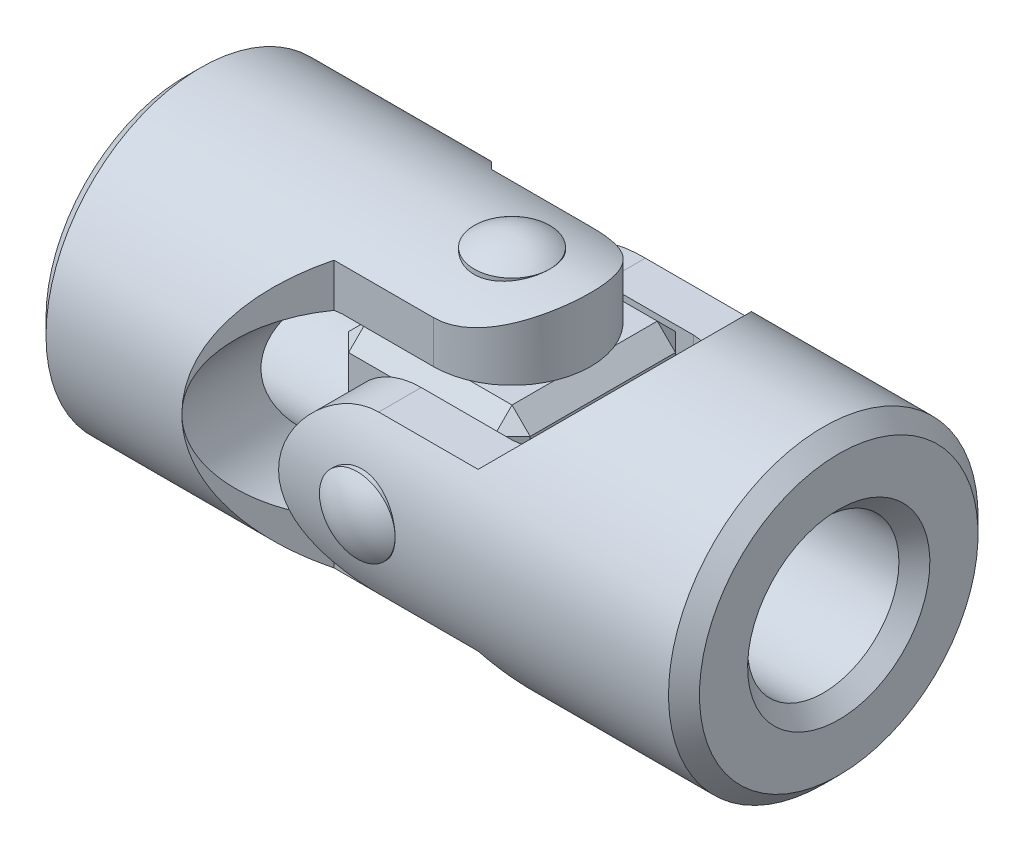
ISO-10303-21;
HEADER;
FILE_DESCRIPTION(('STEP AP214'),'2;1');
FILE_NAME('part.step','',(''),(''),'','','');
FILE_SCHEMA(('AUTOMOTIVE_DESIGN { 1 0 10303 214 1 1 1 1 }'));
ENDSEC;
DATA;
#1=APPLICATION_CONTEXT('core data for automotive mechanical design processes');
#2=APPLICATION_PROTOCOL_DEFINITION('international standard','automotive_design',2000,#1);
#3=PRODUCT_CONTEXT('',#1,'mechanical');
#4=PRODUCT('Part','Part','',(#3));
#5=PRODUCT_RELATED_PRODUCT_CATEGORY('part','',(#4));
#6=PRODUCT_DEFINITION_FORMATION('','',#4);
#7=PRODUCT_DEFINITION_CONTEXT('part definition',#1,'design');
#8=PRODUCT_DEFINITION('design','',#6,#7);
#9=PRODUCT_DEFINITION_SHAPE('','',#8);
#10=(LENGTH_UNIT() NAMED_UNIT(*) SI_UNIT(.MILLI.,.METRE.));
#11=(NAMED_UNIT(*) PLANE_ANGLE_UNIT() SI_UNIT($,.RADIAN.));
#12=(NAMED_UNIT(*) SI_UNIT($,.STERADIAN.) SOLID_ANGLE_UNIT());
#13=UNCERTAINTY_MEASURE_WITH_UNIT(LENGTH_MEASURE(1.E-05),#10,'distance_accuracy_value','');
#14=(GEOMETRIC_REPRESENTATION_CONTEXT(3) GLOBAL_UNCERTAINTY_ASSIGNED_CONTEXT((#13)) GLOBAL_UNIT_ASSIGNED_CONTEXT((#10,
#11,#12)) REPRESENTATION_CONTEXT('',''));
#15=CARTESIAN_POINT('',(0.,0.,0.));
#16=DIRECTION('',(0.,0.,1.));
#17=DIRECTION('',(1.,0.,0.));
#18=AXIS2_PLACEMENT_3D('',#15,#16,#17);
#19=CARTESIAN_POINT('',(0.,22.5,0.));
#20=DIRECTION('',(0.,-1.,0.));
#21=DIRECTION('',(-1.,0.,0.));
#22=AXIS2_PLACEMENT_3D('',#19,#20,#21);
#23=CYLINDRICAL_SURFACE('',#22,5.5);
#24=CARTESIAN_POINT('',(0.,22.5,0.));
#25=DIRECTION('',(0.,1.,0.));
#26=DIRECTION('',(1.,0.,0.));
#27=AXIS2_PLACEMENT_3D('',#24,#25,#26);
#28=CIRCLE('',#27,5.5);
#29=CARTESIAN_POINT('',(-5.5,22.5,0.));
#30=VERTEX_POINT('',#29);
#31=EDGE_CURVE('P0_E10',#30,#30,#28,.T.);
#32=CARTESIAN_POINT('',(0.,-22.5,0.));
#33=DIRECTION('',(0.,-1.,0.));
#34=DIRECTION('',(0.,0.,-1.));
#35=AXIS2_PLACEMENT_3D('',#32,#33,#34);
#36=CIRCLE('',#35,5.5);
#37=CARTESIAN_POINT('',(-5.5,-22.5,0.));
#38=VERTEX_POINT('',#37);
#39=EDGE_CURVE('P0_E20',#38,#38,#36,.T.);
#40=CARTESIAN_POINT('',(-5.5,22.5,0.));
#41=CARTESIAN_POINT('',(-5.5,22.03125,0.));
#42=CARTESIAN_POINT('',(-5.5,21.5625,0.));
#43=CARTESIAN_POINT('',(-5.5,20.625,0.));
#44=CARTESIAN_POINT('',(-5.5,20.15625,0.));
#45=CARTESIAN_POINT('',(-5.5,19.21875,0.));
#46=CARTESIAN_POINT('',(-5.5,18.75,0.));
#47=CARTESIAN_POINT('',(-5.5,17.8125,0.));
#48=CARTESIAN_POINT('',(-5.5,17.34375,0.));
#49=CARTESIAN_POINT('',(-5.5,16.40625,0.));
#50=CARTESIAN_POINT('',(-5.5,15.9375,0.));
#51=CARTESIAN_POINT('',(-5.5,15.,0.));
#52=CARTESIAN_POINT('',(-5.5,14.53125,0.));
#53=CARTESIAN_POINT('',(-5.5,13.59375,0.));
#54=CARTESIAN_POINT('',(-5.5,13.125,0.));
#55=CARTESIAN_POINT('',(-5.5,12.1875,0.));
#56=CARTESIAN_POINT('',(-5.5,11.71875,0.));
#57=CARTESIAN_POINT('',(-5.5,10.78125,0.));
#58=CARTESIAN_POINT('',(-5.5,10.3125,0.));
#59=CARTESIAN_POINT('',(-5.5,9.375,0.));
#60=CARTESIAN_POINT('',(-5.5,8.90625,0.));
#61=CARTESIAN_POINT('',(-5.5,7.96875,0.));
#62=CARTESIAN_POINT('',(-5.5,7.5,0.));
#63=CARTESIAN_POINT('',(-5.5,6.5625,0.));
#64=CARTESIAN_POINT('',(-5.5,6.09375,0.));
#65=CARTESIAN_POINT('',(-5.5,5.15625,0.));
#66=CARTESIAN_POINT('',(-5.5,4.6875,0.));
#67=CARTESIAN_POINT('',(-5.5,3.75,0.));
#68=CARTESIAN_POINT('',(-5.5,3.28125,0.));
#69=CARTESIAN_POINT('',(-5.5,2.34375,0.));
#70=CARTESIAN_POINT('',(-5.5,1.875,0.));
#71=CARTESIAN_POINT('',(-5.5,0.937500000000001,0.));
#72=CARTESIAN_POINT('',(-5.5,0.46875,0.));
#73=CARTESIAN_POINT('',(-5.5,-0.46875,0.));
#74=CARTESIAN_POINT('',(-5.5,-0.937500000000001,0.));
#75=CARTESIAN_POINT('',(-5.5,-1.875,0.));
#76=CARTESIAN_POINT('',(-5.5,-2.34375,0.));
#77=CARTESIAN_POINT('',(-5.5,-3.28125,0.));
#78=CARTESIAN_POINT('',(-5.5,-3.75,0.));
#79=CARTESIAN_POINT('',(-5.5,-4.6875,0.));
#80=CARTESIAN_POINT('',(-5.5,-5.15625,0.));
#81=CARTESIAN_POINT('',(-5.5,-6.09375,0.));
#82=CARTESIAN_POINT('',(-5.5,-6.5625,0.));
#83=CARTESIAN_POINT('',(-5.5,-7.5,0.));
#84=CARTESIAN_POINT('',(-5.5,-7.96875,0.));
#85=CARTESIAN_POINT('',(-5.5,-8.90625,0.));
#86=CARTESIAN_POINT('',(-5.5,-9.37499999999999,0.));
#87=CARTESIAN_POINT('',(-5.5,-10.3125,0.));
#88=CARTESIAN_POINT('',(-5.5,-10.78125,0.));
#89=CARTESIAN_POINT('',(-5.5,-11.71875,0.));
#90=CARTESIAN_POINT('',(-5.5,-12.1875,0.));
#91=CARTESIAN_POINT('',(-5.5,-13.125,0.));
#92=CARTESIAN_POINT('',(-5.5,-13.59375,0.));
#93=CARTESIAN_POINT('',(-5.5,-14.53125,0.));
#94=CARTESIAN_POINT('',(-5.5,-15.,0.));
#95=CARTESIAN_POINT('',(-5.5,-15.9375,0.));
#96=CARTESIAN_POINT('',(-5.5,-16.40625,0.));
#97=CARTESIAN_POINT('',(-5.5,-17.34375,0.));
#98=CARTESIAN_POINT('',(-5.5,-17.8125,0.));
#99=CARTESIAN_POINT('',(-5.5,-18.75,0.));
#100=CARTESIAN_POINT('',(-5.5,-19.21875,0.));
#101=CARTESIAN_POINT('',(-5.5,-20.15625,0.));
#102=CARTESIAN_POINT('',(-5.5,-20.625,0.));
#103=CARTESIAN_POINT('',(-5.5,-21.5625,0.));
#104=CARTESIAN_POINT('',(-5.5,-22.03125,0.));
#105=CARTESIAN_POINT('',(-5.5,-22.5,0.));
#106=B_SPLINE_CURVE_WITH_KNOTS('',3,(#40,#41,#42,#43,#44,#45,#46,#47,#48,#49,#50,#51,#52,#53,
#54,#55,#56,#57,#58,#59,#60,#61,#62,#63,#64,#65,#66,#67,#68,#69,#70,#71,#72,#73,#74,#75,#76,#77,
#78,#79,#80,#81,#82,#83,#84,#85,#86,#87,#88,#89,#90,#91,#92,#93,#94,#95,#96,#97,#98,#99,#100,
#101,#102,#103,#104,#105),.UNSPECIFIED.,.F.,.F.,(4,2,2,2,2,2,2,2,2,2,2,2,2,2,2,2,2,2,2,2,2,2,2,
2,2,2,2,2,2,2,2,2,4),(0.,1.40625,2.8125,4.21875,5.625,7.03125,8.4375,9.84375,11.25,12.65625,
14.0625,15.46875,16.875,18.28125,19.6875,21.09375,22.5,23.90625,25.3125,26.71875,28.125,
29.53125,30.9375,32.34375,33.75,35.15625,36.5625,37.96875,39.375,40.78125,42.1875,43.59375,45.),.UNSPECIFIED.);
#107=EDGE_CURVE('P0_BSEAM14',#30,#38,#106,.T.);
#108=ORIENTED_EDGE('',*,*,#31,.F.);
#109=ORIENTED_EDGE('',*,*,#39,.F.);
#110=ORIENTED_EDGE('',*,*,#107,.T.);
#111=ORIENTED_EDGE('',*,*,#107,.F.);
#112=EDGE_LOOP('',(#108,#110,#109,#111));
#113=FACE_BOUND('',#112,.T.);
#114=ADVANCED_FACE('P0_F14',(#113),#23,.T.);
#115=CARTESIAN_POINT('',(0.,14.9972222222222,0.));
#116=DIRECTION('',(0.,-1.,0.));
#117=DIRECTION('',(0.,0.,-1.));
#118=AXIS2_PLACEMENT_3D('',#115,#116,#117);
#119=SPHERICAL_SURFACE('',#118,9.30277777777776);
#120=ORIENTED_EDGE('',*,*,#31,.T.);
#121=EDGE_LOOP('',(#120));
#122=FACE_BOUND('',#121,.T.);
#123=ADVANCED_FACE('P0_F29',(#122),#119,.T.);
#124=CARTESIAN_POINT('',(0.,-14.9972222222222,0.));
#125=DIRECTION('',(0.,1.,0.));
#126=DIRECTION('',(0.,0.,-1.));
#127=AXIS2_PLACEMENT_3D('',#124,#125,#126);
#128=SPHERICAL_SURFACE('',#127,9.30277777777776);
#129=ORIENTED_EDGE('',*,*,#39,.T.);
#130=EDGE_LOOP('',(#129));
#131=FACE_BOUND('',#130,.T.);
#132=ADVANCED_FACE('P0_F26',(#131),#128,.T.);
#133=CLOSED_SHELL('',(#114,#123,#132));
#134=MANIFOLD_SOLID_BREP('P0_B1',#133);
#135=CARTESIAN_POINT('',(0.,0.,22.5));
#136=DIRECTION('',(0.,0.,-1.));
#137=DIRECTION('',(-1.,0.,0.));
#138=AXIS2_PLACEMENT_3D('',#135,#136,#137);
#139=CYLINDRICAL_SURFACE('',#138,5.5);
#140=CARTESIAN_POINT('',(0.,0.,22.5));
#141=DIRECTION('',(0.,0.,1.));
#142=DIRECTION('',(1.,0.,0.));
#143=AXIS2_PLACEMENT_3D('',#140,#141,#142);
#144=CIRCLE('',#143,5.5);
#145=CARTESIAN_POINT('',(-5.5,0.,22.5));
#146=VERTEX_POINT('',#145);
#147=EDGE_CURVE('P1_E10',#146,#146,#144,.T.);
#148=CARTESIAN_POINT('',(0.,0.,-22.5));
#149=DIRECTION('',(0.,0.,-1.));
#150=DIRECTION('',(0.,1.,0.));
#151=AXIS2_PLACEMENT_3D('',#148,#149,#150);
#152=CIRCLE('',#151,5.5);
#153=CARTESIAN_POINT('',(-5.5,0.,-22.5));
#154=VERTEX_POINT('',#153);
#155=EDGE_CURVE('P1_E20',#154,#154,#152,.T.);
#156=CARTESIAN_POINT('',(-5.5,0.,22.5));
#157=CARTESIAN_POINT('',(-5.5,0.,22.03125));
#158=CARTESIAN_POINT('',(-5.5,0.,21.5625));
#159=CARTESIAN_POINT('',(-5.5,0.,20.625));
#160=CARTESIAN_POINT('',(-5.5,0.,20.15625));
#161=CARTESIAN_POINT('',(-5.5,0.,19.21875));
#162=CARTESIAN_POINT('',(-5.5,0.,18.75));
#163=CARTESIAN_POINT('',(-5.5,0.,17.8125));
#164=CARTESIAN_POINT('',(-5.5,0.,17.34375));
#165=CARTESIAN_POINT('',(-5.5,0.,16.40625));
#166=CARTESIAN_POINT('',(-5.5,0.,15.9375));
#167=CARTESIAN_POINT('',(-5.5,0.,15.));
#168=CARTESIAN_POINT('',(-5.5,0.,14.53125));
#169=CARTESIAN_POINT('',(-5.5,0.,13.59375));
#170=CARTESIAN_POINT('',(-5.5,0.,13.125));
#171=CARTESIAN_POINT('',(-5.5,0.,12.1875));
#172=CARTESIAN_POINT('',(-5.5,0.,11.71875));
#173=CARTESIAN_POINT('',(-5.5,0.,10.78125));
#174=CARTESIAN_POINT('',(-5.5,0.,10.3125));
#175=CARTESIAN_POINT('',(-5.5,0.,9.375));
#176=CARTESIAN_POINT('',(-5.5,0.,8.90625));
#177=CARTESIAN_POINT('',(-5.5,0.,7.96875));
#178=CARTESIAN_POINT('',(-5.5,0.,7.5));
#179=CARTESIAN_POINT('',(-5.5,0.,6.5625));
#180=CARTESIAN_POINT('',(-5.5,0.,6.09375));
#181=CARTESIAN_POINT('',(-5.5,0.,5.15625));
#182=CARTESIAN_POINT('',(-5.5,0.,4.6875));
#183=CARTESIAN_POINT('',(-5.5,0.,3.75));
#184=CARTESIAN_POINT('',(-5.5,0.,3.28125));
#185=CARTESIAN_POINT('',(-5.5,0.,2.34375));
#186=CARTESIAN_POINT('',(-5.5,0.,1.875));
#187=CARTESIAN_POINT('',(-5.5,0.,0.937500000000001));
#188=CARTESIAN_POINT('',(-5.5,0.,0.46875));
#189=CARTESIAN_POINT('',(-5.5,0.,-0.46875));
#190=CARTESIAN_POINT('',(-5.5,0.,-0.937500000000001));
#191=CARTESIAN_POINT('',(-5.5,0.,-1.875));
#192=CARTESIAN_POINT('',(-5.5,0.,-2.34375));
#193=CARTESIAN_POINT('',(-5.5,0.,-3.28125));
#194=CARTESIAN_POINT('',(-5.5,0.,-3.75));
#195=CARTESIAN_POINT('',(-5.5,0.,-4.6875));
#196=CARTESIAN_POINT('',(-5.5,0.,-5.15625));
#197=CARTESIAN_POINT('',(-5.5,0.,-6.09375));
#198=CARTESIAN_POINT('',(-5.5,0.,-6.5625));
#199=CARTESIAN_POINT('',(-5.5,0.,-7.5));
#200=CARTESIAN_POINT('',(-5.5,0.,-7.96875));
#201=CARTESIAN_POINT('',(-5.5,0.,-8.90625));
#202=CARTESIAN_POINT('',(-5.5,0.,-9.37499999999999));
#203=CARTESIAN_POINT('',(-5.5,0.,-10.3125));
#204=CARTESIAN_POINT('',(-5.5,0.,-10.78125));
#205=CARTESIAN_POINT('',(-5.5,0.,-11.71875));
#206=CARTESIAN_POINT('',(-5.5,0.,-12.1875));
#207=CARTESIAN_POINT('',(-5.5,0.,-13.125));
#208=CARTESIAN_POINT('',(-5.5,0.,-13.59375));
#209=CARTESIAN_POINT('',(-5.5,0.,-14.53125));
#210=CARTESIAN_POINT('',(-5.5,0.,-15.));
#211=CARTESIAN_POINT('',(-5.5,0.,-15.9375));
#212=CARTESIAN_POINT('',(-5.5,0.,-16.40625));
#213=CARTESIAN_POINT('',(-5.5,0.,-17.34375));
#214=CARTESIAN_POINT('',(-5.5,0.,-17.8125));
#215=CARTESIAN_POINT('',(-5.5,0.,-18.75));
#216=CARTESIAN_POINT('',(-5.5,0.,-19.21875));
#217=CARTESIAN_POINT('',(-5.5,0.,-20.15625));
#218=CARTESIAN_POINT('',(-5.5,0.,-20.625));
#219=CARTESIAN_POINT('',(-5.5,0.,-21.5625));
#220=CARTESIAN_POINT('',(-5.5,0.,-22.03125));
#221=CARTESIAN_POINT('',(-5.5,0.,-22.5));
#222=B_SPLINE_CURVE_WITH_KNOTS('',3,(#156,#157,#158,#159,#160,#161,#162,#163,#164,#165,#166,
#167,#168,#169,#170,#171,#172,#173,#174,#175,#176,#177,#178,#179,#180,#181,#182,#183,#184,#185,
#186,#187,#188,#189,#190,#191,#192,#193,#194,#195,#196,#197,#198,#199,#200,#201,#202,#203,#204,
#205,#206,#207,#208,#209,#210,#211,#212,#213,#214,#215,#216,#217,#218,#219,#220,#221),
.UNSPECIFIED.,.F.,.F.,(4,2,2,2,2,2,2,2,2,2,2,2,2,2,2,2,2,2,2,2,2,2,2,2,2,2,2,2,2,2,2,2,4),(0.,
1.40625,2.8125,4.21875,5.625,7.03125,8.4375,9.84375,11.25,12.65625,14.0625,15.46875,16.875,
18.28125,19.6875,21.09375,22.5,23.90625,25.3125,26.71875,28.125,29.53125,30.9375,32.34375,33.75,
35.15625,36.5625,37.96875,39.375,40.78125,42.1875,43.59375,45.),.UNSPECIFIED.);
#223=EDGE_CURVE('P1_BSEAM14',#146,#154,#222,.T.);
#224=ORIENTED_EDGE('',*,*,#147,.F.);
#225=ORIENTED_EDGE('',*,*,#155,.F.);
#226=ORIENTED_EDGE('',*,*,#223,.T.);
#227=ORIENTED_EDGE('',*,*,#223,.F.);
#228=EDGE_LOOP('',(#224,#226,#225,#227));
#229=FACE_BOUND('',#228,.T.);
#230=ADVANCED_FACE('P1_F14',(#229),#139,.T.);
#231=CARTESIAN_POINT('',(0.,0.,14.9972222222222));
#232=DIRECTION('',(0.,0.,-1.));
#233=DIRECTION('',(0.,1.,0.));
#234=AXIS2_PLACEMENT_3D('',#231,#232,#233);
#235=SPHERICAL_SURFACE('',#234,9.30277777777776);
#236=ORIENTED_EDGE('',*,*,#147,.T.);
#237=EDGE_LOOP('',(#236));
#238=FACE_BOUND('',#237,.T.);
#239=ADVANCED_FACE('P1_F29',(#238),#235,.T.);
#240=CARTESIAN_POINT('',(0.,0.,-14.9972222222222));
#241=DIRECTION('',(0.,0.,1.));
#242=DIRECTION('',(0.,1.,0.));
#243=AXIS2_PLACEMENT_3D('',#240,#241,#242);
#244=SPHERICAL_SURFACE('',#243,9.30277777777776);
#245=ORIENTED_EDGE('',*,*,#155,.T.);
#246=EDGE_LOOP('',(#245));
#247=FACE_BOUND('',#246,.T.);
#248=ADVANCED_FACE('P1_F26',(#247),#244,.T.);
#249=CLOSED_SHELL('',(#230,#239,#248));
#250=MANIFOLD_SOLID_BREP('P1_B1',#249);
#251=CARTESIAN_POINT('',(0.,-22.5,-11.44));
#252=DIRECTION('',(0.,0.,1.));
#253=DIRECTION('',(1.,0.,0.));
#254=AXIS2_PLACEMENT_3D('',#251,#252,#253);
#255=PLANE('',#254);
#256=DIRECTION('',(0.,1.,0.));
#257=VECTOR('',#256,1.);
#258=CARTESIAN_POINT('',(0.,-22.5,-11.44));
#259=LINE('',#258,#257);
#260=CARTESIAN_POINT('',(0.,13.2,-11.44));
#261=VERTEX_POINT('',#260);
#262=CARTESIAN_POINT('',(0.,19.3746328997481,-11.44));
#263=VERTEX_POINT('',#262);
#264=EDGE_CURVE('P2_E282',#261,#263,#259,.T.);
#265=ORIENTED_EDGE('',*,*,#264,.F.);
#266=DIRECTION('',(-1.,0.,0.));
#267=VECTOR('',#266,1.);
#268=CARTESIAN_POINT('',(0.,13.2,-11.44));
#269=LINE('',#268,#267);
#270=CARTESIAN_POINT('',(-13.2,13.2,-11.44));
#271=VERTEX_POINT('',#270);
#272=EDGE_CURVE('P2_E132',#261,#271,#269,.T.);
#273=ORIENTED_EDGE('',*,*,#272,.T.);
#274=CARTESIAN_POINT('',(-12.2670731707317,0.,-11.44));
#275=DIRECTION('',(0.,0.,1.));
#276=DIRECTION('',(1.,0.,0.));
#277=AXIS2_PLACEMENT_3D('',#274,#275,#276);
#278=CIRCLE('',#277,13.2329268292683);
#279=CARTESIAN_POINT('',(-14.44,13.0533038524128,-11.44));
#280=VERTEX_POINT('',#279);
#281=EDGE_CURVE('P2_E146',#271,#280,#278,.T.);
#282=ORIENTED_EDGE('',*,*,#281,.T.);
#283=DIRECTION('',(0.,1.,0.));
#284=VECTOR('',#283,1.);
#285=CARTESIAN_POINT('',(-14.44,-22.5,-11.44));
#286=LINE('',#285,#284);
#287=CARTESIAN_POINT('',(-14.44,19.3746328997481,-11.44));
#288=VERTEX_POINT('',#287);
#289=EDGE_CURVE('P2_E289',#280,#288,#286,.T.);
#290=ORIENTED_EDGE('',*,*,#289,.T.);
#291=DIRECTION('',(1.,0.,0.));
#292=VECTOR('',#291,1.);
#293=CARTESIAN_POINT('',(-47.5,19.3746328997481,-11.44));
#294=LINE('',#293,#292);
#295=EDGE_CURVE('P2_E227',#263,#288,#294,.F.);
#296=ORIENTED_EDGE('',*,*,#295,.F.);
#297=EDGE_LOOP('',(#265,#273,#282,#290,#296));
#298=FACE_BOUND('',#297,.T.);
#299=ADVANCED_FACE('P2_F16',(#298),#255,.F.);
#300=CARTESIAN_POINT('',(-14.44,-22.5,-11.44));
#301=DIRECTION('',(-0.707106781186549,0.,0.707106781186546));
#302=DIRECTION('',(0.707106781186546,0.,0.707106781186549));
#303=AXIS2_PLACEMENT_3D('',#300,#301,#302);
#304=PLANE('',#303);
#305=CARTESIAN_POINT('',(-3.00000000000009,0.,0.));
#306=DIRECTION('',(-0.707106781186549,0.,0.707106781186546));
#307=DIRECTION('',(0.707106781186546,0.,0.707106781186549));
#308=AXIS2_PLACEMENT_3D('',#305,#306,#307);
#309=ELLIPSE('',#308,31.8198051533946,22.5);
#310=CARTESIAN_POINT('',(-25.5,0.,-22.5));
#311=VERTEX_POINT('',#310);
#312=CARTESIAN_POINT('',(-14.44,-19.3746328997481,-11.44));
#313=VERTEX_POINT('',#312);
#314=EDGE_CURVE('P2_E230',#311,#313,#309,.T.);
#315=ORIENTED_EDGE('',*,*,#314,.F.);
#316=CARTESIAN_POINT('',(-12.2670731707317,0.,-9.26707317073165));
#317=DIRECTION('',(-0.707106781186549,0.,0.707106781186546));
#318=DIRECTION('',(-0.707106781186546,0.,-0.707106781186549));
#319=AXIS2_PLACEMENT_3D('',#316,#317,#318);
#320=ELLIPSE('',#319,18.7141845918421,13.2329268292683);
#321=CARTESIAN_POINT('',(-14.44,-13.0533038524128,-11.44));
#322=VERTEX_POINT('',#321);
#323=EDGE_CURVE('P2_E143',#311,#322,#320,.T.);
#324=ORIENTED_EDGE('',*,*,#323,.T.);
#325=EDGE_CURVE('P2_E286',#313,#322,#286,.T.);
#326=ORIENTED_EDGE('',*,*,#325,.F.);
#327=EDGE_LOOP('',(#315,#324,#326));
#328=FACE_BOUND('',#327,.T.);
#329=ADVANCED_FACE('P2_F181',(#328),#304,.F.);
#330=CARTESIAN_POINT('',(-14.44,-22.5,11.44));
#331=DIRECTION('',(-0.707106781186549,0.,-0.707106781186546));
#332=DIRECTION('',(-0.707106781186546,0.,0.707106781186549));
#333=AXIS2_PLACEMENT_3D('',#330,#331,#332);
#334=PLANE('',#333);
#335=DIRECTION('',(0.,1.,0.));
#336=VECTOR('',#335,1.);
#337=CARTESIAN_POINT('',(-14.44,-22.5,11.44));
#338=LINE('',#337,#336);
#339=CARTESIAN_POINT('',(-14.44,-19.3746328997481,11.44));
#340=VERTEX_POINT('',#339);
#341=CARTESIAN_POINT('',(-14.44,-13.0533038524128,11.44));
#342=VERTEX_POINT('',#341);
#343=EDGE_CURVE('P2_E39',#340,#342,#338,.T.);
#344=ORIENTED_EDGE('',*,*,#343,.T.);
#345=CARTESIAN_POINT('',(-12.2670731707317,0.,9.26707317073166));
#346=DIRECTION('',(-0.707106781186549,0.,-0.707106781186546));
#347=DIRECTION('',(0.707106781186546,0.,-0.707106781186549));
#348=AXIS2_PLACEMENT_3D('',#345,#346,#347);
#349=ELLIPSE('',#348,18.7141845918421,13.2329268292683);
#350=CARTESIAN_POINT('',(-25.5,0.,22.5));
#351=VERTEX_POINT('',#350);
#352=EDGE_CURVE('P2_E107',#342,#351,#349,.T.);
#353=ORIENTED_EDGE('',*,*,#352,.T.);
#354=CARTESIAN_POINT('',(-3.00000000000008,0.,0.));
#355=DIRECTION('',(-0.707106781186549,0.,-0.707106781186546));
#356=DIRECTION('',(0.707106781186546,0.,-0.707106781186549));
#357=AXIS2_PLACEMENT_3D('',#354,#355,#356);
#358=ELLIPSE('',#357,31.8198051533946,22.5);
#359=EDGE_CURVE('P2_E241',#340,#351,#358,.T.);
#360=ORIENTED_EDGE('',*,*,#359,.F.);
#361=EDGE_LOOP('',(#344,#353,#360));
#362=FACE_BOUND('',#361,.T.);
#363=ADVANCED_FACE('P2_F185',(#362),#334,.F.);
#364=CARTESIAN_POINT('',(0.,-22.5,11.44));
#365=DIRECTION('',(0.,0.,-1.));
#366=DIRECTION('',(-1.,0.,0.));
#367=AXIS2_PLACEMENT_3D('',#364,#365,#366);
#368=PLANE('',#367);
#369=CARTESIAN_POINT('',(-12.2670731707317,0.,11.44));
#370=DIRECTION('',(0.,0.,-1.));
#371=DIRECTION('',(-1.,0.,0.));
#372=AXIS2_PLACEMENT_3D('',#369,#370,#371);
#373=CIRCLE('',#372,13.2329268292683);
#374=CARTESIAN_POINT('',(-14.44,13.0533038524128,11.44));
#375=VERTEX_POINT('',#374);
#376=CARTESIAN_POINT('',(-13.2,13.2,11.44));
#377=VERTEX_POINT('',#376);
#378=EDGE_CURVE('P2_E108',#375,#377,#373,.T.);
#379=ORIENTED_EDGE('',*,*,#378,.T.);
#380=DIRECTION('',(1.,0.,0.));
#381=VECTOR('',#380,1.);
#382=CARTESIAN_POINT('',(0.,13.2,11.44));
#383=LINE('',#382,#381);
#384=CARTESIAN_POINT('',(0.,13.2,11.44));
#385=VERTEX_POINT('',#384);
#386=EDGE_CURVE('P2_E129',#377,#385,#383,.T.);
#387=ORIENTED_EDGE('',*,*,#386,.T.);
#388=DIRECTION('',(0.,1.,0.));
#389=VECTOR('',#388,1.);
#390=CARTESIAN_POINT('',(0.,-22.5,11.44));
#391=LINE('',#390,#389);
#392=CARTESIAN_POINT('',(0.,19.3746328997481,11.44));
#393=VERTEX_POINT('',#392);
#394=EDGE_CURVE('P2_E154',#385,#393,#391,.T.);
#395=ORIENTED_EDGE('',*,*,#394,.T.);
#396=DIRECTION('',(1.,0.,0.));
#397=VECTOR('',#396,1.);
#398=CARTESIAN_POINT('',(-47.5,19.3746328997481,11.44));
#399=LINE('',#398,#397);
#400=CARTESIAN_POINT('',(-14.44,19.3746328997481,11.44));
#401=VERTEX_POINT('',#400);
#402=EDGE_CURVE('P2_E244',#401,#393,#399,.T.);
#403=ORIENTED_EDGE('',*,*,#402,.F.);
#404=EDGE_CURVE('P2_E292',#375,#401,#338,.T.);
#405=ORIENTED_EDGE('',*,*,#404,.F.);
#406=EDGE_LOOP('',(#379,#387,#395,#403,#405));
#407=FACE_BOUND('',#406,.T.);
#408=ADVANCED_FACE('P2_F188',(#407),#368,.F.);
#409=CARTESIAN_POINT('',(0.,-22.5,0.));
#410=DIRECTION('',(0.,1.,0.));
#411=DIRECTION('',(0.,0.,-1.));
#412=AXIS2_PLACEMENT_3D('',#409,#410,#411);
#413=CYLINDRICAL_SURFACE('',#412,11.44);
#414=ORIENTED_EDGE('',*,*,#394,.F.);
#415=CARTESIAN_POINT('',(0.,13.2,0.));
#416=DIRECTION('',(0.,1.,0.));
#417=DIRECTION('',(1.,0.,0.));
#418=AXIS2_PLACEMENT_3D('',#415,#416,#417);
#419=CIRCLE('',#418,11.44);
#420=EDGE_CURVE('P2_E109',#385,#261,#419,.T.);
#421=ORIENTED_EDGE('',*,*,#420,.T.);
#422=ORIENTED_EDGE('',*,*,#264,.T.);
#423=CARTESIAN_POINT('',(0.,19.3746328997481,11.44));
#424=CARTESIAN_POINT('',(0.149411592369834,19.3746293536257,11.4400011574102));
#425=CARTESIAN_POINT('',(0.298801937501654,19.3763619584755,11.4370722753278));
#426=CARTESIAN_POINT('',(0.597267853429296,19.3832631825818,11.4253742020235));
#427=CARTESIAN_POINT('',(0.746343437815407,19.388431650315,11.4166052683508));
#428=CARTESIAN_POINT('',(1.1924492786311,19.4090246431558,11.3815880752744));
#429=CARTESIAN_POINT('',(1.48862079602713,19.429536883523,11.3466293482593));
#430=CARTESIAN_POINT('',(2.07440354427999,19.4831954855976,11.2542392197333));
#431=CARTESIAN_POINT('',(2.36404318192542,19.516266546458,11.1969417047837));
#432=CARTESIAN_POINT('',(2.93661276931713,19.5938670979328,11.0605839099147));
#433=CARTESIAN_POINT('',(3.21954190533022,19.6383979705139,10.9815210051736));
#434=CARTESIAN_POINT('',(3.77625155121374,19.7373144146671,10.8027227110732));
#435=CARTESIAN_POINT('',(4.05005163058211,19.7916770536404,10.7030353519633));
#436=CARTESIAN_POINT('',(4.58773817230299,19.9086631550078,10.4838234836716));
#437=CARTESIAN_POINT('',(4.85162477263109,19.9712865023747,10.3642992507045));
#438=CARTESIAN_POINT('',(5.36863184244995,20.103134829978,10.1061857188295));
#439=CARTESIAN_POINT('',(5.62173738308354,20.1723685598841,9.96757104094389));
#440=CARTESIAN_POINT('',(6.11586617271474,20.3156165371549,9.67226253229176));
#441=CARTESIAN_POINT('',(6.35688492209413,20.3896325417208,9.51556203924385));
#442=CARTESIAN_POINT('',(6.84568399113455,20.5470633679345,9.17098827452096));
#443=CARTESIAN_POINT('',(7.09231147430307,20.6307435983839,8.98159933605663));
#444=CARTESIAN_POINT('',(7.56908602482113,20.7994649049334,8.5836454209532));
#445=CARTESIAN_POINT('',(7.79923222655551,20.8845060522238,8.37507943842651));
#446=CARTESIAN_POINT('',(8.24205132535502,21.0538818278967,7.9396875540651));
#447=CARTESIAN_POINT('',(8.45471665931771,21.1382161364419,7.71285383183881));
#448=CARTESIAN_POINT('',(8.86126323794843,21.3040830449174,7.24211992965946));
#449=CARTESIAN_POINT('',(9.05515074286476,21.3856165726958,6.99822548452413));
#450=CARTESIAN_POINT('',(9.43606290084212,21.5495722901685,6.47656219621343));
#451=CARTESIAN_POINT('',(9.62163085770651,21.6316490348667,6.19761758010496));
#452=CARTESIAN_POINT('',(9.96841647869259,21.7881109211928,5.62289194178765));
#453=CARTESIAN_POINT('',(10.129632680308,21.8624956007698,5.32710990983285));
#454=CARTESIAN_POINT('',(10.4260351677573,22.0013970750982,4.72072166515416));
#455=CARTESIAN_POINT('',(10.5612342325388,22.0659187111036,4.41012282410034));
#456=CARTESIAN_POINT('',(10.8041217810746,22.1831946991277,3.77620494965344));
#457=CARTESIAN_POINT('',(10.9118133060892,22.2359503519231,3.45288732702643));
#458=CARTESIAN_POINT('',(11.0914492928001,22.324672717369,2.82018662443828));
#459=CARTESIAN_POINT('',(11.1654325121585,22.3615852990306,2.5115144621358));
#460=CARTESIAN_POINT('',(11.2876245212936,22.4228469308,1.88787525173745));
#461=CARTESIAN_POINT('',(11.3358344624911,22.4471965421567,1.57290848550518));
#462=CARTESIAN_POINT('',(11.4058091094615,22.482614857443,0.939470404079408));
#463=CARTESIAN_POINT('',(11.4275873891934,22.4936903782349,0.621000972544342));
#464=CARTESIAN_POINT('',(11.4444340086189,22.5022534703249,-0.016817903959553));
#465=CARTESIAN_POINT('',(11.4395040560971,22.4997419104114,-0.336167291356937));
#466=CARTESIAN_POINT('',(11.4046576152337,22.4820468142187,-0.944260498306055));
#467=CARTESIAN_POINT('',(11.377029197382,22.4680237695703,-1.23317276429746));
#468=CARTESIAN_POINT('',(11.3000462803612,22.4291404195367,-1.80732847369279));
#469=CARTESIAN_POINT('',(11.2506933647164,22.4042809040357,-2.09257218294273));
#470=CARTESIAN_POINT('',(11.1308063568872,22.344318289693,-2.65746678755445));
#471=CARTESIAN_POINT('',(11.0602719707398,22.3092150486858,-2.93711760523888));
#472=CARTESIAN_POINT('',(10.8987475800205,22.2295785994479,-3.48906791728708));
#473=CARTESIAN_POINT('',(10.8077568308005,22.1850450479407,-3.76136714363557));
#474=CARTESIAN_POINT('',(10.6048454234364,22.086900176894,-4.30057301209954));
#475=CARTESIAN_POINT('',(10.4926645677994,22.0331768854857,-4.56736117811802));
#476=CARTESIAN_POINT('',(10.2491067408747,21.9182357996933,-5.09045032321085));
#477=CARTESIAN_POINT('',(10.1177229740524,21.8570153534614,-5.3467475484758));
#478=CARTESIAN_POINT('',(9.83679699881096,21.7284004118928,-5.84751583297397));
#479=CARTESIAN_POINT('',(9.68725680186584,21.6610066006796,-6.09198819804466));
#480=CARTESIAN_POINT('',(9.37091957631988,21.5213935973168,-6.56819794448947));
#481=CARTESIAN_POINT('',(9.20411473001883,21.4491722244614,-6.79992948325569));
#482=CARTESIAN_POINT('',(8.83733202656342,21.2942385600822,-7.27136596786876));
#483=CARTESIAN_POINT('',(8.63570620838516,21.2111867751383,-7.50967882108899));
#484=CARTESIAN_POINT('',(8.21406872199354,21.0430498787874,-7.96867654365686));
#485=CARTESIAN_POINT('',(7.99405596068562,20.9579646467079,-8.18936036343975));
#486=CARTESIAN_POINT('',(7.53657008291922,20.7877650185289,-8.61224833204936));
#487=CARTESIAN_POINT('',(7.29908242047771,20.702650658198,-8.81443676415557));
#488=CARTESIAN_POINT('',(6.80786893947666,20.5346101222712,-9.19912266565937));
#489=CARTESIAN_POINT('',(6.55414057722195,20.4516842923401,-9.38161703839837));
#490=CARTESIAN_POINT('',(6.01371351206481,20.2847400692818,-9.73758534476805));
#491=CARTESIAN_POINT('',(5.72594667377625,20.2010346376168,-9.90958940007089));
#492=CARTESIAN_POINT('',(5.13483647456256,20.0415076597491,-10.2283794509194));
#493=CARTESIAN_POINT('',(4.83150033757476,19.9656825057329,-10.3751770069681));
#494=CARTESIAN_POINT('',(4.21151925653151,19.8247912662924,-10.6419159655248));
#495=CARTESIAN_POINT('',(3.89490042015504,19.7597052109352,-10.7619073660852));
#496=CARTESIAN_POINT('',(3.25010174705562,19.6427903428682,-10.9738545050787));
#497=CARTESIAN_POINT('',(2.92192696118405,19.5909558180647,-11.065822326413));
#498=CARTESIAN_POINT('',(2.37868266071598,19.518986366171,-11.1920645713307));
#499=CARTESIAN_POINT('',(2.16622719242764,19.4941953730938,-11.2351313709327));
#500=CARTESIAN_POINT('',(1.73859217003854,19.4513205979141,-11.3091979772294));
#501=CARTESIAN_POINT('',(1.52341338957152,19.4332349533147,-11.3402011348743));
#502=CARTESIAN_POINT('',(1.0907276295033,19.4041096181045,-11.3899697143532));
#503=CARTESIAN_POINT('',(0.873216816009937,19.3930842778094,-11.4087102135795));
#504=CARTESIAN_POINT('',(0.437141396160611,19.3783309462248,-11.4337362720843));
#505=CARTESIAN_POINT('',(0.218576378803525,19.3746060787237,-11.44001649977));
#506=CARTESIAN_POINT('',(0.,19.3746328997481,-11.44));
#507=B_SPLINE_CURVE_WITH_KNOTS('',3,(#423,#424,#425,#426,#427,#428,#429,#430,#431,#432,#433,
#434,#435,#436,#437,#438,#439,#440,#441,#442,#443,#444,#445,#446,#447,#448,#449,#450,#451,#452,
#453,#454,#455,#456,#457,#458,#459,#460,#461,#462,#463,#464,#465,#466,#467,#468,#469,#470,#471,
#472,#473,#474,#475,#476,#477,#478,#479,#480,#481,#482,#483,#484,#485,#486,#487,#488,#489,#490,
#491,#492,#493,#494,#495,#496,#497,#498,#499,#500,#501,#502,#503,#504,#505,#506),.UNSPECIFIED.,
.F.,.F.,(4,2,2,2,2,2,2,2,2,2,2,2,2,2,2,2,2,2,2,2,2,2,2,2,2,2,2,2,2,2,2,2,2,2,2,2,2,2,2,2,2,4),
(0.,0.448154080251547,0.896288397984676,1.79177343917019,2.68197195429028,3.57227787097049,
4.46053332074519,5.34877640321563,6.23821193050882,7.12797615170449,8.09301064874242,
9.05809579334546,10.0235963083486,10.9887738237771,12.0222554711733,13.0557991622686,
14.0888339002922,15.1217543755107,16.0791110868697,17.0364250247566,17.9932471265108,
18.9500080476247,19.8206845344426,20.6912975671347,21.5619226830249,22.4325794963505,
23.3147184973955,24.1971704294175,25.0795246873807,25.9622802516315,26.9303077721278,
27.8983928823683,28.8672931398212,29.8363455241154,30.871654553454,31.9064874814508,
32.9393738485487,33.9718142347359,34.6259790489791,35.2799620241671,35.9352700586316,
36.59085843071),.UNSPECIFIED.);
#508=EDGE_CURVE('P2_E203',#393,#263,#507,.T.);
#509=ORIENTED_EDGE('',*,*,#508,.F.);
#510=EDGE_LOOP('',(#414,#421,#422,#509));
#511=FACE_BOUND('',#510,.T.);
#512=ADVANCED_FACE('P2_F192',(#511),#413,.T.);
#513=CARTESIAN_POINT('',(-47.5,0.,0.));
#514=DIRECTION('',(-1.,0.,0.));
#515=DIRECTION('',(0.,0.,1.));
#516=AXIS2_PLACEMENT_3D('',#513,#514,#515);
#517=PLANE('',#516);
#518=CARTESIAN_POINT('',(-47.5,0.,0.));
#519=DIRECTION('',(-1.,0.,0.));
#520=DIRECTION('',(0.,0.,1.));
#521=AXIS2_PLACEMENT_3D('',#518,#519,#520);
#522=CIRCLE('',#521,13.25);
#523=CARTESIAN_POINT('',(-47.5,0.,13.25));
#524=VERTEX_POINT('',#523);
#525=EDGE_CURVE('P2_E24',#524,#524,#522,.F.);
#526=ORIENTED_EDGE('',*,*,#525,.T.);
#527=EDGE_LOOP('',(#526));
#528=FACE_BOUND('',#527,.T.);
#529=CARTESIAN_POINT('',(-47.5,0.,0.));
#530=DIRECTION('',(-1.,0.,0.));
#531=DIRECTION('',(0.,0.,1.));
#532=AXIS2_PLACEMENT_3D('',#529,#530,#531);
#533=CIRCLE('',#532,20.25);
#534=CARTESIAN_POINT('',(-47.5,0.,20.25));
#535=VERTEX_POINT('',#534);
#536=EDGE_CURVE('P2_E254',#535,#535,#533,.T.);
#537=ORIENTED_EDGE('',*,*,#536,.T.);
#538=EDGE_LOOP('',(#537));
#539=FACE_BOUND('',#538,.T.);
#540=ADVANCED_FACE('P2_F213',(#528,#539),#517,.T.);
#541=CARTESIAN_POINT('',(-47.5,0.,0.));
#542=DIRECTION('',(1.,0.,0.));
#543=DIRECTION('',(0.,0.,-1.));
#544=AXIS2_PLACEMENT_3D('',#541,#542,#543);
#545=CYLINDRICAL_SURFACE('',#544,22.5);
#546=CARTESIAN_POINT('',(-45.25,0.,0.));
#547=DIRECTION('',(-1.,0.,0.));
#548=DIRECTION('',(0.,0.,1.));
#549=AXIS2_PLACEMENT_3D('',#546,#547,#548);
#550=CIRCLE('',#549,22.5);
#551=CARTESIAN_POINT('',(-45.25,0.,22.5));
#552=VERTEX_POINT('',#551);
#553=EDGE_CURVE('P2_E11',#552,#552,#550,.F.);
#554=ORIENTED_EDGE('',*,*,#553,.T.);
#555=EDGE_LOOP('',(#554));
#556=FACE_BOUND('',#555,.T.);
#557=CARTESIAN_POINT('',(5.5,-22.5,0.));
#558=CARTESIAN_POINT('',(5.50000433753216,-22.5000025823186,-0.152097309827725));
#559=CARTESIAN_POINT('',(5.49368981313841,-22.4984554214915,-0.30414638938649));
#560=CARTESIAN_POINT('',(5.46849436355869,-22.4923156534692,-0.607181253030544));
#561=CARTESIAN_POINT('',(5.44961191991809,-22.4877226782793,-0.75816690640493));
#562=CARTESIAN_POINT('',(5.39942469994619,-22.4756134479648,-1.05798408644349));
#563=CARTESIAN_POINT('',(5.3681157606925,-22.4680962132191,-1.20681487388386));
#564=CARTESIAN_POINT('',(5.2933211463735,-22.4503436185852,-1.50127727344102));
#565=CARTESIAN_POINT('',(5.24983098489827,-22.4401072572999,-1.6469076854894));
#566=CARTESIAN_POINT('',(5.15110300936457,-22.4172157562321,-1.93367496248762));
#567=CARTESIAN_POINT('',(5.09588368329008,-22.4045644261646,-2.07481850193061));
#568=CARTESIAN_POINT('',(4.97405701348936,-22.377169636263,-2.35195169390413));
#569=CARTESIAN_POINT('',(4.90744546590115,-22.3624254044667,-2.48793942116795));
#570=CARTESIAN_POINT('',(4.76336356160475,-22.3312491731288,-2.75376380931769));
#571=CARTESIAN_POINT('',(4.68589726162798,-22.3148178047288,-2.88360274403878));
#572=CARTESIAN_POINT('',(4.52059959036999,-22.2806930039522,-3.13639856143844));
#573=CARTESIAN_POINT('',(4.43276432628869,-22.2629990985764,-3.25935283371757));
#574=CARTESIAN_POINT('',(4.24573161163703,-22.2265085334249,-3.49962009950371));
#575=CARTESIAN_POINT('',(4.14636333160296,-22.2076980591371,-3.6167980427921));
#576=CARTESIAN_POINT('',(3.93816601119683,-22.1697693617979,-3.84245026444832));
#577=CARTESIAN_POINT('',(3.82933347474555,-22.1506510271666,-3.95092129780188));
#578=CARTESIAN_POINT('',(3.60298477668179,-22.1126447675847,-4.1583724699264));
#579=CARTESIAN_POINT('',(3.48547086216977,-22.0937567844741,-4.25735504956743));
#580=CARTESIAN_POINT('',(3.24245609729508,-22.0567245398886,-4.44523070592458));
#581=CARTESIAN_POINT('',(3.11695231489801,-22.0385805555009,-4.53412004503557));
#582=CARTESIAN_POINT('',(2.85703221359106,-22.0033141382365,-4.70230314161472));
#583=CARTESIAN_POINT('',(2.72251682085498,-21.9862092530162,-4.78144759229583));
#584=CARTESIAN_POINT('',(2.44702635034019,-21.9537973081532,-4.92812620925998));
#585=CARTESIAN_POINT('',(2.30604885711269,-21.9384909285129,-4.99565598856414));
#586=CARTESIAN_POINT('',(2.01871925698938,-21.9101535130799,-5.11851134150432));
#587=CARTESIAN_POINT('',(1.87236982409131,-21.8971213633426,-5.17384289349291));
#588=CARTESIAN_POINT('',(1.57528681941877,-21.8737175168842,-5.27190570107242));
#589=CARTESIAN_POINT('',(1.4245516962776,-21.863346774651,-5.31463243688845));
#590=CARTESIAN_POINT('',(0.973378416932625,-21.8371020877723,-5.42186239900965));
#591=CARTESIAN_POINT('',(0.668057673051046,-21.8254939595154,-5.467930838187));
#592=CARTESIAN_POINT('',(0.0539874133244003,-21.815328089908,-5.50834589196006));
#593=CARTESIAN_POINT('',(-0.254761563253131,-21.8167683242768,-5.50270052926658));
#594=CARTESIAN_POINT('',(-0.85958649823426,-21.8323063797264,-5.44071211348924));
#595=CARTESIAN_POINT('',(-1.15579046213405,-21.8461111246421,-5.38554285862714));
#596=CARTESIAN_POINT('',(-1.73459444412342,-21.8843625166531,-5.22792382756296));
#597=CARTESIAN_POINT('',(-2.01719352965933,-21.9088098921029,-5.12547081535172));
#598=CARTESIAN_POINT('',(-2.56395682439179,-21.9658630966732,-4.87518266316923));
#599=CARTESIAN_POINT('',(-2.82791549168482,-21.9985458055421,-4.72691671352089));
#600=CARTESIAN_POINT('',(-3.32762947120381,-22.0683435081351,-4.38951165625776));
#601=CARTESIAN_POINT('',(-3.56338003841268,-22.1054592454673,-4.20036568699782));
#602=CARTESIAN_POINT('',(-4.00672149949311,-22.1811798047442,-3.78046315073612));
#603=CARTESIAN_POINT('',(-4.21337145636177,-22.2197976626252,-3.54871427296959));
#604=CARTESIAN_POINT('',(-4.5850483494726,-22.2932587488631,-3.05339212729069));
#605=CARTESIAN_POINT('',(-4.75007412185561,-22.3281018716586,-2.78981796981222));
#606=CARTESIAN_POINT('',(-5.03414226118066,-22.390248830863,-2.23702105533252));
#607=CARTESIAN_POINT('',(-5.15303733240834,-22.4175284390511,-1.94771970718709));
#608=CARTESIAN_POINT('',(-5.340249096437,-22.4612979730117,-1.35242270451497));
#609=CARTESIAN_POINT('',(-5.40857502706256,-22.4777898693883,-1.04643011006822));
#610=CARTESIAN_POINT('',(-5.49128482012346,-22.4978362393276,-0.43448634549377));
#611=CARTESIAN_POINT('',(-5.5069507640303,-22.5016981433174,-0.128718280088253));
#612=CARTESIAN_POINT('',(-5.48740454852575,-22.4969223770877,0.481069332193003));
#613=CARTESIAN_POINT('',(-5.45219675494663,-22.4882857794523,0.785089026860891));
#614=CARTESIAN_POINT('',(-5.33296068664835,-22.4596799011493,1.37833339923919));
#615=CARTESIAN_POINT('',(-5.2496268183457,-22.4398719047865,1.66770612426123));
#616=CARTESIAN_POINT('',(-5.03729303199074,-22.3911521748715,2.2283534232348));
#617=CARTESIAN_POINT('',(-4.90828862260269,-22.3622395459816,2.49962621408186));
#618=CARTESIAN_POINT('',(-4.60575678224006,-22.2977767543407,3.02151193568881));
#619=CARTESIAN_POINT('',(-4.43150469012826,-22.2621213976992,3.27169148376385));
#620=CARTESIAN_POINT('',(-4.0443540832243,-22.1883024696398,3.73971479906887));
#621=CARTESIAN_POINT('',(-3.83144920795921,-22.1501384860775,3.95755323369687));
#622=CARTESIAN_POINT('',(-3.36709955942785,-22.0745048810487,4.35995513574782));
#623=CARTESIAN_POINT('',(-3.11486985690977,-22.0370723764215,4.54362118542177));
#624=CARTESIAN_POINT('',(-2.58239487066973,-21.9681412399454,4.86601082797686));
#625=CARTESIAN_POINT('',(-2.30215084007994,-21.9366423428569,5.00473642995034));
#626=CARTESIAN_POINT('',(-1.72318238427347,-21.8834820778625,5.23228928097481));
#627=CARTESIAN_POINT('',(-1.4245793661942,-21.8617626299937,5.32141188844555));
#628=CARTESIAN_POINT('',(-0.815843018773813,-21.8305649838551,5.4480127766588));
#629=CARTESIAN_POINT('',(-0.50571209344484,-21.8210842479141,5.48550176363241));
#630=CARTESIAN_POINT('',(-0.0436345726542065,-21.8169371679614,5.50192045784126));
#631=CARTESIAN_POINT('',(0.107814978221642,-21.8171651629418,5.50102874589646));
#632=CARTESIAN_POINT('',(0.410072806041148,-21.8207565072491,5.48677323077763));
#633=CARTESIAN_POINT('',(0.560881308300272,-21.8241186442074,5.47341425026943));
#634=CARTESIAN_POINT('',(0.860825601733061,-21.8338846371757,5.43432380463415));
#635=CARTESIAN_POINT('',(1.00996081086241,-21.8402895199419,5.40858816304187));
#636=CARTESIAN_POINT('',(1.30541158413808,-21.8559454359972,5.34497174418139));
#637=CARTESIAN_POINT('',(1.45172812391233,-21.8651954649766,5.30709525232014));
#638=CARTESIAN_POINT('',(1.73983752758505,-21.8862169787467,5.21972332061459));
#639=CARTESIAN_POINT('',(1.88164972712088,-21.8979753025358,5.17028840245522));
#640=CARTESIAN_POINT('',(2.16053690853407,-21.9237005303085,5.06009415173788));
#641=CARTESIAN_POINT('',(2.29761351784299,-21.9376666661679,4.99933875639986));
#642=CARTESIAN_POINT('',(2.56625324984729,-21.9674264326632,4.86690673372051));
#643=CARTESIAN_POINT('',(2.69781388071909,-21.9832208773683,4.79522523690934));
#644=CARTESIAN_POINT('',(2.95448172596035,-22.0161932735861,4.64148787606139));
#645=CARTESIAN_POINT('',(3.07959104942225,-22.0333707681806,4.55943543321));
#646=CARTESIAN_POINT('',(3.32571323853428,-22.0690998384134,4.38327619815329));
#647=CARTESIAN_POINT('',(3.44654160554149,-22.0876752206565,4.28891636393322));
#648=CARTESIAN_POINT('',(3.67982272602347,-22.1252761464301,4.09051866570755));
#649=CARTESIAN_POINT('',(3.792278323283,-22.1443015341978,3.98648411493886));
#650=CARTESIAN_POINT('',(4.00819294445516,-22.1822971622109,3.76932970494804));
#651=CARTESIAN_POINT('',(4.11164661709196,-22.2012673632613,3.65620451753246));
#652=CARTESIAN_POINT('',(4.30875991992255,-22.2386161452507,3.4217015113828));
#653=CARTESIAN_POINT('',(4.40242310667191,-22.2569949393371,3.30032671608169));
#654=CARTESIAN_POINT('',(4.58091137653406,-22.2929803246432,3.04787844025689));
#655=CARTESIAN_POINT('',(4.66555280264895,-22.3105677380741,2.91667226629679));
#656=CARTESIAN_POINT('',(4.82342591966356,-22.3441152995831,2.64743438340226));
#657=CARTESIAN_POINT('',(4.89666180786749,-22.3600760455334,2.50940521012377));
#658=CARTESIAN_POINT('',(5.03117030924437,-22.3899166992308,2.22748717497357));
#659=CARTESIAN_POINT('',(5.09244834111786,-22.4037975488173,2.08360100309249));
#660=CARTESIAN_POINT('',(5.20257737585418,-22.4290871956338,1.79098871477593));
#661=CARTESIAN_POINT('',(5.25143031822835,-22.4404963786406,1.64226335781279));
#662=CARTESIAN_POINT('',(5.36203661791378,-22.4665741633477,1.24966555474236));
#663=CARTESIAN_POINT('',(5.41368555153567,-22.47903232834,1.00271731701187));
#664=CARTESIAN_POINT('',(5.4826624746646,-22.4957428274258,0.503801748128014));
#665=CARTESIAN_POINT('',(5.49999281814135,-22.499995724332,0.25183476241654));
#666=CARTESIAN_POINT('',(5.5,-22.5,0.));
#667=B_SPLINE_CURVE_WITH_KNOTS('',3,(#557,#558,#559,#560,#561,#562,#563,#564,#565,#566,#567,
#568,#569,#570,#571,#572,#573,#574,#575,#576,#577,#578,#579,#580,#581,#582,#583,#584,#585,#586,
#587,#588,#589,#590,#591,#592,#593,#594,#595,#596,#597,#598,#599,#600,#601,#602,#603,#604,#605,
#606,#607,#608,#609,#610,#611,#612,#613,#614,#615,#616,#617,#618,#619,#620,#621,#622,#623,#624,
#625,#626,#627,#628,#629,#630,#631,#632,#633,#634,#635,#636,#637,#638,#639,#640,#641,#642,#643,
#644,#645,#646,#647,#648,#649,#650,#651,#652,#653,#654,#655,#656,#657,#658,#659,#660,#661,#662,
#663,#664,#665,#666),.UNSPECIFIED.,.T.,.F.,(4,2,2,2,2,2,2,2,2,2,2,2,2,2,2,2,2,2,2,2,2,2,2,2,2,2,
2,2,2,2,2,2,2,2,2,2,2,2,2,2,2,2,2,2,2,2,2,2,2,2,2,2,2,2,4),(0.,0.456070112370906,
0.912195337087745,1.36847349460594,1.82491992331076,2.28065215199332,2.7365529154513,
3.19228374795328,3.64818622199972,4.11200605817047,4.57599796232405,5.03987018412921,
5.50391362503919,5.97435931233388,6.44498230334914,6.91537412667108,7.385934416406,
8.30794554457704,9.22981363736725,10.1303925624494,11.031033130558,11.940414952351,
12.849949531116,13.7842362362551,14.7185490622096,15.6558210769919,16.59292183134,
17.5070355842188,18.4210708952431,19.3222359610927,20.2234896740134,21.140178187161,
22.0570176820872,22.9953007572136,23.9335418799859,24.8661348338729,25.7985343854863,
26.252445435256,26.7061809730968,27.1600697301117,27.6137984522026,28.065202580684,
28.5164500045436,28.9678991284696,29.4191997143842,29.8819518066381,30.3445460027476,
30.8074133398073,31.2701119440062,31.7409194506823,32.2115532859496,32.6819733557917,
33.1523199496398,33.9075087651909,34.6626457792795),.UNSPECIFIED.);
#668=CARTESIAN_POINT('',(5.5,-22.5,0.));
#669=VERTEX_POINT('',#668);
#670=EDGE_CURVE('P2_E222',#669,#669,#667,.T.);
#671=ORIENTED_EDGE('',*,*,#670,.T.);
#672=EDGE_LOOP('',(#671));
#673=FACE_BOUND('',#672,.T.);
#674=CARTESIAN_POINT('',(0.,21.8174242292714,-5.5));
#675=CARTESIAN_POINT('',(0.152020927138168,21.8174213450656,-5.5000043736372));
#676=CARTESIAN_POINT('',(0.303993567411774,21.8190158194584,-5.49369611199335));
#677=CARTESIAN_POINT('',(0.606873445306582,21.8253386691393,-5.46852634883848));
#678=CARTESIAN_POINT('',(0.757780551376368,21.8300674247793,-5.44966332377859));
#679=CARTESIAN_POINT('',(1.05743914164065,21.8425214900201,-5.39952915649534));
#680=CARTESIAN_POINT('',(1.20618986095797,21.8502478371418,-5.36825371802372));
#681=CARTESIAN_POINT('',(1.50049029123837,21.8684680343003,-5.29354174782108));
#682=CARTESIAN_POINT('',(1.64603879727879,21.8789629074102,-5.25010072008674));
#683=CARTESIAN_POINT('',(1.93263167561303,21.9023902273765,-5.15149135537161));
#684=CARTESIAN_POINT('',(2.07368308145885,21.9153186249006,-5.09634248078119));
#685=CARTESIAN_POINT('',(2.35063954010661,21.9432567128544,-4.97467382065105));
#686=CARTESIAN_POINT('',(2.48654266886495,21.9582671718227,-4.90814983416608));
#687=CARTESIAN_POINT('',(2.75221225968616,21.9899358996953,-4.76425662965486));
#688=CARTESIAN_POINT('',(2.88198094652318,22.0065935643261,-4.68689138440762));
#689=CARTESIAN_POINT('',(3.13465464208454,22.0411067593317,-4.5218053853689));
#690=CARTESIAN_POINT('',(3.25755704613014,22.0589627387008,-4.43408074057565));
#691=CARTESIAN_POINT('',(3.49788926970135,22.0957204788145,-4.24716069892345));
#692=CARTESIAN_POINT('',(3.61517472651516,22.1146355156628,-4.1477822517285));
#693=CARTESIAN_POINT('',(3.84104343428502,22.1526796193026,-3.93954182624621));
#694=CARTESIAN_POINT('',(3.94962343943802,22.1718087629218,-3.83067634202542));
#695=CARTESIAN_POINT('',(4.15728850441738,22.2097416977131,-3.60423984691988));
#696=CARTESIAN_POINT('',(4.25637615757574,22.2285455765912,-3.48667122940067));
#697=CARTESIAN_POINT('',(4.4444547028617,22.2653243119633,-3.24352507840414));
#698=CARTESIAN_POINT('',(4.53344186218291,22.2832988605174,-3.11794461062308));
#699=CARTESIAN_POINT('',(4.70173980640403,22.3181425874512,-2.85795895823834));
#700=CARTESIAN_POINT('',(4.7809101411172,22.3349944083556,-2.72346045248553));
#701=CARTESIAN_POINT('',(4.92764215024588,22.3668622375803,-2.44800088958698));
#702=CARTESIAN_POINT('',(4.99519943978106,22.3818775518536,-2.30703741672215));
#703=CARTESIAN_POINT('',(5.11811018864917,22.4096286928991,-2.01973602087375));
#704=CARTESIAN_POINT('',(5.17346951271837,22.4223656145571,-1.87340072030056));
#705=CARTESIAN_POINT('',(5.27158760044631,22.4452086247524,-1.5763502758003));
#706=CARTESIAN_POINT('',(5.31434183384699,22.4553137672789,-1.42563357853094));
#707=CARTESIAN_POINT('',(5.42164052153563,22.4808624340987,-0.97458545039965));
#708=CARTESIAN_POINT('',(5.46776199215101,22.4921320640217,-0.669383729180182));
#709=CARTESIAN_POINT('',(5.50832430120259,22.5020283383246,-0.0555505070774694));
#710=CARTESIAN_POINT('',(5.50277245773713,22.5006567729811,0.253080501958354));
#711=CARTESIAN_POINT('',(5.44094266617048,22.4856177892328,0.858289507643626));
#712=CARTESIAN_POINT('',(5.3857436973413,22.4722119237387,1.15498429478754));
#713=CARTESIAN_POINT('',(5.22789905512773,22.4349079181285,1.73475401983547));
#714=CARTESIAN_POINT('',(5.12525091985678,22.4110092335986,2.01782825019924));
#715=CARTESIAN_POINT('',(4.87453853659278,22.3550023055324,2.56520761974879));
#716=CARTESIAN_POINT('',(4.72608556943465,22.3228242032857,2.82932729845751));
#717=CARTESIAN_POINT('',(4.38827008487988,22.2537557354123,3.32928626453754));
#718=CARTESIAN_POINT('',(4.19890073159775,22.2168645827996,3.56512081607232));
#719=CARTESIAN_POINT('',(3.77882512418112,22.1412698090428,4.00825031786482));
#720=CARTESIAN_POINT('',(3.5471753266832,22.1025439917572,4.21464795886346));
#721=CARTESIAN_POINT('',(3.05214593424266,22.0285226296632,4.58586105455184));
#722=CARTESIAN_POINT('',(2.78876498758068,21.9932272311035,4.75067473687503));
#723=CARTESIAN_POINT('',(2.23604806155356,21.929986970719,5.03458231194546));
#724=CARTESIAN_POINT('',(1.94660153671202,21.9020756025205,5.15346896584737));
#725=CARTESIAN_POINT('',(1.35098525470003,21.8571985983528,5.34062086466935));
#726=CARTESIAN_POINT('',(1.04481891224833,21.8402307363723,5.40889640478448));
#727=CARTESIAN_POINT('',(0.432752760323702,21.8196267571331,5.49141753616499));
#728=CARTESIAN_POINT('',(0.127042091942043,21.8156642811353,5.50698608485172));
#729=CARTESIAN_POINT('',(-0.482608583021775,21.8206328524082,5.48726570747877));
#730=CARTESIAN_POINT('',(-0.786548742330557,21.8295627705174,5.45198123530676));
#731=CARTESIAN_POINT('',(-1.37917611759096,21.8589980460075,5.33271426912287));
#732=CARTESIAN_POINT('',(-1.66802662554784,21.8793220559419,5.249494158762));
#733=CARTESIAN_POINT('',(-2.22767910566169,21.9290849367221,5.03755968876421));
#734=CARTESIAN_POINT('',(-2.49847900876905,21.958524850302,4.90884012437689));
#735=CARTESIAN_POINT('',(-3.01997114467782,22.0238951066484,4.60676493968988));
#736=CARTESIAN_POINT('',(-3.27018828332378,22.0599373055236,4.4326138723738));
#737=CARTESIAN_POINT('',(-3.73833335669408,22.1341728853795,4.04563031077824));
#738=CARTESIAN_POINT('',(-3.95625621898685,22.1723666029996,3.83279175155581));
#739=CARTESIAN_POINT('',(-4.35894398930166,22.2477023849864,3.36842321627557));
#740=CARTESIAN_POINT('',(-4.54279613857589,22.2847977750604,3.11609284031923));
#741=CARTESIAN_POINT('',(-4.86551263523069,22.3528127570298,2.58335678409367));
#742=CARTESIAN_POINT('',(-5.00437929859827,22.383732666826,2.30295255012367));
#743=CARTESIAN_POINT('',(-5.23200830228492,22.4357232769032,1.72400327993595));
#744=CARTESIAN_POINT('',(-5.32112482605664,22.4568634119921,1.42560368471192));
#745=CARTESIAN_POINT('',(-5.44778223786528,22.4872058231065,0.817305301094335));
#746=CARTESIAN_POINT('',(-5.48533261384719,22.4964102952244,0.507408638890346));
#747=CARTESIAN_POINT('',(-5.50190950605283,22.5004692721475,0.0454281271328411));
#748=CARTESIAN_POINT('',(-5.50106469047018,22.5002600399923,-0.106154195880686));
#749=CARTESIAN_POINT('',(-5.48688067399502,22.4967947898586,-0.408682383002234));
#750=CARTESIAN_POINT('',(-5.47354629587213,22.4935399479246,-0.559628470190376));
#751=CARTESIAN_POINT('',(-5.43448170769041,22.4840664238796,-0.85985209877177));
#752=CARTESIAN_POINT('',(-5.40874740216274,22.4778467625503,-1.00912907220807));
#753=CARTESIAN_POINT('',(-5.34510879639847,22.4626185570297,-1.30486679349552));
#754=CARTESIAN_POINT('',(-5.3072088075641,22.453611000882,-1.45132851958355));
#755=CARTESIAN_POINT('',(-5.21974220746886,22.433098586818,-1.73980024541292));
#756=CARTESIAN_POINT('',(-5.17023031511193,22.4216054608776,-1.88182768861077));
#757=CARTESIAN_POINT('',(-5.05984585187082,22.3964094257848,-2.16113429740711));
#758=CARTESIAN_POINT('',(-4.99897724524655,22.3827072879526,-2.29841510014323));
#759=CARTESIAN_POINT('',(-4.86628608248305,22.3534461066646,-2.56744345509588));
#760=CARTESIAN_POINT('',(-4.79445874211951,22.3378862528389,-2.69918855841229));
#761=CARTESIAN_POINT('',(-4.64040162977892,22.3053281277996,-2.95619911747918));
#762=CARTESIAN_POINT('',(-4.55817530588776,22.2883303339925,-3.08146670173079));
#763=CARTESIAN_POINT('',(-4.38181150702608,22.2529242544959,-3.32763994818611));
#764=CARTESIAN_POINT('',(-4.28744011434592,22.2344922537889,-3.44837466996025));
#765=CARTESIAN_POINT('',(-4.08903881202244,22.1970888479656,-3.68146409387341));
#766=CARTESIAN_POINT('',(-3.98501221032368,22.1781176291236,-3.79382164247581));
#767=CARTESIAN_POINT('',(-3.76789395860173,22.1401354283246,-4.00953955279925));
#768=CARTESIAN_POINT('',(-3.65479687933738,22.121124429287,-4.11289444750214));
#769=CARTESIAN_POINT('',(-3.42037134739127,22.0836038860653,-4.3098126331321));
#770=CARTESIAN_POINT('',(-3.29904589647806,22.0650941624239,-4.40337946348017));
#771=CARTESIAN_POINT('',(-3.04665104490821,22.0287587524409,-4.58172698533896));
#772=CARTESIAN_POINT('',(-2.91544531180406,22.0109514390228,-4.66631864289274));
#773=CARTESIAN_POINT('',(-2.64621650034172,21.9769114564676,-4.82409324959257));
#774=CARTESIAN_POINT('',(-2.50819595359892,21.9606782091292,-4.89728039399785));
#775=CARTESIAN_POINT('',(-2.22629980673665,21.9302713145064,-5.03169487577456));
#776=CARTESIAN_POINT('',(-2.08242694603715,21.9160967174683,-5.09292773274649));
#777=CARTESIAN_POINT('',(-1.78984052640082,21.8902322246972,-5.20297167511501));
#778=CARTESIAN_POINT('',(-1.64112773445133,21.8785419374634,-5.25178471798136));
#779=CARTESIAN_POINT('',(-1.24872840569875,21.8518038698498,-5.36224509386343));
#780=CARTESIAN_POINT('',(-1.00196993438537,21.838997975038,-5.41381509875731));
#781=CARTESIAN_POINT('',(-0.503429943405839,21.8218108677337,-5.48268760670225));
#782=CARTESIAN_POINT('',(-0.251648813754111,21.81742900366,-5.4999927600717));
#783=CARTESIAN_POINT('',(0.,21.8174242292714,-5.5));
#784=B_SPLINE_CURVE_WITH_KNOTS('',3,(#674,#675,#676,#677,#678,#679,#680,#681,#682,#683,#684,
#685,#686,#687,#688,#689,#690,#691,#692,#693,#694,#695,#696,#697,#698,#699,#700,#701,#702,#703,
#704,#705,#706,#707,#708,#709,#710,#711,#712,#713,#714,#715,#716,#717,#718,#719,#720,#721,#722,
#723,#724,#725,#726,#727,#728,#729,#730,#731,#732,#733,#734,#735,#736,#737,#738,#739,#740,#741,
#742,#743,#744,#745,#746,#747,#748,#749,#750,#751,#752,#753,#754,#755,#756,#757,#758,#759,#760,
#761,#762,#763,#764,#765,#766,#767,#768,#769,#770,#771,#772,#773,#774,#775,#776,#777,#778,#779,
#780,#781,#782,#783),.UNSPECIFIED.,.T.,.F.,(4,2,2,2,2,2,2,2,2,2,2,2,2,2,2,2,2,2,2,2,2,2,2,2,2,2,
2,2,2,2,2,2,2,2,2,2,2,2,2,2,2,2,2,2,2,2,2,2,2,2,2,2,2,2,4),(0.,0.455840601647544,
0.911736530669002,1.36779039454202,1.82401302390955,2.27948311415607,2.73512177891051,
3.19059390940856,3.64623766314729,4.11035880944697,4.57465220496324,5.03881839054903,
5.50315556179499,5.97351433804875,6.44405032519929,6.91435958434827,7.38483766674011,
8.30650070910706,9.22803322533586,10.1300095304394,11.0320326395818,11.9419316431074,
12.8519827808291,13.7856027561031,14.7192625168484,15.6570873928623,16.5947214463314,
17.508638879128,18.4224762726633,19.3221659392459,20.2219585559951,21.1387076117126,
22.0556005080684,22.9943188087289,23.9329887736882,24.8648879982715,25.7966157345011,
26.2509245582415,26.7050580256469,27.1593415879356,27.6134643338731,28.0654886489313,
28.5173554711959,28.9694201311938,29.4213352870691,29.8838376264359,30.346182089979,
30.8088053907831,31.2712608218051,31.7420620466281,32.2126896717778,32.683099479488,
33.1534351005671,33.9080721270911,34.6626507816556),.UNSPECIFIED.);
#785=CARTESIAN_POINT('',(0.,21.8174242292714,-5.5));
#786=VERTEX_POINT('',#785);
#787=EDGE_CURVE('P2_E217',#786,#786,#784,.T.);
#788=ORIENTED_EDGE('',*,*,#787,.T.);
#789=EDGE_LOOP('',(#788));
#790=FACE_BOUND('',#789,.T.);
#791=ORIENTED_EDGE('',*,*,#402,.T.);
#792=ORIENTED_EDGE('',*,*,#508,.T.);
#793=ORIENTED_EDGE('',*,*,#295,.T.);
#794=EDGE_CURVE('P2_E231',#288,#311,#309,.T.);
#795=ORIENTED_EDGE('',*,*,#794,.T.);
#796=ORIENTED_EDGE('',*,*,#314,.T.);
#797=DIRECTION('',(1.,0.,0.));
#798=VECTOR('',#797,1.);
#799=CARTESIAN_POINT('',(-47.5,-19.3746328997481,-11.44));
#800=LINE('',#799,#798);
#801=CARTESIAN_POINT('',(0.,-19.3746328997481,-11.44));
#802=VERTEX_POINT('',#801);
#803=EDGE_CURVE('P2_E234',#313,#802,#800,.T.);
#804=ORIENTED_EDGE('',*,*,#803,.T.);
#805=CARTESIAN_POINT('',(0.,-19.3746328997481,-11.44));
#806=CARTESIAN_POINT('',(0.149411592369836,-19.3746293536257,-11.4400011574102));
#807=CARTESIAN_POINT('',(0.298801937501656,-19.3763619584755,-11.4370722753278));
#808=CARTESIAN_POINT('',(0.597267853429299,-19.3832631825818,-11.4253742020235));
#809=CARTESIAN_POINT('',(0.746343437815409,-19.388431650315,-11.4166052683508));
#810=CARTESIAN_POINT('',(1.1924492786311,-19.4090246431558,-11.3815880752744));
#811=CARTESIAN_POINT('',(1.48862079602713,-19.429536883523,-11.3466293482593));
#812=CARTESIAN_POINT('',(2.07440354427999,-19.4831954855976,-11.2542392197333));
#813=CARTESIAN_POINT('',(2.36404318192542,-19.516266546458,-11.1969417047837));
#814=CARTESIAN_POINT('',(2.93661276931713,-19.5938670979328,-11.0605839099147));
#815=CARTESIAN_POINT('',(3.21954190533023,-19.6383979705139,-10.9815210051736));
#816=CARTESIAN_POINT('',(3.77625155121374,-19.7373144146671,-10.8027227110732));
#817=CARTESIAN_POINT('',(4.05005163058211,-19.7916770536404,-10.7030353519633));
#818=CARTESIAN_POINT('',(4.58773817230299,-19.9086631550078,-10.4838234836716));
#819=CARTESIAN_POINT('',(4.85162477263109,-19.9712865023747,-10.3642992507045));
#820=CARTESIAN_POINT('',(5.36863184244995,-20.103134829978,-10.1061857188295));
#821=CARTESIAN_POINT('',(5.62173738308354,-20.1723685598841,-9.96757104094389));
#822=CARTESIAN_POINT('',(6.11586617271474,-20.3156165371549,-9.67226253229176));
#823=CARTESIAN_POINT('',(6.35688492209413,-20.3896325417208,-9.51556203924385));
#824=CARTESIAN_POINT('',(6.84568399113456,-20.5470633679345,-9.17098827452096));
#825=CARTESIAN_POINT('',(7.09231147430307,-20.6307435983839,-8.98159933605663));
#826=CARTESIAN_POINT('',(7.56908602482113,-20.7994649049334,-8.5836454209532));
#827=CARTESIAN_POINT('',(7.79923222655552,-20.8845060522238,-8.37507943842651));
#828=CARTESIAN_POINT('',(8.24205132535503,-21.0538818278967,-7.9396875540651));
#829=CARTESIAN_POINT('',(8.45471665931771,-21.1382161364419,-7.71285383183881));
#830=CARTESIAN_POINT('',(8.86126323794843,-21.3040830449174,-7.24211992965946));
#831=CARTESIAN_POINT('',(9.05515074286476,-21.3856165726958,-6.99822548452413));
#832=CARTESIAN_POINT('',(9.43606290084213,-21.5495722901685,-6.47656219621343));
#833=CARTESIAN_POINT('',(9.62163085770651,-21.6316490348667,-6.19761758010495));
#834=CARTESIAN_POINT('',(9.9684164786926,-21.7881109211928,-5.62289194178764));
#835=CARTESIAN_POINT('',(10.129632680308,-21.8624956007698,-5.32710990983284));
#836=CARTESIAN_POINT('',(10.4260351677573,-22.0013970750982,-4.72072166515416));
#837=CARTESIAN_POINT('',(10.5612342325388,-22.0659187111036,-4.41012282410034));
#838=CARTESIAN_POINT('',(10.8041217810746,-22.1831946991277,-3.77620494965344));
#839=CARTESIAN_POINT('',(10.9118133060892,-22.2359503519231,-3.45288732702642));
#840=CARTESIAN_POINT('',(11.0914492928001,-22.324672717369,-2.82018662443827));
#841=CARTESIAN_POINT('',(11.1654325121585,-22.3615852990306,-2.5115144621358));
#842=CARTESIAN_POINT('',(11.2876245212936,-22.4228469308,-1.88787525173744));
#843=CARTESIAN_POINT('',(11.3358344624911,-22.4471965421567,-1.57290848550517));
#844=CARTESIAN_POINT('',(11.4058091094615,-22.482614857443,-0.939470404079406));
#845=CARTESIAN_POINT('',(11.4275873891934,-22.4936903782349,-0.62100097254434));
#846=CARTESIAN_POINT('',(11.4444340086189,-22.5022534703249,0.0168179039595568));
#847=CARTESIAN_POINT('',(11.4395040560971,-22.4997419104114,0.336167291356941));
#848=CARTESIAN_POINT('',(11.4046576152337,-22.4820468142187,0.944260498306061));
#849=CARTESIAN_POINT('',(11.377029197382,-22.4680237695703,1.23317276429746));
#850=CARTESIAN_POINT('',(11.3000462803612,-22.4291404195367,1.8073284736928));
#851=CARTESIAN_POINT('',(11.2506933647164,-22.4042809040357,2.09257218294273));
#852=CARTESIAN_POINT('',(11.1308063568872,-22.344318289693,2.65746678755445));
#853=CARTESIAN_POINT('',(11.0602719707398,-22.3092150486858,2.93711760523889));
#854=CARTESIAN_POINT('',(10.8987475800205,-22.2295785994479,3.48906791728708));
#855=CARTESIAN_POINT('',(10.8077568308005,-22.1850450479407,3.76136714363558));
#856=CARTESIAN_POINT('',(10.6048454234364,-22.086900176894,4.30057301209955));
#857=CARTESIAN_POINT('',(10.4926645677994,-22.0331768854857,4.56736117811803));
#858=CARTESIAN_POINT('',(10.2491067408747,-21.9182357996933,5.09045032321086));
#859=CARTESIAN_POINT('',(10.1177229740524,-21.8570153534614,5.34674754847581));
#860=CARTESIAN_POINT('',(9.83679699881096,-21.7284004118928,5.84751583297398));
#861=CARTESIAN_POINT('',(9.68725680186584,-21.6610066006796,6.09198819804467));
#862=CARTESIAN_POINT('',(9.37091957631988,-21.5213935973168,6.56819794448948));
#863=CARTESIAN_POINT('',(9.20411473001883,-21.4491722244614,6.79992948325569));
#864=CARTESIAN_POINT('',(8.83733202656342,-21.2942385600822,7.27136596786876));
#865=CARTESIAN_POINT('',(8.63570620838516,-21.2111867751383,7.50967882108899));
#866=CARTESIAN_POINT('',(8.21406872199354,-21.0430498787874,7.96867654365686));
#867=CARTESIAN_POINT('',(7.99405596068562,-20.9579646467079,8.18936036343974));
#868=CARTESIAN_POINT('',(7.53657008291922,-20.7877650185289,8.61224833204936));
#869=CARTESIAN_POINT('',(7.29908242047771,-20.702650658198,8.81443676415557));
#870=CARTESIAN_POINT('',(6.80786893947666,-20.5346101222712,9.19912266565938));
#871=CARTESIAN_POINT('',(6.55414057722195,-20.4516842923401,9.38161703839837));
#872=CARTESIAN_POINT('',(6.01371351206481,-20.2847400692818,9.73758534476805));
#873=CARTESIAN_POINT('',(5.72594667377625,-20.2010346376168,9.90958940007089));
#874=CARTESIAN_POINT('',(5.13483647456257,-20.0415076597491,10.2283794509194));
#875=CARTESIAN_POINT('',(4.83150033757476,-19.9656825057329,10.375177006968));
#876=CARTESIAN_POINT('',(4.21151925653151,-19.8247912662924,10.6419159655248));
#877=CARTESIAN_POINT('',(3.89490042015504,-19.7597052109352,10.7619073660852));
#878=CARTESIAN_POINT('',(3.25010174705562,-19.6427903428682,10.9738545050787));
#879=CARTESIAN_POINT('',(2.92192696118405,-19.5909558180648,11.065822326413));
#880=CARTESIAN_POINT('',(2.37868266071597,-19.518986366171,11.1920645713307));
#881=CARTESIAN_POINT('',(2.16622719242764,-19.4941953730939,11.2351313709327));
#882=CARTESIAN_POINT('',(1.73859217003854,-19.4513205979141,11.3091979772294));
#883=CARTESIAN_POINT('',(1.52341338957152,-19.4332349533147,11.3402011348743));
#884=CARTESIAN_POINT('',(1.0907276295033,-19.4041096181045,11.3899697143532));
#885=CARTESIAN_POINT('',(0.873216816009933,-19.3930842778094,11.4087102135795));
#886=CARTESIAN_POINT('',(0.437141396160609,-19.3783309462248,11.4337362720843));
#887=CARTESIAN_POINT('',(0.218576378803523,-19.3746060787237,11.44001649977));
#888=CARTESIAN_POINT('',(0.,-19.3746328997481,11.44));
#889=B_SPLINE_CURVE_WITH_KNOTS('',3,(#805,#806,#807,#808,#809,#810,#811,#812,#813,#814,#815,
#816,#817,#818,#819,#820,#821,#822,#823,#824,#825,#826,#827,#828,#829,#830,#831,#832,#833,#834,
#835,#836,#837,#838,#839,#840,#841,#842,#843,#844,#845,#846,#847,#848,#849,#850,#851,#852,#853,
#854,#855,#856,#857,#858,#859,#860,#861,#862,#863,#864,#865,#866,#867,#868,#869,#870,#871,#872,
#873,#874,#875,#876,#877,#878,#879,#880,#881,#882,#883,#884,#885,#886,#887,#888),.UNSPECIFIED.,
.F.,.F.,(4,2,2,2,2,2,2,2,2,2,2,2,2,2,2,2,2,2,2,2,2,2,2,2,2,2,2,2,2,2,2,2,2,2,2,2,2,2,2,2,2,4),
(0.,0.448154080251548,0.896288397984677,1.79177343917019,2.68197195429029,3.57227787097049,
4.46053332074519,5.34877640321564,6.23821193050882,7.12797615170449,8.09301064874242,
9.05809579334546,10.0235963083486,10.9887738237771,12.0222554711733,13.0557991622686,
14.0888339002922,15.1217543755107,16.0791110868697,17.0364250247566,17.9932471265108,
18.9500080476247,19.8206845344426,20.6912975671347,21.5619226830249,22.4325794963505,
23.3147184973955,24.1971704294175,25.0795246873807,25.9622802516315,26.9303077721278,
27.8983928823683,28.8672931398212,29.8363455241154,30.871654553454,31.9064874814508,
32.9393738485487,33.9718142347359,34.6259790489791,35.2799620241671,35.9352700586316,
36.59085843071),.UNSPECIFIED.);
#890=CARTESIAN_POINT('',(0.,-19.3746328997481,11.44));
#891=VERTEX_POINT('',#890);
#892=EDGE_CURVE('P2_E196',#802,#891,#889,.T.);
#893=ORIENTED_EDGE('',*,*,#892,.T.);
#894=DIRECTION('',(1.,0.,0.));
#895=VECTOR('',#894,1.);
#896=CARTESIAN_POINT('',(-47.5,-19.3746328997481,11.44));
#897=LINE('',#896,#895);
#898=EDGE_CURVE('P2_E237',#891,#340,#897,.F.);
#899=ORIENTED_EDGE('',*,*,#898,.T.);
#900=ORIENTED_EDGE('',*,*,#359,.T.);
#901=EDGE_CURVE('P2_E240',#351,#401,#358,.T.);
#902=ORIENTED_EDGE('',*,*,#901,.T.);
#903=EDGE_LOOP('',(#791,#792,#793,#795,#796,#804,#893,#899,#900,#902));
#904=FACE_BOUND('',#903,.T.);
#905=ADVANCED_FACE('P2_F210',(#556,#673,#790,#904),#545,.T.);
#906=CARTESIAN_POINT('',(-47.5,0.,0.));
#907=DIRECTION('',(1.,0.,0.));
#908=DIRECTION('',(0.,0.,-1.));
#909=AXIS2_PLACEMENT_3D('',#906,#907,#908);
#910=CYLINDRICAL_SURFACE('',#909,11.);
#911=CARTESIAN_POINT('',(-45.25,0.,0.));
#912=DIRECTION('',(-1.,0.,0.));
#913=DIRECTION('',(0.,0.,1.));
#914=AXIS2_PLACEMENT_3D('',#911,#912,#913);
#915=CIRCLE('',#914,11.);
#916=CARTESIAN_POINT('',(-45.25,0.,11.));
#917=VERTEX_POINT('',#916);
#918=EDGE_CURVE('P2_E251',#917,#917,#915,.T.);
#919=ORIENTED_EDGE('',*,*,#918,.T.);
#920=EDGE_LOOP('',(#919));
#921=FACE_BOUND('',#920,.T.);
#922=CARTESIAN_POINT('',(-25.5,0.,-11.));
#923=CARTESIAN_POINT('',(-25.4999980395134,-0.261451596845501,-10.9999979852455));
#924=CARTESIAN_POINT('',(-25.4922343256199,-0.522935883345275,-10.9906617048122));
#925=CARTESIAN_POINT('',(-25.4613573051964,-1.04369122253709,-10.9534873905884));
#926=CARTESIAN_POINT('',(-25.4382414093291,-1.30296189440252,-10.9256462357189));
#927=CARTESIAN_POINT('',(-25.3771739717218,-1.8173437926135,-10.8519498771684));
#928=CARTESIAN_POINT('',(-25.3392115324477,-2.07245181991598,-10.806081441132));
#929=CARTESIAN_POINT('',(-25.2492899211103,-2.57641788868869,-10.6971278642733));
#930=CARTESIAN_POINT('',(-25.1973310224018,-2.82527605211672,-10.634043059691));
#931=CARTESIAN_POINT('',(-25.0808398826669,-3.31366615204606,-10.4920874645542));
#932=CARTESIAN_POINT('',(-25.0163864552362,-3.5532458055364,-10.413315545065));
#933=CARTESIAN_POINT('',(-24.8759020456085,-4.02343130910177,-10.240835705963));
#934=CARTESIAN_POINT('',(-24.7998712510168,-4.25403730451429,-10.1471280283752));
#935=CARTESIAN_POINT('',(-24.6374982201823,-4.70536488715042,-9.94588350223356));
#936=CARTESIAN_POINT('',(-24.5511553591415,-4.92608587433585,-9.8383458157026));
#937=CARTESIAN_POINT('',(-24.3694532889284,-5.35700053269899,-9.61051363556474));
#938=CARTESIAN_POINT('',(-24.2740921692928,-5.56719195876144,-9.49021643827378));
#939=CARTESIAN_POINT('',(-24.0392960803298,-6.05158535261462,-9.19164015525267));
#940=CARTESIAN_POINT('',(-23.8965104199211,-6.32103732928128,-9.00826141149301));
#941=CARTESIAN_POINT('',(-23.599762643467,-6.83883145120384,-8.62176563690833));
#942=CARTESIAN_POINT('',(-23.4457967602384,-7.08716641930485,-8.41864194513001));
#943=CARTESIAN_POINT('',(-23.1295047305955,-7.56305166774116,-7.99388713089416));
#944=CARTESIAN_POINT('',(-22.9671584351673,-7.79054782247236,-7.77221052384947));
#945=CARTESIAN_POINT('',(-22.6377363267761,-8.223975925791,-7.31205376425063));
#946=CARTESIAN_POINT('',(-22.4706611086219,-8.42991057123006,-7.07357571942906));
#947=CARTESIAN_POINT('',(-22.1321479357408,-8.8237907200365,-6.57595999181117));
#948=CARTESIAN_POINT('',(-21.9606859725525,-9.01133984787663,-6.31652494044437));
#949=CARTESIAN_POINT('',(-21.6205029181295,-9.3639582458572,-5.78093016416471));
#950=CARTESIAN_POINT('',(-21.4517827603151,-9.52901999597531,-5.50476488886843));
#951=CARTESIAN_POINT('',(-21.1226172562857,-9.83565551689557,-4.93598905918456));
#952=CARTESIAN_POINT('',(-20.9621528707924,-9.97728516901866,-4.6434199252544));
#953=CARTESIAN_POINT('',(-20.655777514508,-10.2362185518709,-4.04071890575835));
#954=CARTESIAN_POINT('',(-20.5098541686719,-10.3535430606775,-3.73060231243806));
#955=CARTESIAN_POINT('',(-20.2279760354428,-10.5720945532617,-3.06047289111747));
#956=CARTESIAN_POINT('',(-20.0943636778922,-10.6706536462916,-2.69853868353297));
#957=CARTESIAN_POINT('',(-19.9261079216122,-10.7914016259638,-2.1405199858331));
#958=CARTESIAN_POINT('',(-19.8754063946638,-10.8271209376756,-1.95212567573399));
#959=CARTESIAN_POINT('',(-19.7866274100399,-10.8889659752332,-1.57088003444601));
#960=CARTESIAN_POINT('',(-19.7485433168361,-10.9150967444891,-1.37803110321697));
#961=CARTESIAN_POINT('',(-19.6863511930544,-10.9574685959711,-0.986475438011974));
#962=CARTESIAN_POINT('',(-19.6624244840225,-10.9735815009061,-0.787725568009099));
#963=CARTESIAN_POINT('',(-19.6306035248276,-10.9949601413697,-0.388360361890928));
#964=CARTESIAN_POINT('',(-19.6227078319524,-11.0002268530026,-0.187745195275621));
#965=CARTESIAN_POINT('',(-19.623408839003,-10.9997581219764,0.213457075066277));
#966=CARTESIAN_POINT('',(-19.6320066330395,-10.9940219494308,0.414044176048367));
#967=CARTESIAN_POINT('',(-19.6651926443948,-10.9717167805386,0.813278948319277));
#968=CARTESIAN_POINT('',(-19.6897828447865,-10.9551464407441,1.01192637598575));
#969=CARTESIAN_POINT('',(-19.7564419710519,-10.9096960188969,1.4230211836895));
#970=CARTESIAN_POINT('',(-19.7998604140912,-10.879859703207,1.63514170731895));
#971=CARTESIAN_POINT('',(-19.9016898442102,-10.8086457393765,2.05385974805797));
#972=CARTESIAN_POINT('',(-19.960111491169,-10.7672598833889,2.26045322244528));
#973=CARTESIAN_POINT('',(-20.0894658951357,-10.6736544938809,2.66775041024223));
#974=CARTESIAN_POINT('',(-20.1604317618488,-10.6214062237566,2.86843685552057));
#975=CARTESIAN_POINT('',(-20.3122187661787,-10.5069040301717,3.26299901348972));
#976=CARTESIAN_POINT('',(-20.393037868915,-10.4446521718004,3.45687612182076));
#977=CARTESIAN_POINT('',(-20.6116900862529,-10.2716516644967,3.94911351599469));
#978=CARTESIAN_POINT('',(-20.7552758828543,-10.1537990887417,4.24243540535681));
#979=CARTESIAN_POINT('',(-21.0543338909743,-9.89613291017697,4.81296226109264));
#980=CARTESIAN_POINT('',(-21.2098129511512,-9.75630660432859,5.09015777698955));
#981=CARTESIAN_POINT('',(-21.527360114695,-9.45544053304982,5.62939314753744));
#982=CARTESIAN_POINT('',(-21.6894367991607,-9.29437248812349,5.89141211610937));
#983=CARTESIAN_POINT('',(-22.015624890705,-8.95165213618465,6.40015350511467));
#984=CARTESIAN_POINT('',(-22.1797358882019,-8.77000391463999,6.6468789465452));
#985=CARTESIAN_POINT('',(-22.5146808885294,-8.37657206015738,7.1369945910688));
#986=CARTESIAN_POINT('',(-22.6854373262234,-8.16373157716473,7.37959130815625));
#987=CARTESIAN_POINT('',(-23.0216358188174,-7.71545544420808,7.84707672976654));
#988=CARTESIAN_POINT('',(-23.1870770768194,-7.48001642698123,8.07196278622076));
#989=CARTESIAN_POINT('',(-23.5088393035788,-6.98709658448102,8.50219304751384));
#990=CARTESIAN_POINT('',(-23.6651771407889,-6.7296588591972,8.70757387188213));
#991=CARTESIAN_POINT('',(-23.9656043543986,-6.19268049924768,9.09728910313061));
#992=CARTESIAN_POINT('',(-24.1096979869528,-5.91314761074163,9.28163083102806));
#993=CARTESIAN_POINT('',(-24.3482328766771,-5.40499222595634,9.58386056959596));
#994=CARTESIAN_POINT('',(-24.446106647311,-5.1810122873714,9.70686964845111));
#995=CARTESIAN_POINT('',(-24.6314638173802,-4.72160061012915,9.93844169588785));
#996=CARTESIAN_POINT('',(-24.7189496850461,-4.48617161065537,10.0470080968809));
#997=CARTESIAN_POINT('',(-24.8820124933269,-4.00477378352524,10.2484063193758));
#998=CARTESIAN_POINT('',(-24.957593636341,-3.75880871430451,10.3412436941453));
#999=CARTESIAN_POINT('',(-25.0954350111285,-3.25746207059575,10.5099419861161));
#1000=CARTESIAN_POINT('',(-25.1576950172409,-3.00208033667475,10.5858026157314));
#1001=CARTESIAN_POINT('',(-25.2679838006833,-2.48152793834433,10.7198314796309));
#1002=CARTESIAN_POINT('',(-25.315901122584,-2.21629774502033,10.7778612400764));
#1003=CARTESIAN_POINT('',(-25.395734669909,-1.67991271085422,10.8743798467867));
#1004=CARTESIAN_POINT('',(-25.4276508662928,-1.40875785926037,10.9128686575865));
#1005=CARTESIAN_POINT('',(-25.4746669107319,-0.863013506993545,10.9695227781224));
#1006=CARTESIAN_POINT('',(-25.4897750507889,-0.588425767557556,10.9876981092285));
#1007=CARTESIAN_POINT('',(-25.5028040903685,-0.0382668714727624,11.0033740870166));
#1008=CARTESIAN_POINT('',(-25.5007267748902,0.237304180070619,11.0008768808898));
#1009=CARTESIAN_POINT('',(-25.4806994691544,0.754574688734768,10.9767755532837));
#1010=CARTESIAN_POINT('',(-25.464638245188,0.996458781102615,10.9574450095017));
#1011=CARTESIAN_POINT('',(-25.419506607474,1.47720011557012,10.9030447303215));
#1012=CARTESIAN_POINT('',(-25.390437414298,1.71605763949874,10.8679764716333));
#1013=CARTESIAN_POINT('',(-25.3198544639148,2.18917151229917,10.7826398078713));
#1014=CARTESIAN_POINT('',(-25.27833995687,2.42342758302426,10.7323704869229));
#1015=CARTESIAN_POINT('',(-25.1836298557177,2.8859396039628,10.6173512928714));
#1016=CARTESIAN_POINT('',(-25.1304336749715,3.1141952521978,10.5526006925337));
#1017=CARTESIAN_POINT('',(-25.0122885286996,3.56729166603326,10.4082616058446));
#1018=CARTESIAN_POINT('',(-24.9471578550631,3.79201144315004,10.3284430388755));
#1019=CARTESIAN_POINT('',(-24.806786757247,4.23314806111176,10.1556194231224));
#1020=CARTESIAN_POINT('',(-24.7315424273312,4.4495616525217,10.0626092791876));
#1021=CARTESIAN_POINT('',(-24.5720696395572,4.87325860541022,9.86438302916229));
#1022=CARTESIAN_POINT('',(-24.4878417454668,5.08054253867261,9.75916768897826));
#1023=CARTESIAN_POINT('',(-24.3115067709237,5.48550560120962,9.53742855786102));
#1024=CARTESIAN_POINT('',(-24.2193981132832,5.68318279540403,9.42090250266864));
#1025=CARTESIAN_POINT('',(-23.9853719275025,6.1554127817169,9.12251127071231));
#1026=CARTESIAN_POINT('',(-23.839708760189,6.42448006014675,8.934859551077));
#1027=CARTESIAN_POINT('',(-23.5374402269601,6.94109662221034,8.53973228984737));
#1028=CARTESIAN_POINT('',(-23.3808306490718,7.18863753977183,8.3322491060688));
#1029=CARTESIAN_POINT('',(-23.0594966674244,7.6626467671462,7.89856588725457));
#1030=CARTESIAN_POINT('',(-22.8947496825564,7.88905074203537,7.67231243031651));
#1031=CARTESIAN_POINT('',(-22.5609526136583,8.31989451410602,7.20283777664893));
#1032=CARTESIAN_POINT('',(-22.391903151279,8.52433746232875,6.95961902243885));
#1033=CARTESIAN_POINT('',(-22.0500606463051,8.91470591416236,6.45230844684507));
#1034=CARTESIAN_POINT('',(-21.8772544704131,9.100237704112,6.18792246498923));
#1035=CARTESIAN_POINT('',(-21.5351980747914,9.4483731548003,5.64208325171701));
#1036=CARTESIAN_POINT('',(-21.3659492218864,9.610968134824,5.36062361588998));
#1037=CARTESIAN_POINT('',(-21.0369878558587,9.91203696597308,4.78098734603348));
#1038=CARTESIAN_POINT('',(-20.8772488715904,10.0505800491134,4.48286207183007));
#1039=CARTESIAN_POINT('',(-20.5740096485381,10.3026193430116,3.86862129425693));
#1040=CARTESIAN_POINT('',(-20.4304936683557,10.4161399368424,3.55252368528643));
#1041=CARTESIAN_POINT('',(-20.1596089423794,10.6230572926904,2.87808390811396));
#1042=CARTESIAN_POINT('',(-20.034099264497,10.714463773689,2.51833506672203));
#1043=CARTESIAN_POINT('',(-19.8788156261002,10.8247764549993,1.96458897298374));
#1044=CARTESIAN_POINT('',(-19.8325727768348,10.8570674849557,1.77779331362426));
#1045=CARTESIAN_POINT('',(-19.7528468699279,10.9121902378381,1.40016487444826));
#1046=CARTESIAN_POINT('',(-19.7193572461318,10.9350268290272,1.20933422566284));
#1047=CARTESIAN_POINT('',(-19.6663931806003,10.9709373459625,0.822595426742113));
#1048=CARTESIAN_POINT('',(-19.6470805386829,10.9838986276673,0.626654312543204));
#1049=CARTESIAN_POINT('',(-19.6241338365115,10.9992821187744,0.233441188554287));
#1050=CARTESIAN_POINT('',(-19.6204986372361,11.001705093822,0.036169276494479));
#1051=CARTESIAN_POINT('',(-19.6291142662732,10.9959414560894,-0.357955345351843));
#1052=CARTESIAN_POINT('',(-19.6413722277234,10.9877500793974,-0.554807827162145));
#1053=CARTESIAN_POINT('',(-19.6811003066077,10.9609815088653,-0.946252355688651));
#1054=CARTESIAN_POINT('',(-19.7085725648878,10.9424028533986,-1.1408440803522));
#1055=CARTESIAN_POINT('',(-19.7818478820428,10.8922325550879,-1.55161672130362));
#1056=CARTESIAN_POINT('',(-19.8295828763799,10.8592535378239,-1.76728100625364));
#1057=CARTESIAN_POINT('',(-19.9401195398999,10.7814313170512,-2.19261281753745));
#1058=CARTESIAN_POINT('',(-20.0029324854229,10.7365792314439,-2.40227572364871));
#1059=CARTESIAN_POINT('',(-20.1409768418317,10.6357559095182,-2.81531864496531));
#1060=CARTESIAN_POINT('',(-20.2162406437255,10.5797555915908,-3.01868058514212));
#1061=CARTESIAN_POINT('',(-20.3764166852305,10.457488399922,-3.41827251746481));
#1062=CARTESIAN_POINT('',(-20.4613267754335,10.3912238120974,-3.61450408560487));
#1063=CARTESIAN_POINT('',(-20.6903700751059,10.2073870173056,-4.11283294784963));
#1064=CARTESIAN_POINT('',(-20.8400810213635,10.0824834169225,-4.40967725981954));
#1065=CARTESIAN_POINT('',(-21.1506584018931,9.80994649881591,-4.98666416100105));
#1066=CARTESIAN_POINT('',(-21.311531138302,9.66230028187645,-5.26679714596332));
#1067=CARTESIAN_POINT('',(-21.6390681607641,9.34495281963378,-5.81130420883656));
#1068=CARTESIAN_POINT('',(-21.8057398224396,9.17522267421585,-6.07565696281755));
#1069=CARTESIAN_POINT('',(-22.1402334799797,8.81428493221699,-6.58837146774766));
#1070=CARTESIAN_POINT('',(-22.3080552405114,8.6230816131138,-6.83673638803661));
#1071=CARTESIAN_POINT('',(-22.6485927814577,8.21030695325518,-7.32791053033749));
#1072=CARTESIAN_POINT('',(-22.8211953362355,7.98776462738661,-7.56998433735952));
#1073=CARTESIAN_POINT('',(-23.1599147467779,7.51930331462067,-8.03549046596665));
#1074=CARTESIAN_POINT('',(-23.3260305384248,7.2733805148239,-8.25891973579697));
#1075=CARTESIAN_POINT('',(-23.6477904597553,6.7588114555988,-8.68503461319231));
#1076=CARTESIAN_POINT('',(-23.8034550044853,6.49021195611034,-8.88776109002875));
#1077=CARTESIAN_POINT('',(-24.1010024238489,5.93033431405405,-9.27070884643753));
#1078=CARTESIAN_POINT('',(-24.2428911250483,5.63906585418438,-9.45093964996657));
#1079=CARTESIAN_POINT('',(-24.4726771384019,5.11771828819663,-9.74021851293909));
#1080=CARTESIAN_POINT('',(-24.5647123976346,4.89275405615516,-9.85523585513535));
#1081=CARTESIAN_POINT('',(-24.7381437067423,4.43207444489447,-10.0708167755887));
#1082=CARTESIAN_POINT('',(-24.8195422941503,4.19636164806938,-10.1713838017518));
#1083=CARTESIAN_POINT('',(-24.9702098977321,3.71538803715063,-10.3567485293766));
#1084=CARTESIAN_POINT('',(-25.0394930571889,3.47013877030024,-10.4415646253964));
#1085=CARTESIAN_POINT('',(-25.1647032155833,2.97113023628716,-10.5943583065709));
#1086=CARTESIAN_POINT('',(-25.2206326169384,2.71737250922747,-10.6623389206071));
#1087=CARTESIAN_POINT('',(-25.3070109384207,2.26087614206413,-10.7670928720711));
#1088=CARTESIAN_POINT('',(-25.3403615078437,2.05949813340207,-10.8074462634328));
#1089=CARTESIAN_POINT('',(-25.3978840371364,1.6535322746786,-10.876958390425));
#1090=CARTESIAN_POINT('',(-25.4220570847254,1.44894480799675,-10.9061184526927));
#1091=CARTESIAN_POINT('',(-25.4608841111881,1.03750237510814,-10.9529204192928));
#1092=CARTESIAN_POINT('',(-25.4755356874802,0.830646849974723,-10.9705594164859));
#1093=CARTESIAN_POINT('',(-25.495093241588,0.415867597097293,-10.9940985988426));
#1094=CARTESIAN_POINT('',(-25.5000015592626,0.207944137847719,-11.0000016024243));
#1095=CARTESIAN_POINT('',(-25.5,0.,-11.));
#1096=B_SPLINE_CURVE_WITH_KNOTS('',3,(#922,#923,#924,#925,#926,#927,#928,#929,#930,#931,#932,
#933,#934,#935,#936,#937,#938,#939,#940,#941,#942,#943,#944,#945,#946,#947,#948,#949,#950,#951,
#952,#953,#954,#955,#956,#957,#958,#959,#960,#961,#962,#963,#964,#965,#966,#967,#968,#969,#970,
#971,#972,#973,#974,#975,#976,#977,#978,#979,#980,#981,#982,#983,#984,#985,#986,#987,#988,#989,
#990,#991,#992,#993,#994,#995,#996,#997,#998,#999,#1000,#1001,#1002,#1003,#1004,#1005,#1006,
#1007,#1008,#1009,#1010,#1011,#1012,#1013,#1014,#1015,#1016,#1017,#1018,#1019,#1020,#1021,#1022,
#1023,#1024,#1025,#1026,#1027,#1028,#1029,#1030,#1031,#1032,#1033,#1034,#1035,#1036,#1037,#1038,
#1039,#1040,#1041,#1042,#1043,#1044,#1045,#1046,#1047,#1048,#1049,#1050,#1051,#1052,#1053,#1054,
#1055,#1056,#1057,#1058,#1059,#1060,#1061,#1062,#1063,#1064,#1065,#1066,#1067,#1068,#1069,#1070,
#1071,#1072,#1073,#1074,#1075,#1076,#1077,#1078,#1079,#1080,#1081,#1082,#1083,#1084,#1085,#1086,
#1087,#1088,#1089,#1090,#1091,#1092,#1093,#1094,#1095),.UNSPECIFIED.,.T.,.F.,(4,2,2,2,2,2,2,2,2,
2,2,2,2,2,2,2,2,2,2,2,2,2,2,2,2,2,2,2,2,2,2,2,2,2,2,2,2,2,2,2,2,2,2,2,2,2,2,2,2,2,2,2,2,2,2,2,2,
2,2,2,2,2,2,2,2,2,2,2,2,2,2,2,2,2,2,2,2,2,2,2,2,2,2,2,2,2,4),(0.,0.784132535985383,
1.56839735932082,2.35323892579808,3.138065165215,3.91809310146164,4.69810839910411,
5.478170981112,6.25839918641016,7.32437704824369,8.39071577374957,9.4597499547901,
10.5286502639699,11.6170363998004,12.7057856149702,13.7918997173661,14.877081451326,
16.0675963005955,16.6620563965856,17.25620336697,17.8578038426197,18.4593501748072,
19.0609364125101,19.6625972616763,20.317287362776,20.9724439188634,21.6293562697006,
22.2861331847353,23.326110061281,24.3666903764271,25.4086702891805,26.4504437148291,
27.5446732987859,28.6390661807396,29.7313620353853,30.823276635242,31.6434538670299,
32.4634358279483,33.2831276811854,34.1028334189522,34.9287528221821,35.7546737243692,
36.5801869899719,37.4056145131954,38.1343041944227,38.8629255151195,39.5915907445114,
40.3202925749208,41.0611836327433,41.8023616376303,42.5434931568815,43.2847733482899,
44.3599953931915,45.4356334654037,46.514445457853,47.5931024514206,48.690931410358,
49.7891747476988,50.8842024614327,51.9781583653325,53.1494598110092,53.7342653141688,
54.318769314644,54.9098446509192,55.5008770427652,56.0921747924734,56.6835557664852,
57.3525166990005,58.0219794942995,58.6932121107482,59.3642954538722,60.4281202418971,
61.4925506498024,62.5583883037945,63.6240140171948,64.736919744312,65.8500072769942,
66.960853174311,68.0712271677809,68.8772066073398,69.682993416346,70.4878331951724,
71.2925280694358,71.9162501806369,72.5398983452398,73.1637038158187,73.787359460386),.UNSPECIFIED.);
#1097=CARTESIAN_POINT('',(-25.5,0.,-11.));
#1098=VERTEX_POINT('',#1097);
#1099=EDGE_CURVE('P2_E147',#1098,#1098,#1096,.T.);
#1100=ORIENTED_EDGE('',*,*,#1099,.F.);
#1101=EDGE_LOOP('',(#1100));
#1102=FACE_BOUND('',#1101,.T.);
#1103=ADVANCED_FACE('P2_F157',(#921,#1102),#910,.F.);
#1104=CARTESIAN_POINT('',(0.,-22.5,0.));
#1105=DIRECTION('',(0.,1.,0.));
#1106=DIRECTION('',(0.,0.,-1.));
#1107=AXIS2_PLACEMENT_3D('',#1104,#1105,#1106);
#1108=CYLINDRICAL_SURFACE('',#1107,5.5);
#1109=CARTESIAN_POINT('',(0.,13.2,0.));
#1110=DIRECTION('',(0.,1.,0.));
#1111=DIRECTION('',(1.,0.,0.));
#1112=AXIS2_PLACEMENT_3D('',#1109,#1110,#1111);
#1113=CIRCLE('',#1112,5.5);
#1114=CARTESIAN_POINT('',(5.5,13.2,0.));
#1115=VERTEX_POINT('',#1114);
#1116=EDGE_CURVE('P2_E135',#1115,#1115,#1113,.F.);
#1117=ORIENTED_EDGE('',*,*,#1116,.T.);
#1118=EDGE_LOOP('',(#1117));
#1119=FACE_BOUND('',#1118,.T.);
#1120=ORIENTED_EDGE('',*,*,#787,.F.);
#1121=EDGE_LOOP('',(#1120));
#1122=FACE_BOUND('',#1121,.T.);
#1123=ADVANCED_FACE('P2_F267',(#1119,#1122),#1108,.F.);
#1124=CARTESIAN_POINT('',(0.,-13.2,0.));
#1125=DIRECTION('',(0.,-1.,0.));
#1126=DIRECTION('',(0.,0.,1.));
#1127=AXIS2_PLACEMENT_3D('',#1124,#1125,#1126);
#1128=CIRCLE('',#1127,5.5);
#1129=CARTESIAN_POINT('',(0.,-13.2,5.5));
#1130=VERTEX_POINT('',#1129);
#1131=EDGE_CURVE('P2_E122',#1130,#1130,#1128,.F.);
#1132=ORIENTED_EDGE('',*,*,#1131,.T.);
#1133=EDGE_LOOP('',(#1132));
#1134=FACE_BOUND('',#1133,.T.);
#1135=ORIENTED_EDGE('',*,*,#670,.F.);
#1136=EDGE_LOOP('',(#1135));
#1137=FACE_BOUND('',#1136,.T.);
#1138=ADVANCED_FACE('P2_F175',(#1134,#1137),#1108,.F.);
#1139=ORIENTED_EDGE('',*,*,#325,.T.);
#1140=CARTESIAN_POINT('',(-13.2,-13.2,-11.44));
#1141=VERTEX_POINT('',#1140);
#1142=EDGE_CURVE('P2_E144',#322,#1141,#278,.T.);
#1143=ORIENTED_EDGE('',*,*,#1142,.T.);
#1144=DIRECTION('',(1.,0.,0.));
#1145=VECTOR('',#1144,1.);
#1146=CARTESIAN_POINT('',(0.,-13.2,-11.44));
#1147=LINE('',#1146,#1145);
#1148=CARTESIAN_POINT('',(0.,-13.2,-11.44));
#1149=VERTEX_POINT('',#1148);
#1150=EDGE_CURVE('P2_E114',#1141,#1149,#1147,.T.);
#1151=ORIENTED_EDGE('',*,*,#1150,.T.);
#1152=EDGE_CURVE('P2_E155',#802,#1149,#259,.T.);
#1153=ORIENTED_EDGE('',*,*,#1152,.F.);
#1154=ORIENTED_EDGE('',*,*,#803,.F.);
#1155=EDGE_LOOP('',(#1139,#1143,#1151,#1153,#1154));
#1156=FACE_BOUND('',#1155,.T.);
#1157=ADVANCED_FACE('P2_F171',(#1156),#255,.F.);
#1158=ORIENTED_EDGE('',*,*,#289,.F.);
#1159=EDGE_CURVE('P2_E140',#280,#311,#320,.T.);
#1160=ORIENTED_EDGE('',*,*,#1159,.T.);
#1161=ORIENTED_EDGE('',*,*,#794,.F.);
#1162=EDGE_LOOP('',(#1158,#1160,#1161));
#1163=FACE_BOUND('',#1162,.T.);
#1164=ADVANCED_FACE('P2_F174',(#1163),#304,.F.);
#1165=ORIENTED_EDGE('',*,*,#901,.F.);
#1166=EDGE_CURVE('P2_E139',#351,#375,#349,.T.);
#1167=ORIENTED_EDGE('',*,*,#1166,.T.);
#1168=ORIENTED_EDGE('',*,*,#404,.T.);
#1169=EDGE_LOOP('',(#1165,#1167,#1168));
#1170=FACE_BOUND('',#1169,.T.);
#1171=ADVANCED_FACE('P2_F179',(#1170),#334,.F.);
#1172=DIRECTION('',(-1.,0.,0.));
#1173=VECTOR('',#1172,1.);
#1174=CARTESIAN_POINT('',(0.,-13.2,11.44));
#1175=LINE('',#1174,#1173);
#1176=CARTESIAN_POINT('',(0.,-13.2,11.44));
#1177=VERTEX_POINT('',#1176);
#1178=CARTESIAN_POINT('',(-13.2,-13.2,11.44));
#1179=VERTEX_POINT('',#1178);
#1180=EDGE_CURVE('P2_E31',#1177,#1179,#1175,.T.);
#1181=ORIENTED_EDGE('',*,*,#1180,.T.);
#1182=EDGE_CURVE('P2_E101',#1179,#342,#373,.T.);
#1183=ORIENTED_EDGE('',*,*,#1182,.T.);
#1184=ORIENTED_EDGE('',*,*,#343,.F.);
#1185=ORIENTED_EDGE('',*,*,#898,.F.);
#1186=EDGE_CURVE('P2_E120',#891,#1177,#391,.T.);
#1187=ORIENTED_EDGE('',*,*,#1186,.T.);
#1188=EDGE_LOOP('',(#1181,#1183,#1184,#1185,#1187));
#1189=FACE_BOUND('',#1188,.T.);
#1190=ADVANCED_FACE('P2_F118',(#1189),#368,.F.);
#1191=ORIENTED_EDGE('',*,*,#1152,.T.);
#1192=CARTESIAN_POINT('',(0.,-13.2,0.));
#1193=DIRECTION('',(0.,-1.,0.));
#1194=DIRECTION('',(0.,0.,1.));
#1195=AXIS2_PLACEMENT_3D('',#1192,#1193,#1194);
#1196=CIRCLE('',#1195,11.44);
#1197=EDGE_CURVE('P2_E247',#1149,#1177,#1196,.T.);
#1198=ORIENTED_EDGE('',*,*,#1197,.T.);
#1199=ORIENTED_EDGE('',*,*,#1186,.F.);
#1200=ORIENTED_EDGE('',*,*,#892,.F.);
#1201=EDGE_LOOP('',(#1191,#1198,#1199,#1200));
#1202=FACE_BOUND('',#1201,.T.);
#1203=ADVANCED_FACE('P2_F166',(#1202),#413,.T.);
#1204=CARTESIAN_POINT('',(-12.2670731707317,0.,22.5));
#1205=DIRECTION('',(0.,0.,-1.));
#1206=DIRECTION('',(-1.,0.,0.));
#1207=AXIS2_PLACEMENT_3D('',#1204,#1205,#1206);
#1208=CYLINDRICAL_SURFACE('',#1207,13.2329268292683);
#1209=ORIENTED_EDGE('',*,*,#1099,.T.);
#1210=EDGE_LOOP('',(#1209));
#1211=FACE_BOUND('',#1210,.T.);
#1212=DIRECTION('',(0.,0.,-1.));
#1213=VECTOR('',#1212,1.);
#1214=CARTESIAN_POINT('',(-13.2,13.2,22.5));
#1215=LINE('',#1214,#1213);
#1216=EDGE_CURVE('P2_E115',#377,#271,#1215,.T.);
#1217=ORIENTED_EDGE('',*,*,#1216,.F.);
#1218=ORIENTED_EDGE('',*,*,#378,.F.);
#1219=ORIENTED_EDGE('',*,*,#1166,.F.);
#1220=ORIENTED_EDGE('',*,*,#352,.F.);
#1221=ORIENTED_EDGE('',*,*,#1182,.F.);
#1222=DIRECTION('',(0.,0.,-1.));
#1223=VECTOR('',#1222,1.);
#1224=CARTESIAN_POINT('',(-13.2,-13.2,22.5));
#1225=LINE('',#1224,#1223);
#1226=EDGE_CURVE('P2_E104',#1179,#1141,#1225,.T.);
#1227=ORIENTED_EDGE('',*,*,#1226,.T.);
#1228=ORIENTED_EDGE('',*,*,#1142,.F.);
#1229=ORIENTED_EDGE('',*,*,#323,.F.);
#1230=ORIENTED_EDGE('',*,*,#1159,.F.);
#1231=ORIENTED_EDGE('',*,*,#281,.F.);
#1232=EDGE_LOOP('',(#1217,#1218,#1219,#1220,#1221,#1227,#1228,#1229,#1230,#1231));
#1233=FACE_BOUND('',#1232,.T.);
#1234=ADVANCED_FACE('P2_F103',(#1211,#1233),#1208,.F.);
#1235=CARTESIAN_POINT('',(-13.2,13.2,22.5));
#1236=DIRECTION('',(0.,1.,0.));
#1237=DIRECTION('',(1.,0.,0.));
#1238=AXIS2_PLACEMENT_3D('',#1235,#1236,#1237);
#1239=PLANE('',#1238);
#1240=ORIENTED_EDGE('',*,*,#420,.F.);
#1241=ORIENTED_EDGE('',*,*,#386,.F.);
#1242=ORIENTED_EDGE('',*,*,#1216,.T.);
#1243=ORIENTED_EDGE('',*,*,#272,.F.);
#1244=EDGE_LOOP('',(#1240,#1241,#1242,#1243));
#1245=FACE_BOUND('',#1244,.T.);
#1246=ORIENTED_EDGE('',*,*,#1116,.F.);
#1247=EDGE_LOOP('',(#1246));
#1248=FACE_BOUND('',#1247,.T.);
#1249=ADVANCED_FACE('P2_F165',(#1245,#1248),#1239,.F.);
#1250=CARTESIAN_POINT('',(26.4,-13.2,22.5));
#1251=DIRECTION('',(0.,-1.,0.));
#1252=DIRECTION('',(0.,0.,1.));
#1253=AXIS2_PLACEMENT_3D('',#1250,#1251,#1252);
#1254=PLANE('',#1253);
#1255=ORIENTED_EDGE('',*,*,#1226,.F.);
#1256=ORIENTED_EDGE('',*,*,#1180,.F.);
#1257=ORIENTED_EDGE('',*,*,#1197,.F.);
#1258=ORIENTED_EDGE('',*,*,#1150,.F.);
#1259=EDGE_LOOP('',(#1255,#1256,#1257,#1258));
#1260=FACE_BOUND('',#1259,.T.);
#1261=ORIENTED_EDGE('',*,*,#1131,.F.);
#1262=EDGE_LOOP('',(#1261));
#1263=FACE_BOUND('',#1262,.T.);
#1264=ADVANCED_FACE('P2_F111',(#1260,#1263),#1254,.F.);
#1265=CARTESIAN_POINT('',(-45.25,0.,0.));
#1266=DIRECTION('',(-1.,0.,0.));
#1267=DIRECTION('',(0.,0.,1.));
#1268=AXIS2_PLACEMENT_3D('',#1265,#1266,#1267);
#1269=CONICAL_SURFACE('',#1268,11.,0.785398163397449);
#1270=ORIENTED_EDGE('',*,*,#525,.F.);
#1271=EDGE_LOOP('',(#1270));
#1272=FACE_BOUND('',#1271,.T.);
#1273=ORIENTED_EDGE('',*,*,#918,.F.);
#1274=EDGE_LOOP('',(#1273));
#1275=FACE_BOUND('',#1274,.T.);
#1276=ADVANCED_FACE('P2_F170',(#1272,#1275),#1269,.F.);
#1277=CARTESIAN_POINT('',(-47.5,0.,0.));
#1278=DIRECTION('',(1.,0.,0.));
#1279=DIRECTION('',(0.,0.,-1.));
#1280=AXIS2_PLACEMENT_3D('',#1277,#1278,#1279);
#1281=CONICAL_SURFACE('',#1280,20.25,0.785398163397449);
#1282=ORIENTED_EDGE('',*,*,#553,.F.);
#1283=EDGE_LOOP('',(#1282));
#1284=FACE_BOUND('',#1283,.T.);
#1285=ORIENTED_EDGE('',*,*,#536,.F.);
#1286=EDGE_LOOP('',(#1285));
#1287=FACE_BOUND('',#1286,.T.);
#1288=ADVANCED_FACE('P2_F18',(#1284,#1287),#1281,.T.);
#1289=CLOSED_SHELL('',(#299,#329,#363,#408,#512,#540,#905,#1103,#1123,#1138,#1157,#1164,#1171,
#1190,#1203,#1234,#1249,#1264,#1276,#1288));
#1290=MANIFOLD_SOLID_BREP('P2_B1',#1289);
#1291=CARTESIAN_POINT('',(0.,0.,13.2));
#1292=DIRECTION('',(0.,0.,-1.));
#1293=DIRECTION('',(-1.,0.,0.));
#1294=AXIS2_PLACEMENT_3D('',#1291,#1292,#1293);
#1295=CYLINDRICAL_SURFACE('',#1294,5.5);
#1296=CARTESIAN_POINT('',(0.,0.,0.));
#1297=DIRECTION('',(0.,0.707106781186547,-0.707106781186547));
#1298=DIRECTION('',(0.,-0.707106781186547,-0.707106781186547));
#1299=AXIS2_PLACEMENT_3D('',#1296,#1297,#1298);
#1300=ELLIPSE('',#1299,7.77817459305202,5.5);
#1301=CARTESIAN_POINT('',(5.5,0.,0.));
#1302=VERTEX_POINT('',#1301);
#1303=CARTESIAN_POINT('',(-5.5,0.,0.));
#1304=VERTEX_POINT('',#1303);
#1305=EDGE_CURVE('P3_E119',#1302,#1304,#1300,.F.);
#1306=ORIENTED_EDGE('',*,*,#1305,.F.);
#1307=CARTESIAN_POINT('',(0.,0.,0.));
#1308=DIRECTION('',(0.,-0.707106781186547,-0.707106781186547));
#1309=DIRECTION('',(0.,0.707106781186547,-0.707106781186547));
#1310=AXIS2_PLACEMENT_3D('',#1307,#1308,#1309);
#1311=ELLIPSE('',#1310,7.77817459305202,5.5);
#1312=EDGE_CURVE('P3_E123',#1304,#1302,#1311,.F.);
#1313=ORIENTED_EDGE('',*,*,#1312,.F.);
#1314=EDGE_LOOP('',(#1306,#1313));
#1315=FACE_BOUND('',#1314,.T.);
#1316=CARTESIAN_POINT('',(0.,0.,13.2));
#1317=DIRECTION('',(0.,0.,1.));
#1318=DIRECTION('',(1.,0.,0.));
#1319=AXIS2_PLACEMENT_3D('',#1316,#1317,#1318);
#1320=CIRCLE('',#1319,5.5);
#1321=CARTESIAN_POINT('',(5.5,0.,13.2));
#1322=VERTEX_POINT('',#1321);
#1323=EDGE_CURVE('P3_E130',#1322,#1322,#1320,.T.);
#1324=ORIENTED_EDGE('',*,*,#1323,.T.);
#1325=EDGE_LOOP('',(#1324));
#1326=FACE_BOUND('',#1325,.T.);
#1327=ADVANCED_FACE('P3_F16',(#1315,#1326),#1295,.F.);
#1328=CARTESIAN_POINT('',(13.2,13.2,13.2));
#1329=DIRECTION('',(0.,0.,-1.));
#1330=DIRECTION('',(-1.,0.,0.));
#1331=AXIS2_PLACEMENT_3D('',#1328,#1329,#1330);
#1332=PLANE('',#1331);
#1333=DIRECTION('',(0.,-1.,0.));
#1334=VECTOR('',#1333,1.);
#1335=CARTESIAN_POINT('',(-10.56,13.2,13.2));
#1336=LINE('',#1335,#1334);
#1337=CARTESIAN_POINT('',(-10.56,10.56,13.2));
#1338=VERTEX_POINT('',#1337);
#1339=CARTESIAN_POINT('',(-10.56,-10.56,13.2));
#1340=VERTEX_POINT('',#1339);
#1341=EDGE_CURVE('P3_E142',#1338,#1340,#1336,.T.);
#1342=ORIENTED_EDGE('',*,*,#1341,.T.);
#1343=DIRECTION('',(1.,0.,0.));
#1344=VECTOR('',#1343,1.);
#1345=CARTESIAN_POINT('',(13.2,-10.56,13.2));
#1346=LINE('',#1345,#1344);
#1347=CARTESIAN_POINT('',(10.56,-10.56,13.2));
#1348=VERTEX_POINT('',#1347);
#1349=EDGE_CURVE('P3_E144',#1340,#1348,#1346,.T.);
#1350=ORIENTED_EDGE('',*,*,#1349,.T.);
#1351=DIRECTION('',(0.,1.,0.));
#1352=VECTOR('',#1351,1.);
#1353=CARTESIAN_POINT('',(10.56,13.2,13.2));
#1354=LINE('',#1353,#1352);
#1355=CARTESIAN_POINT('',(10.56,10.56,13.2));
#1356=VERTEX_POINT('',#1355);
#1357=EDGE_CURVE('P3_E133',#1348,#1356,#1354,.T.);
#1358=ORIENTED_EDGE('',*,*,#1357,.T.);
#1359=DIRECTION('',(-1.,0.,0.));
#1360=VECTOR('',#1359,1.);
#1361=CARTESIAN_POINT('',(13.2,10.56,13.2));
#1362=LINE('',#1361,#1360);
#1363=EDGE_CURVE('P3_E140',#1356,#1338,#1362,.T.);
#1364=ORIENTED_EDGE('',*,*,#1363,.T.);
#1365=EDGE_LOOP('',(#1342,#1350,#1358,#1364));
#1366=FACE_BOUND('',#1365,.T.);
#1367=ORIENTED_EDGE('',*,*,#1323,.F.);
#1368=EDGE_LOOP('',(#1367));
#1369=FACE_BOUND('',#1368,.T.);
#1370=ADVANCED_FACE('P3_F285',(#1366,#1369),#1332,.F.);
#1371=CARTESIAN_POINT('',(13.2,13.2,-13.2));
#1372=DIRECTION('',(0.,0.,-1.));
#1373=DIRECTION('',(-1.,0.,0.));
#1374=AXIS2_PLACEMENT_3D('',#1371,#1372,#1373);
#1375=PLANE('',#1374);
#1376=DIRECTION('',(0.,-1.,0.));
#1377=VECTOR('',#1376,1.);
#1378=CARTESIAN_POINT('',(10.56,-13.2,-13.2));
#1379=LINE('',#1378,#1377);
#1380=CARTESIAN_POINT('',(10.56,10.56,-13.2));
#1381=VERTEX_POINT('',#1380);
#1382=CARTESIAN_POINT('',(10.56,-10.56,-13.2));
#1383=VERTEX_POINT('',#1382);
#1384=EDGE_CURVE('P3_E183',#1381,#1383,#1379,.T.);
#1385=ORIENTED_EDGE('',*,*,#1384,.T.);
#1386=DIRECTION('',(-1.,0.,0.));
#1387=VECTOR('',#1386,1.);
#1388=CARTESIAN_POINT('',(-13.2,-10.56,-13.2));
#1389=LINE('',#1388,#1387);
#1390=CARTESIAN_POINT('',(-10.56,-10.56,-13.2));
#1391=VERTEX_POINT('',#1390);
#1392=EDGE_CURVE('P3_E11',#1383,#1391,#1389,.T.);
#1393=ORIENTED_EDGE('',*,*,#1392,.T.);
#1394=DIRECTION('',(0.,1.,0.));
#1395=VECTOR('',#1394,1.);
#1396=CARTESIAN_POINT('',(-10.56,13.2,-13.2));
#1397=LINE('',#1396,#1395);
#1398=CARTESIAN_POINT('',(-10.56,10.56,-13.2));
#1399=VERTEX_POINT('',#1398);
#1400=EDGE_CURVE('P3_E25',#1391,#1399,#1397,.T.);
#1401=ORIENTED_EDGE('',*,*,#1400,.T.);
#1402=DIRECTION('',(1.,0.,0.));
#1403=VECTOR('',#1402,1.);
#1404=CARTESIAN_POINT('',(13.2,10.56,-13.2));
#1405=LINE('',#1404,#1403);
#1406=EDGE_CURVE('P3_E185',#1399,#1381,#1405,.T.);
#1407=ORIENTED_EDGE('',*,*,#1406,.T.);
#1408=EDGE_LOOP('',(#1385,#1393,#1401,#1407));
#1409=FACE_BOUND('',#1408,.T.);
#1410=CARTESIAN_POINT('',(0.,0.,-13.2));
#1411=DIRECTION('',(0.,0.,1.));
#1412=DIRECTION('',(1.,0.,0.));
#1413=AXIS2_PLACEMENT_3D('',#1410,#1411,#1412);
#1414=CIRCLE('',#1413,5.5);
#1415=CARTESIAN_POINT('',(5.5,0.,-13.2));
#1416=VERTEX_POINT('',#1415);
#1417=EDGE_CURVE('P3_E262',#1416,#1416,#1414,.T.);
#1418=ORIENTED_EDGE('',*,*,#1417,.T.);
#1419=EDGE_LOOP('',(#1418));
#1420=FACE_BOUND('',#1419,.T.);
#1421=ADVANCED_FACE('P3_F270',(#1409,#1420),#1375,.T.);
#1422=CARTESIAN_POINT('',(13.2,-13.2,13.2));
#1423=DIRECTION('',(-1.,0.,0.));
#1424=DIRECTION('',(0.,0.,1.));
#1425=AXIS2_PLACEMENT_3D('',#1422,#1423,#1424);
#1426=PLANE('',#1425);
#1427=DIRECTION('',(0.,0.,1.));
#1428=VECTOR('',#1427,1.);
#1429=CARTESIAN_POINT('',(13.2,10.56,13.2));
#1430=LINE('',#1429,#1428);
#1431=CARTESIAN_POINT('',(13.2,10.56,-10.56));
#1432=VERTEX_POINT('',#1431);
#1433=CARTESIAN_POINT('',(13.2,10.56,10.56));
#1434=VERTEX_POINT('',#1433);
#1435=EDGE_CURVE('P3_E174',#1432,#1434,#1430,.T.);
#1436=ORIENTED_EDGE('',*,*,#1435,.T.);
#1437=DIRECTION('',(0.,-1.,0.));
#1438=VECTOR('',#1437,1.);
#1439=CARTESIAN_POINT('',(13.2,-13.2,10.56));
#1440=LINE('',#1439,#1438);
#1441=CARTESIAN_POINT('',(13.2,-10.56,10.56));
#1442=VERTEX_POINT('',#1441);
#1443=EDGE_CURVE('P3_E180',#1434,#1442,#1440,.T.);
#1444=ORIENTED_EDGE('',*,*,#1443,.T.);
#1445=DIRECTION('',(0.,0.,-1.));
#1446=VECTOR('',#1445,1.);
#1447=CARTESIAN_POINT('',(13.2,-10.56,13.2));
#1448=LINE('',#1447,#1446);
#1449=CARTESIAN_POINT('',(13.2,-10.56,-10.56));
#1450=VERTEX_POINT('',#1449);
#1451=EDGE_CURVE('P3_E178',#1442,#1450,#1448,.T.);
#1452=ORIENTED_EDGE('',*,*,#1451,.T.);
#1453=DIRECTION('',(0.,1.,0.));
#1454=VECTOR('',#1453,1.);
#1455=CARTESIAN_POINT('',(13.2,13.2,-10.56));
#1456=LINE('',#1455,#1454);
#1457=EDGE_CURVE('P3_E176',#1450,#1432,#1456,.T.);
#1458=ORIENTED_EDGE('',*,*,#1457,.T.);
#1459=EDGE_LOOP('',(#1436,#1444,#1452,#1458));
#1460=FACE_BOUND('',#1459,.T.);
#1461=ADVANCED_FACE('P3_F293',(#1460),#1426,.F.);
#1462=CARTESIAN_POINT('',(-13.2,13.2,13.2));
#1463=DIRECTION('',(0.,-1.,0.));
#1464=DIRECTION('',(0.,0.,-1.));
#1465=AXIS2_PLACEMENT_3D('',#1462,#1463,#1464);
#1466=PLANE('',#1465);
#1467=DIRECTION('',(0.,0.,1.));
#1468=VECTOR('',#1467,1.);
#1469=CARTESIAN_POINT('',(-10.56,13.2,13.2));
#1470=LINE('',#1469,#1468);
#1471=CARTESIAN_POINT('',(-10.56,13.2,-10.56));
#1472=VERTEX_POINT('',#1471);
#1473=CARTESIAN_POINT('',(-10.56,13.2,10.56));
#1474=VERTEX_POINT('',#1473);
#1475=EDGE_CURVE('P3_E169',#1472,#1474,#1470,.T.);
#1476=ORIENTED_EDGE('',*,*,#1475,.T.);
#1477=DIRECTION('',(1.,0.,0.));
#1478=VECTOR('',#1477,1.);
#1479=CARTESIAN_POINT('',(-13.2,13.2,10.56));
#1480=LINE('',#1479,#1478);
#1481=CARTESIAN_POINT('',(10.56,13.2,10.56));
#1482=VERTEX_POINT('',#1481);
#1483=EDGE_CURVE('P3_E171',#1474,#1482,#1480,.T.);
#1484=ORIENTED_EDGE('',*,*,#1483,.T.);
#1485=DIRECTION('',(0.,0.,-1.));
#1486=VECTOR('',#1485,1.);
#1487=CARTESIAN_POINT('',(10.56,13.2,13.2));
#1488=LINE('',#1487,#1486);
#1489=CARTESIAN_POINT('',(10.56,13.2,-10.56));
#1490=VERTEX_POINT('',#1489);
#1491=EDGE_CURVE('P3_E165',#1482,#1490,#1488,.T.);
#1492=ORIENTED_EDGE('',*,*,#1491,.T.);
#1493=DIRECTION('',(-1.,0.,0.));
#1494=VECTOR('',#1493,1.);
#1495=CARTESIAN_POINT('',(-13.2,13.2,-10.56));
#1496=LINE('',#1495,#1494);
#1497=EDGE_CURVE('P3_E167',#1490,#1472,#1496,.T.);
#1498=ORIENTED_EDGE('',*,*,#1497,.T.);
#1499=EDGE_LOOP('',(#1476,#1484,#1492,#1498));
#1500=FACE_BOUND('',#1499,.T.);
#1501=CARTESIAN_POINT('',(0.,13.2,0.));
#1502=DIRECTION('',(0.,1.,0.));
#1503=DIRECTION('',(0.,0.,1.));
#1504=AXIS2_PLACEMENT_3D('',#1501,#1502,#1503);
#1505=CIRCLE('',#1504,5.5);
#1506=CARTESIAN_POINT('',(0.,13.2,5.5));
#1507=VERTEX_POINT('',#1506);
#1508=EDGE_CURVE('P3_E252',#1507,#1507,#1505,.T.);
#1509=ORIENTED_EDGE('',*,*,#1508,.F.);
#1510=EDGE_LOOP('',(#1509));
#1511=FACE_BOUND('',#1510,.T.);
#1512=ADVANCED_FACE('P3_F299',(#1500,#1511),#1466,.F.);
#1513=CARTESIAN_POINT('',(-13.2,-13.2,13.2));
#1514=DIRECTION('',(1.,0.,0.));
#1515=DIRECTION('',(0.,0.,-1.));
#1516=AXIS2_PLACEMENT_3D('',#1513,#1514,#1515);
#1517=PLANE('',#1516);
#1518=DIRECTION('',(0.,0.,1.));
#1519=VECTOR('',#1518,1.);
#1520=CARTESIAN_POINT('',(-13.2,-10.56,13.2));
#1521=LINE('',#1520,#1519);
#1522=CARTESIAN_POINT('',(-13.2,-10.56,-10.56));
#1523=VERTEX_POINT('',#1522);
#1524=CARTESIAN_POINT('',(-13.2,-10.56,10.56));
#1525=VERTEX_POINT('',#1524);
#1526=EDGE_CURVE('P3_E160',#1523,#1525,#1521,.T.);
#1527=ORIENTED_EDGE('',*,*,#1526,.T.);
#1528=DIRECTION('',(0.,1.,0.));
#1529=VECTOR('',#1528,1.);
#1530=CARTESIAN_POINT('',(-13.2,-13.2,10.56));
#1531=LINE('',#1530,#1529);
#1532=CARTESIAN_POINT('',(-13.2,10.56,10.56));
#1533=VERTEX_POINT('',#1532);
#1534=EDGE_CURVE('P3_E162',#1525,#1533,#1531,.T.);
#1535=ORIENTED_EDGE('',*,*,#1534,.T.);
#1536=DIRECTION('',(0.,0.,-1.));
#1537=VECTOR('',#1536,1.);
#1538=CARTESIAN_POINT('',(-13.2,10.56,13.2));
#1539=LINE('',#1538,#1537);
#1540=CARTESIAN_POINT('',(-13.2,10.56,-10.56));
#1541=VERTEX_POINT('',#1540);
#1542=EDGE_CURVE('P3_E156',#1533,#1541,#1539,.T.);
#1543=ORIENTED_EDGE('',*,*,#1542,.T.);
#1544=DIRECTION('',(0.,-1.,0.));
#1545=VECTOR('',#1544,1.);
#1546=CARTESIAN_POINT('',(-13.2,-13.2,-10.56));
#1547=LINE('',#1546,#1545);
#1548=EDGE_CURVE('P3_E158',#1541,#1523,#1547,.T.);
#1549=ORIENTED_EDGE('',*,*,#1548,.T.);
#1550=EDGE_LOOP('',(#1527,#1535,#1543,#1549));
#1551=FACE_BOUND('',#1550,.T.);
#1552=ADVANCED_FACE('P3_F280',(#1551),#1517,.F.);
#1553=CARTESIAN_POINT('',(-13.2,-13.2,13.2));
#1554=DIRECTION('',(0.,1.,0.));
#1555=DIRECTION('',(0.,0.,1.));
#1556=AXIS2_PLACEMENT_3D('',#1553,#1554,#1555);
#1557=PLANE('',#1556);
#1558=DIRECTION('',(1.,0.,0.));
#1559=VECTOR('',#1558,1.);
#1560=CARTESIAN_POINT('',(13.2,-13.2,-10.56));
#1561=LINE('',#1560,#1559);
#1562=CARTESIAN_POINT('',(-10.56,-13.2,-10.56));
#1563=VERTEX_POINT('',#1562);
#1564=CARTESIAN_POINT('',(10.56,-13.2,-10.56));
#1565=VERTEX_POINT('',#1564);
#1566=EDGE_CURVE('P3_E149',#1563,#1565,#1561,.T.);
#1567=ORIENTED_EDGE('',*,*,#1566,.T.);
#1568=DIRECTION('',(0.,0.,1.));
#1569=VECTOR('',#1568,1.);
#1570=CARTESIAN_POINT('',(10.56,-13.2,13.2));
#1571=LINE('',#1570,#1569);
#1572=CARTESIAN_POINT('',(10.56,-13.2,10.56));
#1573=VERTEX_POINT('',#1572);
#1574=EDGE_CURVE('P3_E154',#1565,#1573,#1571,.T.);
#1575=ORIENTED_EDGE('',*,*,#1574,.T.);
#1576=DIRECTION('',(-1.,0.,0.));
#1577=VECTOR('',#1576,1.);
#1578=CARTESIAN_POINT('',(-13.2,-13.2,10.56));
#1579=LINE('',#1578,#1577);
#1580=CARTESIAN_POINT('',(-10.56,-13.2,10.56));
#1581=VERTEX_POINT('',#1580);
#1582=EDGE_CURVE('P3_E151',#1573,#1581,#1579,.T.);
#1583=ORIENTED_EDGE('',*,*,#1582,.T.);
#1584=DIRECTION('',(0.,0.,-1.));
#1585=VECTOR('',#1584,1.);
#1586=CARTESIAN_POINT('',(-10.56,-13.2,13.2));
#1587=LINE('',#1586,#1585);
#1588=EDGE_CURVE('P3_E147',#1581,#1563,#1587,.T.);
#1589=ORIENTED_EDGE('',*,*,#1588,.T.);
#1590=EDGE_LOOP('',(#1567,#1575,#1583,#1589));
#1591=FACE_BOUND('',#1590,.T.);
#1592=CARTESIAN_POINT('',(0.,-13.2,0.));
#1593=DIRECTION('',(0.,1.,0.));
#1594=DIRECTION('',(0.,0.,1.));
#1595=AXIS2_PLACEMENT_3D('',#1592,#1593,#1594);
#1596=CIRCLE('',#1595,5.5);
#1597=CARTESIAN_POINT('',(0.,-13.2,5.5));
#1598=VERTEX_POINT('',#1597);
#1599=EDGE_CURVE('P3_E258',#1598,#1598,#1596,.T.);
#1600=ORIENTED_EDGE('',*,*,#1599,.T.);
#1601=EDGE_LOOP('',(#1600));
#1602=FACE_BOUND('',#1601,.T.);
#1603=ADVANCED_FACE('P3_F272',(#1591,#1602),#1557,.F.);
#1604=CARTESIAN_POINT('',(0.,0.,0.));
#1605=DIRECTION('',(0.,0.707106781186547,-0.707106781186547));
#1606=DIRECTION('',(0.,-0.707106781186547,-0.707106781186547));
#1607=AXIS2_PLACEMENT_3D('',#1604,#1605,#1606);
#1608=ELLIPSE('',#1607,7.77817459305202,5.5);
#1609=EDGE_CURVE('P3_E122',#1302,#1304,#1608,.T.);
#1610=ORIENTED_EDGE('',*,*,#1609,.F.);
#1611=CARTESIAN_POINT('',(0.,0.,0.));
#1612=DIRECTION('',(0.,-0.707106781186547,-0.707106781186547));
#1613=DIRECTION('',(0.,0.707106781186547,-0.707106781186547));
#1614=AXIS2_PLACEMENT_3D('',#1611,#1612,#1613);
#1615=ELLIPSE('',#1614,7.77817459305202,5.5);
#1616=EDGE_CURVE('P3_E114',#1304,#1302,#1615,.T.);
#1617=ORIENTED_EDGE('',*,*,#1616,.F.);
#1618=EDGE_LOOP('',(#1610,#1617));
#1619=FACE_BOUND('',#1618,.T.);
#1620=ORIENTED_EDGE('',*,*,#1417,.F.);
#1621=EDGE_LOOP('',(#1620));
#1622=FACE_BOUND('',#1621,.T.);
#1623=ADVANCED_FACE('P3_F135',(#1619,#1622),#1295,.F.);
#1624=CARTESIAN_POINT('',(0.,-13.2,0.));
#1625=DIRECTION('',(0.,1.,0.));
#1626=DIRECTION('',(0.,0.,1.));
#1627=AXIS2_PLACEMENT_3D('',#1624,#1625,#1626);
#1628=CYLINDRICAL_SURFACE('',#1627,5.5);
#1629=ORIENTED_EDGE('',*,*,#1609,.T.);
#1630=ORIENTED_EDGE('',*,*,#1312,.T.);
#1631=EDGE_LOOP('',(#1629,#1630));
#1632=FACE_BOUND('',#1631,.T.);
#1633=ORIENTED_EDGE('',*,*,#1599,.F.);
#1634=EDGE_LOOP('',(#1633));
#1635=FACE_BOUND('',#1634,.T.);
#1636=ADVANCED_FACE('P3_F127',(#1632,#1635),#1628,.F.);
#1637=ORIENTED_EDGE('',*,*,#1305,.T.);
#1638=ORIENTED_EDGE('',*,*,#1616,.T.);
#1639=EDGE_LOOP('',(#1637,#1638));
#1640=FACE_BOUND('',#1639,.T.);
#1641=ORIENTED_EDGE('',*,*,#1508,.T.);
#1642=EDGE_LOOP('',(#1641));
#1643=FACE_BOUND('',#1642,.T.);
#1644=ADVANCED_FACE('P3_F116',(#1640,#1643),#1628,.F.);
#1645=CARTESIAN_POINT('',(-13.2,13.2,-10.56));
#1646=DIRECTION('',(0.,0.707106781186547,-0.707106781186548));
#1647=DIRECTION('',(0.,0.707106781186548,0.707106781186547));
#1648=AXIS2_PLACEMENT_3D('',#1645,#1646,#1647);
#1649=PLANE('',#1648);
#1650=DIRECTION('',(0.,-0.707106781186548,-0.707106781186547));
#1651=VECTOR('',#1650,1.);
#1652=CARTESIAN_POINT('',(-10.56,10.56,-13.2));
#1653=LINE('',#1652,#1651);
#1654=EDGE_CURVE('P3_E20',#1472,#1399,#1653,.T.);
#1655=ORIENTED_EDGE('',*,*,#1654,.F.);
#1656=ORIENTED_EDGE('',*,*,#1497,.F.);
#1657=DIRECTION('',(0.,0.707106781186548,0.707106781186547));
#1658=VECTOR('',#1657,1.);
#1659=CARTESIAN_POINT('',(10.56,10.56,-13.2));
#1660=LINE('',#1659,#1658);
#1661=EDGE_CURVE('P3_E245',#1381,#1490,#1660,.T.);
#1662=ORIENTED_EDGE('',*,*,#1661,.F.);
#1663=ORIENTED_EDGE('',*,*,#1406,.F.);
#1664=EDGE_LOOP('',(#1655,#1656,#1662,#1663));
#1665=FACE_BOUND('',#1664,.T.);
#1666=ADVANCED_FACE('P3_F18',(#1665),#1649,.T.);
#1667=CARTESIAN_POINT('',(-10.56,10.56,-13.2));
#1668=DIRECTION('',(-0.577350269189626,0.577350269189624,-0.577350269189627));
#1669=DIRECTION('',(-0.707106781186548,0.,0.707106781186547));
#1670=AXIS2_PLACEMENT_3D('',#1667,#1668,#1669);
#1671=PLANE('',#1670);
#1672=DIRECTION('',(-0.707106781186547,-0.707106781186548,0.));
#1673=VECTOR('',#1672,1.);
#1674=CARTESIAN_POINT('',(-11.88,11.88,-10.56));
#1675=LINE('',#1674,#1673);
#1676=EDGE_CURVE('P3_E240',#1472,#1541,#1675,.T.);
#1677=ORIENTED_EDGE('',*,*,#1676,.F.);
#1678=ORIENTED_EDGE('',*,*,#1654,.T.);
#1679=DIRECTION('',(-0.707106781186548,0.,0.707106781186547));
#1680=VECTOR('',#1679,1.);
#1681=CARTESIAN_POINT('',(-10.56,10.56,-13.2));
#1682=LINE('',#1681,#1680);
#1683=EDGE_CURVE('P3_E243',#1541,#1399,#1682,.F.);
#1684=ORIENTED_EDGE('',*,*,#1683,.F.);
#1685=EDGE_LOOP('',(#1677,#1678,#1684));
#1686=FACE_BOUND('',#1685,.T.);
#1687=ADVANCED_FACE('P3_F376',(#1686),#1671,.T.);
#1688=CARTESIAN_POINT('',(10.56,10.56,-13.2));
#1689=DIRECTION('',(0.577350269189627,0.577350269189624,-0.577350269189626));
#1690=DIRECTION('',(-0.707106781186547,0.,-0.707106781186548));
#1691=AXIS2_PLACEMENT_3D('',#1688,#1689,#1690);
#1692=PLANE('',#1691);
#1693=DIRECTION('',(-0.707106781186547,0.,-0.707106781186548));
#1694=VECTOR('',#1693,1.);
#1695=CARTESIAN_POINT('',(10.56,10.56,-13.2));
#1696=LINE('',#1695,#1694);
#1697=EDGE_CURVE('P3_E234',#1381,#1432,#1696,.F.);
#1698=ORIENTED_EDGE('',*,*,#1697,.F.);
#1699=ORIENTED_EDGE('',*,*,#1661,.T.);
#1700=DIRECTION('',(-0.707106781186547,0.707106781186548,0.));
#1701=VECTOR('',#1700,1.);
#1702=CARTESIAN_POINT('',(11.88,11.88,-10.56));
#1703=LINE('',#1702,#1701);
#1704=EDGE_CURVE('P3_E237',#1432,#1490,#1703,.T.);
#1705=ORIENTED_EDGE('',*,*,#1704,.F.);
#1706=EDGE_LOOP('',(#1698,#1699,#1705));
#1707=FACE_BOUND('',#1706,.T.);
#1708=ADVANCED_FACE('P3_F373',(#1707),#1692,.T.);
#1709=CARTESIAN_POINT('',(-13.2,-13.2,-10.56));
#1710=DIRECTION('',(-0.707106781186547,0.,-0.707106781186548));
#1711=DIRECTION('',(-0.707106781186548,0.,0.707106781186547));
#1712=AXIS2_PLACEMENT_3D('',#1709,#1710,#1711);
#1713=PLANE('',#1712);
#1714=ORIENTED_EDGE('',*,*,#1683,.T.);
#1715=ORIENTED_EDGE('',*,*,#1400,.F.);
#1716=DIRECTION('',(0.707106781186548,0.,-0.707106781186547));
#1717=VECTOR('',#1716,1.);
#1718=CARTESIAN_POINT('',(-10.56,-10.56,-13.2));
#1719=LINE('',#1718,#1717);
#1720=EDGE_CURVE('P3_E33',#1523,#1391,#1719,.T.);
#1721=ORIENTED_EDGE('',*,*,#1720,.F.);
#1722=ORIENTED_EDGE('',*,*,#1548,.F.);
#1723=EDGE_LOOP('',(#1714,#1715,#1721,#1722));
#1724=FACE_BOUND('',#1723,.T.);
#1725=ADVANCED_FACE('P3_F369',(#1724),#1713,.T.);
#1726=CARTESIAN_POINT('',(-13.2,10.56,13.2));
#1727=DIRECTION('',(0.707106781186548,-0.707106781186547,0.));
#1728=DIRECTION('',(0.707106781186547,0.707106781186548,0.));
#1729=AXIS2_PLACEMENT_3D('',#1726,#1727,#1728);
#1730=PLANE('',#1729);
#1731=ORIENTED_EDGE('',*,*,#1676,.T.);
#1732=ORIENTED_EDGE('',*,*,#1542,.F.);
#1733=DIRECTION('',(0.707106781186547,0.707106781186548,0.));
#1734=VECTOR('',#1733,1.);
#1735=CARTESIAN_POINT('',(-13.2,10.56,10.56));
#1736=LINE('',#1735,#1734);
#1737=EDGE_CURVE('P3_E228',#1474,#1533,#1736,.F.);
#1738=ORIENTED_EDGE('',*,*,#1737,.F.);
#1739=ORIENTED_EDGE('',*,*,#1475,.F.);
#1740=EDGE_LOOP('',(#1731,#1732,#1738,#1739));
#1741=FACE_BOUND('',#1740,.T.);
#1742=ADVANCED_FACE('P3_F365',(#1741),#1730,.F.);
#1743=CARTESIAN_POINT('',(13.2,10.56,13.2));
#1744=DIRECTION('',(0.,-0.707106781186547,-0.707106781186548));
#1745=DIRECTION('',(0.,0.707106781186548,-0.707106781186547));
#1746=AXIS2_PLACEMENT_3D('',#1743,#1744,#1745);
#1747=PLANE('',#1746);
#1748=DIRECTION('',(0.,0.707106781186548,-0.707106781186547));
#1749=VECTOR('',#1748,1.);
#1750=CARTESIAN_POINT('',(10.56,13.2,10.56));
#1751=LINE('',#1750,#1749);
#1752=EDGE_CURVE('P3_E222',#1482,#1356,#1751,.F.);
#1753=ORIENTED_EDGE('',*,*,#1752,.F.);
#1754=ORIENTED_EDGE('',*,*,#1483,.F.);
#1755=DIRECTION('',(0.,-0.707106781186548,0.707106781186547));
#1756=VECTOR('',#1755,1.);
#1757=CARTESIAN_POINT('',(-10.56,11.88,11.88));
#1758=LINE('',#1757,#1756);
#1759=EDGE_CURVE('P3_E225',#1338,#1474,#1758,.F.);
#1760=ORIENTED_EDGE('',*,*,#1759,.F.);
#1761=ORIENTED_EDGE('',*,*,#1363,.F.);
#1762=EDGE_LOOP('',(#1753,#1754,#1760,#1761));
#1763=FACE_BOUND('',#1762,.T.);
#1764=ADVANCED_FACE('P3_F361',(#1763),#1747,.F.);
#1765=CARTESIAN_POINT('',(10.56,13.2,13.2));
#1766=DIRECTION('',(-0.707106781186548,-0.707106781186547,0.));
#1767=DIRECTION('',(0.707106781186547,-0.707106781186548,0.));
#1768=AXIS2_PLACEMENT_3D('',#1765,#1766,#1767);
#1769=PLANE('',#1768);
#1770=ORIENTED_EDGE('',*,*,#1704,.T.);
#1771=ORIENTED_EDGE('',*,*,#1491,.F.);
#1772=DIRECTION('',(0.707106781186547,-0.707106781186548,0.));
#1773=VECTOR('',#1772,1.);
#1774=CARTESIAN_POINT('',(10.56,13.2,10.56));
#1775=LINE('',#1774,#1773);
#1776=EDGE_CURVE('P3_E220',#1434,#1482,#1775,.F.);
#1777=ORIENTED_EDGE('',*,*,#1776,.F.);
#1778=ORIENTED_EDGE('',*,*,#1435,.F.);
#1779=EDGE_LOOP('',(#1770,#1771,#1777,#1778));
#1780=FACE_BOUND('',#1779,.T.);
#1781=ADVANCED_FACE('P3_F357',(#1780),#1769,.F.);
#1782=CARTESIAN_POINT('',(13.2,-13.2,-10.56));
#1783=DIRECTION('',(0.707106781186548,0.,-0.707106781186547));
#1784=DIRECTION('',(-0.707106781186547,0.,-0.707106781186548));
#1785=AXIS2_PLACEMENT_3D('',#1782,#1783,#1784);
#1786=PLANE('',#1785);
#1787=ORIENTED_EDGE('',*,*,#1697,.T.);
#1788=ORIENTED_EDGE('',*,*,#1457,.F.);
#1789=DIRECTION('',(0.707106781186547,0.,0.707106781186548));
#1790=VECTOR('',#1789,1.);
#1791=CARTESIAN_POINT('',(11.88,-10.56,-11.88));
#1792=LINE('',#1791,#1790);
#1793=EDGE_CURVE('P3_E217',#1383,#1450,#1792,.T.);
#1794=ORIENTED_EDGE('',*,*,#1793,.F.);
#1795=ORIENTED_EDGE('',*,*,#1384,.F.);
#1796=EDGE_LOOP('',(#1787,#1788,#1794,#1795));
#1797=FACE_BOUND('',#1796,.T.);
#1798=ADVANCED_FACE('P3_F353',(#1797),#1786,.T.);
#1799=CARTESIAN_POINT('',(-13.2,-13.2,-10.56));
#1800=DIRECTION('',(0.,-0.707106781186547,-0.707106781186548));
#1801=DIRECTION('',(0.,0.707106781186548,-0.707106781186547));
#1802=AXIS2_PLACEMENT_3D('',#1799,#1800,#1801);
#1803=PLANE('',#1802);
#1804=DIRECTION('',(0.,-0.707106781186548,0.707106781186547));
#1805=VECTOR('',#1804,1.);
#1806=CARTESIAN_POINT('',(-10.56,-10.56,-13.2));
#1807=LINE('',#1806,#1805);
#1808=EDGE_CURVE('P3_E232',#1391,#1563,#1807,.T.);
#1809=ORIENTED_EDGE('',*,*,#1808,.F.);
#1810=ORIENTED_EDGE('',*,*,#1392,.F.);
#1811=DIRECTION('',(0.,0.707106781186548,-0.707106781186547));
#1812=VECTOR('',#1811,1.);
#1813=CARTESIAN_POINT('',(10.56,-13.2,-10.56));
#1814=LINE('',#1813,#1812);
#1815=EDGE_CURVE('P3_E214',#1565,#1383,#1814,.T.);
#1816=ORIENTED_EDGE('',*,*,#1815,.F.);
#1817=ORIENTED_EDGE('',*,*,#1566,.F.);
#1818=EDGE_LOOP('',(#1809,#1810,#1816,#1817));
#1819=FACE_BOUND('',#1818,.T.);
#1820=ADVANCED_FACE('P3_F350',(#1819),#1803,.T.);
#1821=CARTESIAN_POINT('',(-10.56,-10.56,-13.2));
#1822=DIRECTION('',(-0.577350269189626,-0.577350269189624,-0.577350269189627));
#1823=DIRECTION('',(-0.707106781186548,0.,0.707106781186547));
#1824=AXIS2_PLACEMENT_3D('',#1821,#1822,#1823);
#1825=PLANE('',#1824);
#1826=ORIENTED_EDGE('',*,*,#1720,.T.);
#1827=ORIENTED_EDGE('',*,*,#1808,.T.);
#1828=DIRECTION('',(0.707106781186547,-0.707106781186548,0.));
#1829=VECTOR('',#1828,1.);
#1830=CARTESIAN_POINT('',(-11.88,-11.88,-10.56));
#1831=LINE('',#1830,#1829);
#1832=EDGE_CURVE('P3_E211',#1523,#1563,#1831,.T.);
#1833=ORIENTED_EDGE('',*,*,#1832,.F.);
#1834=EDGE_LOOP('',(#1826,#1827,#1833));
#1835=FACE_BOUND('',#1834,.T.);
#1836=ADVANCED_FACE('P3_F346',(#1835),#1825,.T.);
#1837=CARTESIAN_POINT('',(-13.2,10.56,10.56));
#1838=DIRECTION('',(-0.577350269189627,0.577350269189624,0.577350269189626));
#1839=DIRECTION('',(0.707106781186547,0.,0.707106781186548));
#1840=AXIS2_PLACEMENT_3D('',#1837,#1838,#1839);
#1841=PLANE('',#1840);
#1842=ORIENTED_EDGE('',*,*,#1759,.T.);
#1843=ORIENTED_EDGE('',*,*,#1737,.T.);
#1844=DIRECTION('',(-0.707106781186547,0.,-0.707106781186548));
#1845=VECTOR('',#1844,1.);
#1846=CARTESIAN_POINT('',(-13.2,10.56,10.56));
#1847=LINE('',#1846,#1845);
#1848=EDGE_CURVE('P3_E209',#1338,#1533,#1847,.T.);
#1849=ORIENTED_EDGE('',*,*,#1848,.F.);
#1850=EDGE_LOOP('',(#1842,#1843,#1849));
#1851=FACE_BOUND('',#1850,.T.);
#1852=ADVANCED_FACE('P3_F342',(#1851),#1841,.T.);
#1853=CARTESIAN_POINT('',(10.56,13.2,10.56));
#1854=DIRECTION('',(0.577350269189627,0.577350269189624,0.577350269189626));
#1855=DIRECTION('',(0.707106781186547,0.,-0.707106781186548));
#1856=AXIS2_PLACEMENT_3D('',#1853,#1854,#1855);
#1857=PLANE('',#1856);
#1858=ORIENTED_EDGE('',*,*,#1776,.T.);
#1859=ORIENTED_EDGE('',*,*,#1752,.T.);
#1860=DIRECTION('',(-0.707106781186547,0.,0.707106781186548));
#1861=VECTOR('',#1860,1.);
#1862=CARTESIAN_POINT('',(11.88,10.56,11.88));
#1863=LINE('',#1862,#1861);
#1864=EDGE_CURVE('P3_E206',#1434,#1356,#1863,.T.);
#1865=ORIENTED_EDGE('',*,*,#1864,.F.);
#1866=EDGE_LOOP('',(#1858,#1859,#1865));
#1867=FACE_BOUND('',#1866,.T.);
#1868=ADVANCED_FACE('P3_F338',(#1867),#1857,.T.);
#1869=CARTESIAN_POINT('',(10.56,-13.2,-10.56));
#1870=DIRECTION('',(0.577350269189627,-0.577350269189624,-0.577350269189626));
#1871=DIRECTION('',(-0.707106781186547,0.,-0.707106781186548));
#1872=AXIS2_PLACEMENT_3D('',#1869,#1870,#1871);
#1873=PLANE('',#1872);
#1874=ORIENTED_EDGE('',*,*,#1815,.T.);
#1875=ORIENTED_EDGE('',*,*,#1793,.T.);
#1876=DIRECTION('',(0.707106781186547,0.707106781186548,0.));
#1877=VECTOR('',#1876,1.);
#1878=CARTESIAN_POINT('',(10.56,-13.2,-10.56));
#1879=LINE('',#1878,#1877);
#1880=EDGE_CURVE('P3_E203',#1565,#1450,#1879,.T.);
#1881=ORIENTED_EDGE('',*,*,#1880,.F.);
#1882=EDGE_LOOP('',(#1874,#1875,#1881));
#1883=FACE_BOUND('',#1882,.T.);
#1884=ADVANCED_FACE('P3_F334',(#1883),#1873,.T.);
#1885=CARTESIAN_POINT('',(-10.56,-13.2,13.2));
#1886=DIRECTION('',(0.707106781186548,0.707106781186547,0.));
#1887=DIRECTION('',(-0.707106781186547,0.707106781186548,0.));
#1888=AXIS2_PLACEMENT_3D('',#1885,#1886,#1887);
#1889=PLANE('',#1888);
#1890=ORIENTED_EDGE('',*,*,#1832,.T.);
#1891=ORIENTED_EDGE('',*,*,#1588,.F.);
#1892=DIRECTION('',(-0.707106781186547,0.707106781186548,0.));
#1893=VECTOR('',#1892,1.);
#1894=CARTESIAN_POINT('',(-10.56,-13.2,10.56));
#1895=LINE('',#1894,#1893);
#1896=EDGE_CURVE('P3_E200',#1525,#1581,#1895,.F.);
#1897=ORIENTED_EDGE('',*,*,#1896,.F.);
#1898=ORIENTED_EDGE('',*,*,#1526,.F.);
#1899=EDGE_LOOP('',(#1890,#1891,#1897,#1898));
#1900=FACE_BOUND('',#1899,.T.);
#1901=ADVANCED_FACE('P3_F330',(#1900),#1889,.F.);
#1902=CARTESIAN_POINT('',(-10.56,13.2,13.2));
#1903=DIRECTION('',(0.707106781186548,0.,-0.707106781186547));
#1904=DIRECTION('',(-0.707106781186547,0.,-0.707106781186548));
#1905=AXIS2_PLACEMENT_3D('',#1902,#1903,#1904);
#1906=PLANE('',#1905);
#1907=ORIENTED_EDGE('',*,*,#1848,.T.);
#1908=ORIENTED_EDGE('',*,*,#1534,.F.);
#1909=DIRECTION('',(0.707106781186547,0.,0.707106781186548));
#1910=VECTOR('',#1909,1.);
#1911=CARTESIAN_POINT('',(-11.88,-10.56,11.88));
#1912=LINE('',#1911,#1910);
#1913=EDGE_CURVE('P3_E197',#1340,#1525,#1912,.F.);
#1914=ORIENTED_EDGE('',*,*,#1913,.F.);
#1915=ORIENTED_EDGE('',*,*,#1341,.F.);
#1916=EDGE_LOOP('',(#1907,#1908,#1914,#1915));
#1917=FACE_BOUND('',#1916,.T.);
#1918=ADVANCED_FACE('P3_F326',(#1917),#1906,.F.);
#1919=CARTESIAN_POINT('',(10.56,13.2,13.2));
#1920=DIRECTION('',(-0.707106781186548,0.,-0.707106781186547));
#1921=DIRECTION('',(-0.707106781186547,0.,0.707106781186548));
#1922=AXIS2_PLACEMENT_3D('',#1919,#1920,#1921);
#1923=PLANE('',#1922);
#1924=ORIENTED_EDGE('',*,*,#1864,.T.);
#1925=ORIENTED_EDGE('',*,*,#1357,.F.);
#1926=DIRECTION('',(0.707106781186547,0.,-0.707106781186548));
#1927=VECTOR('',#1926,1.);
#1928=CARTESIAN_POINT('',(10.56,-10.56,13.2));
#1929=LINE('',#1928,#1927);
#1930=EDGE_CURVE('P3_E194',#1442,#1348,#1929,.F.);
#1931=ORIENTED_EDGE('',*,*,#1930,.F.);
#1932=ORIENTED_EDGE('',*,*,#1443,.F.);
#1933=EDGE_LOOP('',(#1924,#1925,#1931,#1932));
#1934=FACE_BOUND('',#1933,.T.);
#1935=ADVANCED_FACE('P3_F322',(#1934),#1923,.F.);
#1936=CARTESIAN_POINT('',(13.2,-10.56,13.2));
#1937=DIRECTION('',(-0.707106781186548,0.707106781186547,0.));
#1938=DIRECTION('',(-0.707106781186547,-0.707106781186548,0.));
#1939=AXIS2_PLACEMENT_3D('',#1936,#1937,#1938);
#1940=PLANE('',#1939);
#1941=ORIENTED_EDGE('',*,*,#1880,.T.);
#1942=ORIENTED_EDGE('',*,*,#1451,.F.);
#1943=DIRECTION('',(-0.707106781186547,-0.707106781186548,0.));
#1944=VECTOR('',#1943,1.);
#1945=CARTESIAN_POINT('',(11.88,-11.88,10.56));
#1946=LINE('',#1945,#1944);
#1947=EDGE_CURVE('P3_E192',#1573,#1442,#1946,.F.);
#1948=ORIENTED_EDGE('',*,*,#1947,.F.);
#1949=ORIENTED_EDGE('',*,*,#1574,.F.);
#1950=EDGE_LOOP('',(#1941,#1942,#1948,#1949));
#1951=FACE_BOUND('',#1950,.T.);
#1952=ADVANCED_FACE('P3_F318',(#1951),#1940,.F.);
#1953=CARTESIAN_POINT('',(-10.56,-13.2,10.56));
#1954=DIRECTION('',(-0.577350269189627,-0.577350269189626,0.577350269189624));
#1955=DIRECTION('',(0.707106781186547,-0.707106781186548,0.));
#1956=AXIS2_PLACEMENT_3D('',#1953,#1954,#1955);
#1957=PLANE('',#1956);
#1958=ORIENTED_EDGE('',*,*,#1913,.T.);
#1959=ORIENTED_EDGE('',*,*,#1896,.T.);
#1960=DIRECTION('',(0.,-0.707106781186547,-0.707106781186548));
#1961=VECTOR('',#1960,1.);
#1962=CARTESIAN_POINT('',(-10.56,-13.2,10.56));
#1963=LINE('',#1962,#1961);
#1964=EDGE_CURVE('P3_E190',#1340,#1581,#1963,.T.);
#1965=ORIENTED_EDGE('',*,*,#1964,.F.);
#1966=EDGE_LOOP('',(#1958,#1959,#1965));
#1967=FACE_BOUND('',#1966,.T.);
#1968=ADVANCED_FACE('P3_F314',(#1967),#1957,.T.);
#1969=CARTESIAN_POINT('',(10.56,-10.56,13.2));
#1970=DIRECTION('',(0.577350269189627,-0.577350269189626,0.577350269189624));
#1971=DIRECTION('',(0.707106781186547,0.707106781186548,0.));
#1972=AXIS2_PLACEMENT_3D('',#1969,#1970,#1971);
#1973=PLANE('',#1972);
#1974=ORIENTED_EDGE('',*,*,#1947,.T.);
#1975=ORIENTED_EDGE('',*,*,#1930,.T.);
#1976=DIRECTION('',(0.,0.707106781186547,0.707106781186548));
#1977=VECTOR('',#1976,1.);
#1978=CARTESIAN_POINT('',(10.56,-10.56,13.2));
#1979=LINE('',#1978,#1977);
#1980=EDGE_CURVE('P3_E188',#1573,#1348,#1979,.T.);
#1981=ORIENTED_EDGE('',*,*,#1980,.F.);
#1982=EDGE_LOOP('',(#1974,#1975,#1981));
#1983=FACE_BOUND('',#1982,.T.);
#1984=ADVANCED_FACE('P3_F310',(#1983),#1973,.T.);
#1985=CARTESIAN_POINT('',(13.2,-10.56,13.2));
#1986=DIRECTION('',(0.,0.707106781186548,-0.707106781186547));
#1987=DIRECTION('',(0.,0.707106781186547,0.707106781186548));
#1988=AXIS2_PLACEMENT_3D('',#1985,#1986,#1987);
#1989=PLANE('',#1988);
#1990=ORIENTED_EDGE('',*,*,#1964,.T.);
#1991=ORIENTED_EDGE('',*,*,#1582,.F.);
#1992=ORIENTED_EDGE('',*,*,#1980,.T.);
#1993=ORIENTED_EDGE('',*,*,#1349,.F.);
#1994=EDGE_LOOP('',(#1990,#1991,#1992,#1993));
#1995=FACE_BOUND('',#1994,.T.);
#1996=ADVANCED_FACE('P3_F307',(#1995),#1989,.F.);
#1997=CLOSED_SHELL('',(#1327,#1370,#1421,#1461,#1512,#1552,#1603,#1623,#1636,#1644,#1666,#1687,
#1708,#1725,#1742,#1764,#1781,#1798,#1820,#1836,#1852,#1868,#1884,#1901,#1918,#1935,#1952,#1968,
#1984,#1996));
#1998=MANIFOLD_SOLID_BREP('P3_B1',#1997);
#1999=CARTESIAN_POINT('',(0.,-11.44,-22.5));
#2000=DIRECTION('',(0.,1.,0.));
#2001=DIRECTION('',(-1.,0.,0.));
#2002=AXIS2_PLACEMENT_3D('',#1999,#2000,#2001);
#2003=PLANE('',#2002);
#2004=DIRECTION('',(0.,0.,1.));
#2005=VECTOR('',#2004,1.);
#2006=CARTESIAN_POINT('',(0.,-11.44,-22.5));
#2007=LINE('',#2006,#2005);
#2008=CARTESIAN_POINT('',(0.,-11.44,13.2));
#2009=VERTEX_POINT('',#2008);
#2010=CARTESIAN_POINT('',(0.,-11.44,19.3746328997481));
#2011=VERTEX_POINT('',#2010);
#2012=EDGE_CURVE('P4_E281',#2009,#2011,#2007,.T.);
#2013=ORIENTED_EDGE('',*,*,#2012,.F.);
#2014=DIRECTION('',(1.,0.,0.));
#2015=VECTOR('',#2014,1.);
#2016=CARTESIAN_POINT('',(0.,-11.44,13.2));
#2017=LINE('',#2016,#2015);
#2018=CARTESIAN_POINT('',(13.2,-11.44,13.2));
#2019=VERTEX_POINT('',#2018);
#2020=EDGE_CURVE('P4_E131',#2009,#2019,#2017,.T.);
#2021=ORIENTED_EDGE('',*,*,#2020,.T.);
#2022=CARTESIAN_POINT('',(12.2670731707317,-11.44,0.));
#2023=DIRECTION('',(0.,1.,0.));
#2024=DIRECTION('',(-1.,0.,0.));
#2025=AXIS2_PLACEMENT_3D('',#2022,#2023,#2024);
#2026=CIRCLE('',#2025,13.2329268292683);
#2027=CARTESIAN_POINT('',(14.44,-11.44,13.0533038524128));
#2028=VERTEX_POINT('',#2027);
#2029=EDGE_CURVE('P4_E145',#2019,#2028,#2026,.T.);
#2030=ORIENTED_EDGE('',*,*,#2029,.T.);
#2031=DIRECTION('',(0.,0.,1.));
#2032=VECTOR('',#2031,1.);
#2033=CARTESIAN_POINT('',(14.44,-11.44,-22.5));
#2034=LINE('',#2033,#2032);
#2035=CARTESIAN_POINT('',(14.44,-11.44,19.3746328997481));
#2036=VERTEX_POINT('',#2035);
#2037=EDGE_CURVE('P4_E288',#2028,#2036,#2034,.T.);
#2038=ORIENTED_EDGE('',*,*,#2037,.T.);
#2039=DIRECTION('',(-1.,0.,0.));
#2040=VECTOR('',#2039,1.);
#2041=CARTESIAN_POINT('',(47.5,-11.44,19.3746328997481));
#2042=LINE('',#2041,#2040);
#2043=EDGE_CURVE('P4_E226',#2011,#2036,#2042,.F.);
#2044=ORIENTED_EDGE('',*,*,#2043,.F.);
#2045=EDGE_LOOP('',(#2013,#2021,#2030,#2038,#2044));
#2046=FACE_BOUND('',#2045,.T.);
#2047=ADVANCED_FACE('P4_F15',(#2046),#2003,.F.);
#2048=CARTESIAN_POINT('',(14.44,-11.44,-22.5));
#2049=DIRECTION('',(0.707106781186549,0.707106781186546,0.));
#2050=DIRECTION('',(-0.707106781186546,0.707106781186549,0.));
#2051=AXIS2_PLACEMENT_3D('',#2048,#2049,#2050);
#2052=PLANE('',#2051);
#2053=CARTESIAN_POINT('',(3.00000000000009,0.,0.));
#2054=DIRECTION('',(0.707106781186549,0.707106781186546,0.));
#2055=DIRECTION('',(-0.707106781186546,0.707106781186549,0.));
#2056=AXIS2_PLACEMENT_3D('',#2053,#2054,#2055);
#2057=ELLIPSE('',#2056,31.8198051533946,22.5);
#2058=CARTESIAN_POINT('',(25.5,-22.5,0.));
#2059=VERTEX_POINT('',#2058);
#2060=CARTESIAN_POINT('',(14.44,-11.44,-19.3746328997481));
#2061=VERTEX_POINT('',#2060);
#2062=EDGE_CURVE('P4_E229',#2059,#2061,#2057,.T.);
#2063=ORIENTED_EDGE('',*,*,#2062,.F.);
#2064=CARTESIAN_POINT('',(12.2670731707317,-9.26707317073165,0.));
#2065=DIRECTION('',(0.707106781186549,0.707106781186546,0.));
#2066=DIRECTION('',(0.707106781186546,-0.707106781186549,0.));
#2067=AXIS2_PLACEMENT_3D('',#2064,#2065,#2066);
#2068=ELLIPSE('',#2067,18.7141845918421,13.2329268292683);
#2069=CARTESIAN_POINT('',(14.44,-11.44,-13.0533038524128));
#2070=VERTEX_POINT('',#2069);
#2071=EDGE_CURVE('P4_E142',#2059,#2070,#2068,.T.);
#2072=ORIENTED_EDGE('',*,*,#2071,.T.);
#2073=EDGE_CURVE('P4_E285',#2061,#2070,#2034,.T.);
#2074=ORIENTED_EDGE('',*,*,#2073,.F.);
#2075=EDGE_LOOP('',(#2063,#2072,#2074));
#2076=FACE_BOUND('',#2075,.T.);
#2077=ADVANCED_FACE('P4_F180',(#2076),#2052,.F.);
#2078=CARTESIAN_POINT('',(14.44,11.44,-22.5));
#2079=DIRECTION('',(0.707106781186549,-0.707106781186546,0.));
#2080=DIRECTION('',(0.707106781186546,0.707106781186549,0.));
#2081=AXIS2_PLACEMENT_3D('',#2078,#2079,#2080);
#2082=PLANE('',#2081);
#2083=DIRECTION('',(0.,0.,1.));
#2084=VECTOR('',#2083,1.);
#2085=CARTESIAN_POINT('',(14.44,11.44,-22.5));
#2086=LINE('',#2085,#2084);
#2087=CARTESIAN_POINT('',(14.44,11.44,-19.3746328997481));
#2088=VERTEX_POINT('',#2087);
#2089=CARTESIAN_POINT('',(14.44,11.44,-13.0533038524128));
#2090=VERTEX_POINT('',#2089);
#2091=EDGE_CURVE('P4_E38',#2088,#2090,#2086,.T.);
#2092=ORIENTED_EDGE('',*,*,#2091,.T.);
#2093=CARTESIAN_POINT('',(12.2670731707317,9.26707317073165,0.));
#2094=DIRECTION('',(0.707106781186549,-0.707106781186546,0.));
#2095=DIRECTION('',(-0.707106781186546,-0.707106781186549,0.));
#2096=AXIS2_PLACEMENT_3D('',#2093,#2094,#2095);
#2097=ELLIPSE('',#2096,18.7141845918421,13.2329268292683);
#2098=CARTESIAN_POINT('',(25.5,22.5,0.));
#2099=VERTEX_POINT('',#2098);
#2100=EDGE_CURVE('P4_E106',#2090,#2099,#2097,.T.);
#2101=ORIENTED_EDGE('',*,*,#2100,.T.);
#2102=CARTESIAN_POINT('',(3.00000000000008,0.,0.));
#2103=DIRECTION('',(0.707106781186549,-0.707106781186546,0.));
#2104=DIRECTION('',(-0.707106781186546,-0.707106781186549,0.));
#2105=AXIS2_PLACEMENT_3D('',#2102,#2103,#2104);
#2106=ELLIPSE('',#2105,31.8198051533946,22.5);
#2107=EDGE_CURVE('P4_E240',#2088,#2099,#2106,.T.);
#2108=ORIENTED_EDGE('',*,*,#2107,.F.);
#2109=EDGE_LOOP('',(#2092,#2101,#2108));
#2110=FACE_BOUND('',#2109,.T.);
#2111=ADVANCED_FACE('P4_F184',(#2110),#2082,.F.);
#2112=CARTESIAN_POINT('',(0.,11.44,-22.5));
#2113=DIRECTION('',(0.,-1.,0.));
#2114=DIRECTION('',(1.,0.,0.));
#2115=AXIS2_PLACEMENT_3D('',#2112,#2113,#2114);
#2116=PLANE('',#2115);
#2117=CARTESIAN_POINT('',(12.2670731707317,11.44,0.));
#2118=DIRECTION('',(0.,-1.,0.));
#2119=DIRECTION('',(1.,0.,0.));
#2120=AXIS2_PLACEMENT_3D('',#2117,#2118,#2119);
#2121=CIRCLE('',#2120,13.2329268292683);
#2122=CARTESIAN_POINT('',(14.44,11.44,13.0533038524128));
#2123=VERTEX_POINT('',#2122);
#2124=CARTESIAN_POINT('',(13.2,11.44,13.2));
#2125=VERTEX_POINT('',#2124);
#2126=EDGE_CURVE('P4_E107',#2123,#2125,#2121,.T.);
#2127=ORIENTED_EDGE('',*,*,#2126,.T.);
#2128=DIRECTION('',(-1.,0.,0.));
#2129=VECTOR('',#2128,1.);
#2130=CARTESIAN_POINT('',(0.,11.44,13.2));
#2131=LINE('',#2130,#2129);
#2132=CARTESIAN_POINT('',(0.,11.44,13.2));
#2133=VERTEX_POINT('',#2132);
#2134=EDGE_CURVE('P4_E128',#2125,#2133,#2131,.T.);
#2135=ORIENTED_EDGE('',*,*,#2134,.T.);
#2136=DIRECTION('',(0.,0.,1.));
#2137=VECTOR('',#2136,1.);
#2138=CARTESIAN_POINT('',(0.,11.44,-22.5));
#2139=LINE('',#2138,#2137);
#2140=CARTESIAN_POINT('',(0.,11.44,19.3746328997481));
#2141=VERTEX_POINT('',#2140);
#2142=EDGE_CURVE('P4_E153',#2133,#2141,#2139,.T.);
#2143=ORIENTED_EDGE('',*,*,#2142,.T.);
#2144=DIRECTION('',(-1.,0.,0.));
#2145=VECTOR('',#2144,1.);
#2146=CARTESIAN_POINT('',(47.5,11.44,19.3746328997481));
#2147=LINE('',#2146,#2145);
#2148=CARTESIAN_POINT('',(14.44,11.44,19.3746328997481));
#2149=VERTEX_POINT('',#2148);
#2150=EDGE_CURVE('P4_E243',#2149,#2141,#2147,.T.);
#2151=ORIENTED_EDGE('',*,*,#2150,.F.);
#2152=EDGE_CURVE('P4_E291',#2123,#2149,#2086,.T.);
#2153=ORIENTED_EDGE('',*,*,#2152,.F.);
#2154=EDGE_LOOP('',(#2127,#2135,#2143,#2151,#2153));
#2155=FACE_BOUND('',#2154,.T.);
#2156=ADVANCED_FACE('P4_F187',(#2155),#2116,.F.);
#2157=CARTESIAN_POINT('',(0.,0.,-22.5));
#2158=DIRECTION('',(0.,0.,1.));
#2159=DIRECTION('',(0.,-1.,0.));
#2160=AXIS2_PLACEMENT_3D('',#2157,#2158,#2159);
#2161=CYLINDRICAL_SURFACE('',#2160,11.44);
#2162=ORIENTED_EDGE('',*,*,#2142,.F.);
#2163=CARTESIAN_POINT('',(0.,0.,13.2));
#2164=DIRECTION('',(0.,0.,1.));
#2165=DIRECTION('',(-1.,0.,0.));
#2166=AXIS2_PLACEMENT_3D('',#2163,#2164,#2165);
#2167=CIRCLE('',#2166,11.44);
#2168=EDGE_CURVE('P4_E108',#2133,#2009,#2167,.T.);
#2169=ORIENTED_EDGE('',*,*,#2168,.T.);
#2170=ORIENTED_EDGE('',*,*,#2012,.T.);
#2171=CARTESIAN_POINT('',(0.,11.44,19.3746328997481));
#2172=CARTESIAN_POINT('',(-0.149411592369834,11.4400011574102,19.3746293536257));
#2173=CARTESIAN_POINT('',(-0.298801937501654,11.4370722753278,19.3763619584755));
#2174=CARTESIAN_POINT('',(-0.597267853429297,11.4253742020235,19.3832631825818));
#2175=CARTESIAN_POINT('',(-0.746343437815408,11.4166052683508,19.388431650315));
#2176=CARTESIAN_POINT('',(-1.1924492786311,11.3815880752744,19.4090246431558));
#2177=CARTESIAN_POINT('',(-1.48862079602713,11.3466293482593,19.429536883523));
#2178=CARTESIAN_POINT('',(-2.07440354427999,11.2542392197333,19.4831954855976));
#2179=CARTESIAN_POINT('',(-2.36404318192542,11.1969417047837,19.516266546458));
#2180=CARTESIAN_POINT('',(-2.93661276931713,11.0605839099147,19.5938670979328));
#2181=CARTESIAN_POINT('',(-3.21954190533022,10.9815210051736,19.6383979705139));
#2182=CARTESIAN_POINT('',(-3.77625155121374,10.8027227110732,19.7373144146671));
#2183=CARTESIAN_POINT('',(-4.05005163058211,10.7030353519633,19.7916770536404));
#2184=CARTESIAN_POINT('',(-4.58773817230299,10.4838234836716,19.9086631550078));
#2185=CARTESIAN_POINT('',(-4.85162477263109,10.3642992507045,19.9712865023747));
#2186=CARTESIAN_POINT('',(-5.36863184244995,10.1061857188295,20.103134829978));
#2187=CARTESIAN_POINT('',(-5.62173738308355,9.96757104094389,20.1723685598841));
#2188=CARTESIAN_POINT('',(-6.11586617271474,9.67226253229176,20.3156165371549));
#2189=CARTESIAN_POINT('',(-6.35688492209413,9.51556203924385,20.3896325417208));
#2190=CARTESIAN_POINT('',(-6.84568399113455,9.17098827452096,20.5470633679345));
#2191=CARTESIAN_POINT('',(-7.09231147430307,8.98159933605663,20.6307435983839));
#2192=CARTESIAN_POINT('',(-7.56908602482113,8.58364542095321,20.7994649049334));
#2193=CARTESIAN_POINT('',(-7.79923222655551,8.37507943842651,20.8845060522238));
#2194=CARTESIAN_POINT('',(-8.24205132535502,7.9396875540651,21.0538818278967));
#2195=CARTESIAN_POINT('',(-8.45471665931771,7.71285383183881,21.1382161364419));
#2196=CARTESIAN_POINT('',(-8.86126323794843,7.24211992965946,21.3040830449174));
#2197=CARTESIAN_POINT('',(-9.05515074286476,6.99822548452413,21.3856165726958));
#2198=CARTESIAN_POINT('',(-9.43606290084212,6.47656219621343,21.5495722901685));
#2199=CARTESIAN_POINT('',(-9.62163085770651,6.19761758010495,21.6316490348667));
#2200=CARTESIAN_POINT('',(-9.96841647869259,5.62289194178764,21.7881109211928));
#2201=CARTESIAN_POINT('',(-10.129632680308,5.32710990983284,21.8624956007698));
#2202=CARTESIAN_POINT('',(-10.4260351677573,4.72072166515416,22.0013970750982));
#2203=CARTESIAN_POINT('',(-10.5612342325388,4.41012282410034,22.0659187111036));
#2204=CARTESIAN_POINT('',(-10.8041217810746,3.77620494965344,22.1831946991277));
#2205=CARTESIAN_POINT('',(-10.9118133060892,3.45288732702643,22.2359503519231));
#2206=CARTESIAN_POINT('',(-11.0914492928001,2.82018662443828,22.324672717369));
#2207=CARTESIAN_POINT('',(-11.1654325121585,2.5115144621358,22.3615852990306));
#2208=CARTESIAN_POINT('',(-11.2876245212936,1.88787525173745,22.4228469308));
#2209=CARTESIAN_POINT('',(-11.3358344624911,1.57290848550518,22.4471965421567));
#2210=CARTESIAN_POINT('',(-11.4058091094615,0.939470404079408,22.482614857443));
#2211=CARTESIAN_POINT('',(-11.4275873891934,0.621000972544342,22.4936903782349));
#2212=CARTESIAN_POINT('',(-11.4444340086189,-0.0168179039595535,22.5022534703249));
#2213=CARTESIAN_POINT('',(-11.4395040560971,-0.336167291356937,22.4997419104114));
#2214=CARTESIAN_POINT('',(-11.4046576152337,-0.944260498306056,22.4820468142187));
#2215=CARTESIAN_POINT('',(-11.377029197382,-1.23317276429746,22.4680237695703));
#2216=CARTESIAN_POINT('',(-11.3000462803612,-1.80732847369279,22.4291404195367));
#2217=CARTESIAN_POINT('',(-11.2506933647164,-2.09257218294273,22.4042809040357));
#2218=CARTESIAN_POINT('',(-11.1308063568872,-2.65746678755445,22.344318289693));
#2219=CARTESIAN_POINT('',(-11.0602719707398,-2.93711760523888,22.3092150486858));
#2220=CARTESIAN_POINT('',(-10.8987475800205,-3.48906791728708,22.2295785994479));
#2221=CARTESIAN_POINT('',(-10.8077568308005,-3.76136714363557,22.1850450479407));
#2222=CARTESIAN_POINT('',(-10.6048454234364,-4.30057301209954,22.086900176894));
#2223=CARTESIAN_POINT('',(-10.4926645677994,-4.56736117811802,22.0331768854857));
#2224=CARTESIAN_POINT('',(-10.2491067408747,-5.09045032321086,21.9182357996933));
#2225=CARTESIAN_POINT('',(-10.1177229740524,-5.34674754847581,21.8570153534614));
#2226=CARTESIAN_POINT('',(-9.83679699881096,-5.84751583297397,21.7284004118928));
#2227=CARTESIAN_POINT('',(-9.68725680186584,-6.09198819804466,21.6610066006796));
#2228=CARTESIAN_POINT('',(-9.37091957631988,-6.56819794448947,21.5213935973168));
#2229=CARTESIAN_POINT('',(-9.20411473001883,-6.79992948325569,21.4491722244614));
#2230=CARTESIAN_POINT('',(-8.83733202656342,-7.27136596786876,21.2942385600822));
#2231=CARTESIAN_POINT('',(-8.63570620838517,-7.50967882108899,21.2111867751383));
#2232=CARTESIAN_POINT('',(-8.21406872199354,-7.96867654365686,21.0430498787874));
#2233=CARTESIAN_POINT('',(-7.99405596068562,-8.18936036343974,20.9579646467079));
#2234=CARTESIAN_POINT('',(-7.53657008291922,-8.61224833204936,20.7877650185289));
#2235=CARTESIAN_POINT('',(-7.29908242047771,-8.81443676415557,20.702650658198));
#2236=CARTESIAN_POINT('',(-6.80786893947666,-9.19912266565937,20.5346101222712));
#2237=CARTESIAN_POINT('',(-6.55414057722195,-9.38161703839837,20.4516842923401));
#2238=CARTESIAN_POINT('',(-6.01371351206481,-9.73758534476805,20.2847400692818));
#2239=CARTESIAN_POINT('',(-5.72594667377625,-9.90958940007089,20.2010346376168));
#2240=CARTESIAN_POINT('',(-5.13483647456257,-10.2283794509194,20.0415076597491));
#2241=CARTESIAN_POINT('',(-4.83150033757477,-10.375177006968,19.9656825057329));
#2242=CARTESIAN_POINT('',(-4.21151925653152,-10.6419159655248,19.8247912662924));
#2243=CARTESIAN_POINT('',(-3.89490042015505,-10.7619073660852,19.7597052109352));
#2244=CARTESIAN_POINT('',(-3.25010174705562,-10.9738545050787,19.6427903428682));
#2245=CARTESIAN_POINT('',(-2.92192696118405,-11.065822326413,19.5909558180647));
#2246=CARTESIAN_POINT('',(-2.37868266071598,-11.1920645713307,19.518986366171));
#2247=CARTESIAN_POINT('',(-2.16622719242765,-11.2351313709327,19.4941953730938));
#2248=CARTESIAN_POINT('',(-1.73859217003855,-11.3091979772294,19.4513205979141));
#2249=CARTESIAN_POINT('',(-1.52341338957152,-11.3402011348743,19.4332349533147));
#2250=CARTESIAN_POINT('',(-1.0907276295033,-11.3899697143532,19.4041096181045));
#2251=CARTESIAN_POINT('',(-0.873216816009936,-11.4087102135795,19.3930842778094));
#2252=CARTESIAN_POINT('',(-0.437141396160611,-11.4337362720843,19.3783309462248));
#2253=CARTESIAN_POINT('',(-0.218576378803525,-11.44001649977,19.3746060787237));
#2254=CARTESIAN_POINT('',(0.,-11.44,19.3746328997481));
#2255=B_SPLINE_CURVE_WITH_KNOTS('',3,(#2171,#2172,#2173,#2174,#2175,#2176,#2177,#2178,#2179,
#2180,#2181,#2182,#2183,#2184,#2185,#2186,#2187,#2188,#2189,#2190,#2191,#2192,#2193,#2194,#2195,
#2196,#2197,#2198,#2199,#2200,#2201,#2202,#2203,#2204,#2205,#2206,#2207,#2208,#2209,#2210,#2211,
#2212,#2213,#2214,#2215,#2216,#2217,#2218,#2219,#2220,#2221,#2222,#2223,#2224,#2225,#2226,#2227,
#2228,#2229,#2230,#2231,#2232,#2233,#2234,#2235,#2236,#2237,#2238,#2239,#2240,#2241,#2242,#2243,
#2244,#2245,#2246,#2247,#2248,#2249,#2250,#2251,#2252,#2253,#2254),.UNSPECIFIED.,.F.,.F.,(4,2,2,
2,2,2,2,2,2,2,2,2,2,2,2,2,2,2,2,2,2,2,2,2,2,2,2,2,2,2,2,2,2,2,2,2,2,2,2,2,2,4),(0.,
0.448154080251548,0.896288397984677,1.79177343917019,2.68197195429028,3.57227787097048,
4.46053332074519,5.34877640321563,6.23821193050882,7.12797615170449,8.09301064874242,
9.05809579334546,10.0235963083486,10.9887738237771,12.0222554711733,13.0557991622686,
14.0888339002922,15.1217543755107,16.0791110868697,17.0364250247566,17.9932471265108,
18.9500080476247,19.8206845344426,20.6912975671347,21.5619226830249,22.4325794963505,
23.3147184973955,24.1971704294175,25.0795246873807,25.9622802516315,26.9303077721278,
27.8983928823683,28.8672931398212,29.8363455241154,30.871654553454,31.9064874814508,
32.9393738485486,33.9718142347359,34.6259790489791,35.2799620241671,35.9352700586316,
36.59085843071),.UNSPECIFIED.);
#2256=EDGE_CURVE('P4_E202',#2141,#2011,#2255,.T.);
#2257=ORIENTED_EDGE('',*,*,#2256,.F.);
#2258=EDGE_LOOP('',(#2162,#2169,#2170,#2257));
#2259=FACE_BOUND('',#2258,.T.);
#2260=ADVANCED_FACE('P4_F191',(#2259),#2161,.T.);
#2261=CARTESIAN_POINT('',(47.5,0.,0.));
#2262=DIRECTION('',(1.,0.,0.));
#2263=DIRECTION('',(0.,1.,0.));
#2264=AXIS2_PLACEMENT_3D('',#2261,#2262,#2263);
#2265=PLANE('',#2264);
#2266=CARTESIAN_POINT('',(47.5,0.,0.));
#2267=DIRECTION('',(1.,0.,0.));
#2268=DIRECTION('',(0.,1.,0.));
#2269=AXIS2_PLACEMENT_3D('',#2266,#2267,#2268);
#2270=CIRCLE('',#2269,13.25);
#2271=CARTESIAN_POINT('',(47.5,13.25,0.));
#2272=VERTEX_POINT('',#2271);
#2273=EDGE_CURVE('P4_E23',#2272,#2272,#2270,.F.);
#2274=ORIENTED_EDGE('',*,*,#2273,.T.);
#2275=EDGE_LOOP('',(#2274));
#2276=FACE_BOUND('',#2275,.T.);
#2277=CARTESIAN_POINT('',(47.5,0.,0.));
#2278=DIRECTION('',(1.,0.,0.));
#2279=DIRECTION('',(0.,1.,0.));
#2280=AXIS2_PLACEMENT_3D('',#2277,#2278,#2279);
#2281=CIRCLE('',#2280,20.25);
#2282=CARTESIAN_POINT('',(47.5,-20.25,0.));
#2283=VERTEX_POINT('',#2282);
#2284=EDGE_CURVE('P4_E253',#2283,#2283,#2281,.T.);
#2285=ORIENTED_EDGE('',*,*,#2284,.T.);
#2286=EDGE_LOOP('',(#2285));
#2287=FACE_BOUND('',#2286,.T.);
#2288=ADVANCED_FACE('P4_F212',(#2276,#2287),#2265,.T.);
#2289=CARTESIAN_POINT('',(47.5,0.,0.));
#2290=DIRECTION('',(-1.,0.,0.));
#2291=DIRECTION('',(0.,-1.,0.));
#2292=AXIS2_PLACEMENT_3D('',#2289,#2290,#2291);
#2293=CYLINDRICAL_SURFACE('',#2292,22.5);
#2294=CARTESIAN_POINT('',(45.25,0.,0.));
#2295=DIRECTION('',(1.,0.,0.));
#2296=DIRECTION('',(0.,1.,0.));
#2297=AXIS2_PLACEMENT_3D('',#2294,#2295,#2296);
#2298=CIRCLE('',#2297,22.5);
#2299=CARTESIAN_POINT('',(45.25,-22.5,0.));
#2300=VERTEX_POINT('',#2299);
#2301=EDGE_CURVE('P4_E10',#2300,#2300,#2298,.F.);
#2302=ORIENTED_EDGE('',*,*,#2301,.T.);
#2303=EDGE_LOOP('',(#2302));
#2304=FACE_BOUND('',#2303,.T.);
#2305=CARTESIAN_POINT('',(-5.5,0.,-22.5));
#2306=CARTESIAN_POINT('',(-5.50000433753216,-0.152097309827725,-22.5000025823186));
#2307=CARTESIAN_POINT('',(-5.49368981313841,-0.30414638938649,-22.4984554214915));
#2308=CARTESIAN_POINT('',(-5.46849436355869,-0.607181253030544,-22.4923156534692));
#2309=CARTESIAN_POINT('',(-5.44961191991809,-0.75816690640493,-22.4877226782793));
#2310=CARTESIAN_POINT('',(-5.39942469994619,-1.05798408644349,-22.4756134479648));
#2311=CARTESIAN_POINT('',(-5.3681157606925,-1.20681487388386,-22.4680962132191));
#2312=CARTESIAN_POINT('',(-5.2933211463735,-1.50127727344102,-22.4503436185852));
#2313=CARTESIAN_POINT('',(-5.24983098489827,-1.6469076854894,-22.4401072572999));
#2314=CARTESIAN_POINT('',(-5.15110300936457,-1.93367496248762,-22.4172157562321));
#2315=CARTESIAN_POINT('',(-5.09588368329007,-2.07481850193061,-22.4045644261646));
#2316=CARTESIAN_POINT('',(-4.97405701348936,-2.35195169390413,-22.377169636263));
#2317=CARTESIAN_POINT('',(-4.90744546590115,-2.48793942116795,-22.3624254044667));
#2318=CARTESIAN_POINT('',(-4.76336356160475,-2.75376380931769,-22.3312491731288));
#2319=CARTESIAN_POINT('',(-4.68589726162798,-2.88360274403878,-22.3148178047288));
#2320=CARTESIAN_POINT('',(-4.52059959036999,-3.13639856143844,-22.2806930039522));
#2321=CARTESIAN_POINT('',(-4.43276432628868,-3.25935283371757,-22.2629990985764));
#2322=CARTESIAN_POINT('',(-4.24573161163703,-3.49962009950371,-22.2265085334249));
#2323=CARTESIAN_POINT('',(-4.14636333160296,-3.6167980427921,-22.2076980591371));
#2324=CARTESIAN_POINT('',(-3.93816601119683,-3.84245026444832,-22.1697693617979));
#2325=CARTESIAN_POINT('',(-3.82933347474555,-3.95092129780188,-22.1506510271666));
#2326=CARTESIAN_POINT('',(-3.60298477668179,-4.1583724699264,-22.1126447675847));
#2327=CARTESIAN_POINT('',(-3.48547086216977,-4.25735504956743,-22.0937567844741));
#2328=CARTESIAN_POINT('',(-3.24245609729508,-4.44523070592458,-22.0567245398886));
#2329=CARTESIAN_POINT('',(-3.11695231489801,-4.53412004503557,-22.0385805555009));
#2330=CARTESIAN_POINT('',(-2.85703221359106,-4.70230314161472,-22.0033141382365));
#2331=CARTESIAN_POINT('',(-2.72251682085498,-4.78144759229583,-21.9862092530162));
#2332=CARTESIAN_POINT('',(-2.44702635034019,-4.92812620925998,-21.9537973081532));
#2333=CARTESIAN_POINT('',(-2.30604885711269,-4.99565598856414,-21.9384909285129));
#2334=CARTESIAN_POINT('',(-2.01871925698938,-5.11851134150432,-21.9101535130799));
#2335=CARTESIAN_POINT('',(-1.87236982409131,-5.17384289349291,-21.8971213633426));
#2336=CARTESIAN_POINT('',(-1.57528681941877,-5.27190570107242,-21.8737175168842));
#2337=CARTESIAN_POINT('',(-1.4245516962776,-5.31463243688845,-21.863346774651));
#2338=CARTESIAN_POINT('',(-0.973378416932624,-5.42186239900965,-21.8371020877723));
#2339=CARTESIAN_POINT('',(-0.668057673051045,-5.467930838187,-21.8254939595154));
#2340=CARTESIAN_POINT('',(-0.0539874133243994,-5.50834589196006,-21.815328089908));
#2341=CARTESIAN_POINT('',(0.254761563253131,-5.50270052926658,-21.8167683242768));
#2342=CARTESIAN_POINT('',(0.85958649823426,-5.44071211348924,-21.8323063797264));
#2343=CARTESIAN_POINT('',(1.15579046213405,-5.38554285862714,-21.8461111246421));
#2344=CARTESIAN_POINT('',(1.73459444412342,-5.22792382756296,-21.8843625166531));
#2345=CARTESIAN_POINT('',(2.01719352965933,-5.12547081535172,-21.9088098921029));
#2346=CARTESIAN_POINT('',(2.56395682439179,-4.87518266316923,-21.9658630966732));
#2347=CARTESIAN_POINT('',(2.82791549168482,-4.72691671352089,-21.9985458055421));
#2348=CARTESIAN_POINT('',(3.32762947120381,-4.38951165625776,-22.0683435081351));
#2349=CARTESIAN_POINT('',(3.56338003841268,-4.20036568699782,-22.1054592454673));
#2350=CARTESIAN_POINT('',(4.0067214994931,-3.78046315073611,-22.1811798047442));
#2351=CARTESIAN_POINT('',(4.21337145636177,-3.54871427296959,-22.2197976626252));
#2352=CARTESIAN_POINT('',(4.58504834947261,-3.05339212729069,-22.2932587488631));
#2353=CARTESIAN_POINT('',(4.75007412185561,-2.78981796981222,-22.3281018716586));
#2354=CARTESIAN_POINT('',(5.03414226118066,-2.23702105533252,-22.390248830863));
#2355=CARTESIAN_POINT('',(5.15303733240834,-1.94771970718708,-22.4175284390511));
#2356=CARTESIAN_POINT('',(5.340249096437,-1.35242270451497,-22.4612979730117));
#2357=CARTESIAN_POINT('',(5.40857502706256,-1.04643011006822,-22.4777898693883));
#2358=CARTESIAN_POINT('',(5.49128482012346,-0.43448634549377,-22.4978362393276));
#2359=CARTESIAN_POINT('',(5.5069507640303,-0.128718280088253,-22.5016981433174));
#2360=CARTESIAN_POINT('',(5.48740454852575,0.481069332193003,-22.4969223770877));
#2361=CARTESIAN_POINT('',(5.45219675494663,0.785089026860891,-22.4882857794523));
#2362=CARTESIAN_POINT('',(5.33296068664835,1.37833339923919,-22.4596799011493));
#2363=CARTESIAN_POINT('',(5.2496268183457,1.66770612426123,-22.4398719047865));
#2364=CARTESIAN_POINT('',(5.03729303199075,2.2283534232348,-22.3911521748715));
#2365=CARTESIAN_POINT('',(4.90828862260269,2.49962621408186,-22.3622395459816));
#2366=CARTESIAN_POINT('',(4.60575678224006,3.02151193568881,-22.2977767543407));
#2367=CARTESIAN_POINT('',(4.43150469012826,3.27169148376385,-22.2621213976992));
#2368=CARTESIAN_POINT('',(4.0443540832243,3.73971479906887,-22.1883024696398));
#2369=CARTESIAN_POINT('',(3.83144920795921,3.95755323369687,-22.1501384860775));
#2370=CARTESIAN_POINT('',(3.36709955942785,4.35995513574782,-22.0745048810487));
#2371=CARTESIAN_POINT('',(3.11486985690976,4.54362118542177,-22.0370723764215));
#2372=CARTESIAN_POINT('',(2.58239487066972,4.86601082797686,-21.9681412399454));
#2373=CARTESIAN_POINT('',(2.30215084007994,5.00473642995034,-21.9366423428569));
#2374=CARTESIAN_POINT('',(1.72318238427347,5.23228928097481,-21.8834820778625));
#2375=CARTESIAN_POINT('',(1.4245793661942,5.32141188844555,-21.8617626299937));
#2376=CARTESIAN_POINT('',(0.815843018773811,5.44801277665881,-21.8305649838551));
#2377=CARTESIAN_POINT('',(0.505712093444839,5.48550176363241,-21.8210842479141));
#2378=CARTESIAN_POINT('',(0.0436345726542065,5.50192045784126,-21.8169371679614));
#2379=CARTESIAN_POINT('',(-0.107814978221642,5.50102874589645,-21.8171651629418));
#2380=CARTESIAN_POINT('',(-0.410072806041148,5.48677323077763,-21.8207565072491));
#2381=CARTESIAN_POINT('',(-0.560881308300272,5.47341425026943,-21.8241186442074));
#2382=CARTESIAN_POINT('',(-0.86082560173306,5.43432380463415,-21.8338846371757));
#2383=CARTESIAN_POINT('',(-1.00996081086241,5.40858816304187,-21.8402895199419));
#2384=CARTESIAN_POINT('',(-1.30541158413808,5.34497174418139,-21.8559454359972));
#2385=CARTESIAN_POINT('',(-1.45172812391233,5.30709525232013,-21.8651954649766));
#2386=CARTESIAN_POINT('',(-1.73983752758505,5.21972332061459,-21.8862169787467));
#2387=CARTESIAN_POINT('',(-1.88164972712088,5.17028840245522,-21.8979753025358));
#2388=CARTESIAN_POINT('',(-2.16053690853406,5.06009415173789,-21.9237005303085));
#2389=CARTESIAN_POINT('',(-2.29761351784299,4.99933875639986,-21.9376666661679));
#2390=CARTESIAN_POINT('',(-2.56625324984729,4.86690673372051,-21.9674264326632));
#2391=CARTESIAN_POINT('',(-2.69781388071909,4.79522523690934,-21.9832208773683));
#2392=CARTESIAN_POINT('',(-2.95448172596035,4.64148787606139,-22.0161932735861));
#2393=CARTESIAN_POINT('',(-3.07959104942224,4.55943543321,-22.0333707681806));
#2394=CARTESIAN_POINT('',(-3.32571323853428,4.38327619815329,-22.0690998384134));
#2395=CARTESIAN_POINT('',(-3.44654160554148,4.28891636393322,-22.0876752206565));
#2396=CARTESIAN_POINT('',(-3.67982272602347,4.09051866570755,-22.1252761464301));
#2397=CARTESIAN_POINT('',(-3.79227832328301,3.98648411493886,-22.1443015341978));
#2398=CARTESIAN_POINT('',(-4.00819294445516,3.76932970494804,-22.1822971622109));
#2399=CARTESIAN_POINT('',(-4.11164661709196,3.65620451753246,-22.2012673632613));
#2400=CARTESIAN_POINT('',(-4.30875991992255,3.4217015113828,-22.2386161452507));
#2401=CARTESIAN_POINT('',(-4.40242310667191,3.30032671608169,-22.2569949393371));
#2402=CARTESIAN_POINT('',(-4.58091137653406,3.04787844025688,-22.2929803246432));
#2403=CARTESIAN_POINT('',(-4.66555280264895,2.91667226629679,-22.3105677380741));
#2404=CARTESIAN_POINT('',(-4.82342591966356,2.64743438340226,-22.3441152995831));
#2405=CARTESIAN_POINT('',(-4.89666180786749,2.50940521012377,-22.3600760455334));
#2406=CARTESIAN_POINT('',(-5.03117030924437,2.22748717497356,-22.3899166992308));
#2407=CARTESIAN_POINT('',(-5.09244834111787,2.08360100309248,-22.4037975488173));
#2408=CARTESIAN_POINT('',(-5.20257737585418,1.79098871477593,-22.4290871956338));
#2409=CARTESIAN_POINT('',(-5.25143031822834,1.64226335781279,-22.4404963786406));
#2410=CARTESIAN_POINT('',(-5.36203661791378,1.24966555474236,-22.4665741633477));
#2411=CARTESIAN_POINT('',(-5.41368555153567,1.00271731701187,-22.47903232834));
#2412=CARTESIAN_POINT('',(-5.4826624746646,0.503801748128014,-22.4957428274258));
#2413=CARTESIAN_POINT('',(-5.49999281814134,0.25183476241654,-22.499995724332));
#2414=CARTESIAN_POINT('',(-5.5,0.,-22.5));
#2415=B_SPLINE_CURVE_WITH_KNOTS('',3,(#2305,#2306,#2307,#2308,#2309,#2310,#2311,#2312,#2313,
#2314,#2315,#2316,#2317,#2318,#2319,#2320,#2321,#2322,#2323,#2324,#2325,#2326,#2327,#2328,#2329,
#2330,#2331,#2332,#2333,#2334,#2335,#2336,#2337,#2338,#2339,#2340,#2341,#2342,#2343,#2344,#2345,
#2346,#2347,#2348,#2349,#2350,#2351,#2352,#2353,#2354,#2355,#2356,#2357,#2358,#2359,#2360,#2361,
#2362,#2363,#2364,#2365,#2366,#2367,#2368,#2369,#2370,#2371,#2372,#2373,#2374,#2375,#2376,#2377,
#2378,#2379,#2380,#2381,#2382,#2383,#2384,#2385,#2386,#2387,#2388,#2389,#2390,#2391,#2392,#2393,
#2394,#2395,#2396,#2397,#2398,#2399,#2400,#2401,#2402,#2403,#2404,#2405,#2406,#2407,#2408,#2409,
#2410,#2411,#2412,#2413,#2414),.UNSPECIFIED.,.T.,.F.,(4,2,2,2,2,2,2,2,2,2,2,2,2,2,2,2,2,2,2,2,2,
2,2,2,2,2,2,2,2,2,2,2,2,2,2,2,2,2,2,2,2,2,2,2,2,2,2,2,2,2,2,2,2,2,4),(0.,0.456070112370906,
0.912195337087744,1.36847349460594,1.82491992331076,2.28065215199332,2.7365529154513,
3.19228374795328,3.64818622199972,4.11200605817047,4.57599796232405,5.03987018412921,
5.50391362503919,5.97435931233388,6.44498230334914,6.91537412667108,7.385934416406,
8.30794554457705,9.22981363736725,10.1303925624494,11.031033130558,11.940414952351,
12.849949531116,13.7842362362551,14.7185490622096,15.6558210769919,16.59292183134,
17.5070355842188,18.4210708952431,19.3222359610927,20.2234896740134,21.140178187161,
22.0570176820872,22.9953007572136,23.9335418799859,24.8661348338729,25.7985343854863,
26.252445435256,26.7061809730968,27.1600697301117,27.6137984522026,28.065202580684,
28.5164500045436,28.9678991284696,29.4191997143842,29.8819518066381,30.3445460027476,
30.8074133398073,31.2701119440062,31.7409194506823,32.2115532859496,32.6819733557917,
33.1523199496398,33.9075087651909,34.6626457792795),.UNSPECIFIED.);
#2416=CARTESIAN_POINT('',(-5.5,0.,-22.5));
#2417=VERTEX_POINT('',#2416);
#2418=EDGE_CURVE('P4_E221',#2417,#2417,#2415,.T.);
#2419=ORIENTED_EDGE('',*,*,#2418,.T.);
#2420=EDGE_LOOP('',(#2419));
#2421=FACE_BOUND('',#2420,.T.);
#2422=CARTESIAN_POINT('',(0.,-5.5,21.8174242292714));
#2423=CARTESIAN_POINT('',(-0.152020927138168,-5.5000043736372,21.8174213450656));
#2424=CARTESIAN_POINT('',(-0.303993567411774,-5.49369611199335,21.8190158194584));
#2425=CARTESIAN_POINT('',(-0.606873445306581,-5.46852634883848,21.8253386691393));
#2426=CARTESIAN_POINT('',(-0.757780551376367,-5.44966332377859,21.8300674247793));
#2427=CARTESIAN_POINT('',(-1.05743914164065,-5.39952915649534,21.8425214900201));
#2428=CARTESIAN_POINT('',(-1.20618986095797,-5.36825371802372,21.8502478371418));
#2429=CARTESIAN_POINT('',(-1.50049029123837,-5.29354174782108,21.8684680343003));
#2430=CARTESIAN_POINT('',(-1.64603879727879,-5.25010072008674,21.8789629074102));
#2431=CARTESIAN_POINT('',(-1.93263167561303,-5.15149135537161,21.9023902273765));
#2432=CARTESIAN_POINT('',(-2.07368308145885,-5.09634248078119,21.9153186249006));
#2433=CARTESIAN_POINT('',(-2.35063954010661,-4.97467382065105,21.9432567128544));
#2434=CARTESIAN_POINT('',(-2.48654266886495,-4.90814983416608,21.9582671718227));
#2435=CARTESIAN_POINT('',(-2.75221225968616,-4.76425662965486,21.9899358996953));
#2436=CARTESIAN_POINT('',(-2.88198094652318,-4.68689138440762,22.0065935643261));
#2437=CARTESIAN_POINT('',(-3.13465464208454,-4.5218053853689,22.0411067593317));
#2438=CARTESIAN_POINT('',(-3.25755704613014,-4.43408074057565,22.0589627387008));
#2439=CARTESIAN_POINT('',(-3.49788926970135,-4.24716069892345,22.0957204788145));
#2440=CARTESIAN_POINT('',(-3.61517472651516,-4.1477822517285,22.1146355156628));
#2441=CARTESIAN_POINT('',(-3.84104343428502,-3.93954182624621,22.1526796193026));
#2442=CARTESIAN_POINT('',(-3.94962343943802,-3.83067634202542,22.1718087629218));
#2443=CARTESIAN_POINT('',(-4.15728850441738,-3.60423984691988,22.2097416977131));
#2444=CARTESIAN_POINT('',(-4.25637615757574,-3.48667122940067,22.2285455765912));
#2445=CARTESIAN_POINT('',(-4.4444547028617,-3.24352507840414,22.2653243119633));
#2446=CARTESIAN_POINT('',(-4.53344186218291,-3.11794461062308,22.2832988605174));
#2447=CARTESIAN_POINT('',(-4.70173980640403,-2.85795895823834,22.3181425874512));
#2448=CARTESIAN_POINT('',(-4.7809101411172,-2.72346045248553,22.3349944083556));
#2449=CARTESIAN_POINT('',(-4.92764215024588,-2.44800088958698,22.3668622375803));
#2450=CARTESIAN_POINT('',(-4.99519943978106,-2.30703741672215,22.3818775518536));
#2451=CARTESIAN_POINT('',(-5.11811018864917,-2.01973602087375,22.4096286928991));
#2452=CARTESIAN_POINT('',(-5.17346951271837,-1.87340072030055,22.4223656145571));
#2453=CARTESIAN_POINT('',(-5.27158760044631,-1.5763502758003,22.4452086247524));
#2454=CARTESIAN_POINT('',(-5.31434183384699,-1.42563357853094,22.4553137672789));
#2455=CARTESIAN_POINT('',(-5.42164052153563,-0.974585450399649,22.4808624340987));
#2456=CARTESIAN_POINT('',(-5.46776199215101,-0.669383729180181,22.4921320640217));
#2457=CARTESIAN_POINT('',(-5.50832430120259,-0.0555505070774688,22.5020283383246));
#2458=CARTESIAN_POINT('',(-5.50277245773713,0.253080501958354,22.5006567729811));
#2459=CARTESIAN_POINT('',(-5.44094266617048,0.858289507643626,22.4856177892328));
#2460=CARTESIAN_POINT('',(-5.3857436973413,1.15498429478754,22.4722119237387));
#2461=CARTESIAN_POINT('',(-5.22789905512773,1.73475401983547,22.4349079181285));
#2462=CARTESIAN_POINT('',(-5.12525091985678,2.01782825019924,22.4110092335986));
#2463=CARTESIAN_POINT('',(-4.87453853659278,2.56520761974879,22.3550023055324));
#2464=CARTESIAN_POINT('',(-4.72608556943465,2.82932729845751,22.3228242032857));
#2465=CARTESIAN_POINT('',(-4.38827008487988,3.32928626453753,22.2537557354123));
#2466=CARTESIAN_POINT('',(-4.19890073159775,3.56512081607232,22.2168645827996));
#2467=CARTESIAN_POINT('',(-3.77882512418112,4.00825031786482,22.1412698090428));
#2468=CARTESIAN_POINT('',(-3.5471753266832,4.21464795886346,22.1025439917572));
#2469=CARTESIAN_POINT('',(-3.05214593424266,4.58586105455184,22.0285226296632));
#2470=CARTESIAN_POINT('',(-2.78876498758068,4.75067473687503,21.9932272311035));
#2471=CARTESIAN_POINT('',(-2.23604806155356,5.03458231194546,21.929986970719));
#2472=CARTESIAN_POINT('',(-1.94660153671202,5.15346896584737,21.9020756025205));
#2473=CARTESIAN_POINT('',(-1.35098525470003,5.34062086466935,21.8571985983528));
#2474=CARTESIAN_POINT('',(-1.04481891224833,5.40889640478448,21.8402307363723));
#2475=CARTESIAN_POINT('',(-0.432752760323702,5.49141753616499,21.8196267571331));
#2476=CARTESIAN_POINT('',(-0.127042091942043,5.50698608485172,21.8156642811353));
#2477=CARTESIAN_POINT('',(0.482608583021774,5.48726570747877,21.8206328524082));
#2478=CARTESIAN_POINT('',(0.786548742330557,5.45198123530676,21.8295627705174));
#2479=CARTESIAN_POINT('',(1.37917611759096,5.33271426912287,21.8589980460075));
#2480=CARTESIAN_POINT('',(1.66802662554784,5.249494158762,21.8793220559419));
#2481=CARTESIAN_POINT('',(2.22767910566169,5.03755968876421,21.9290849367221));
#2482=CARTESIAN_POINT('',(2.49847900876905,4.90884012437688,21.958524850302));
#2483=CARTESIAN_POINT('',(3.01997114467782,4.60676493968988,22.0238951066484));
#2484=CARTESIAN_POINT('',(3.27018828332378,4.4326138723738,22.0599373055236));
#2485=CARTESIAN_POINT('',(3.73833335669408,4.04563031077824,22.1341728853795));
#2486=CARTESIAN_POINT('',(3.95625621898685,3.83279175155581,22.1723666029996));
#2487=CARTESIAN_POINT('',(4.35894398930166,3.36842321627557,22.2477023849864));
#2488=CARTESIAN_POINT('',(4.54279613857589,3.11609284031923,22.2847977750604));
#2489=CARTESIAN_POINT('',(4.86551263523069,2.58335678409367,22.3528127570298));
#2490=CARTESIAN_POINT('',(5.00437929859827,2.30295255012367,22.383732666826));
#2491=CARTESIAN_POINT('',(5.23200830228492,1.72400327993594,22.4357232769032));
#2492=CARTESIAN_POINT('',(5.32112482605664,1.42560368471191,22.4568634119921));
#2493=CARTESIAN_POINT('',(5.44778223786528,0.817305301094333,22.4872058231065));
#2494=CARTESIAN_POINT('',(5.48533261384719,0.507408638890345,22.4964102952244));
#2495=CARTESIAN_POINT('',(5.50190950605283,0.0454281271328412,22.5004692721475));
#2496=CARTESIAN_POINT('',(5.50106469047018,-0.106154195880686,22.5002600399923));
#2497=CARTESIAN_POINT('',(5.48688067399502,-0.408682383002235,22.4967947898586));
#2498=CARTESIAN_POINT('',(5.47354629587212,-0.559628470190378,22.4935399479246));
#2499=CARTESIAN_POINT('',(5.43448170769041,-0.859852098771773,22.4840664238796));
#2500=CARTESIAN_POINT('',(5.40874740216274,-1.00912907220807,22.4778467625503));
#2501=CARTESIAN_POINT('',(5.34510879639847,-1.30486679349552,22.4626185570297));
#2502=CARTESIAN_POINT('',(5.3072088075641,-1.45132851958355,22.453611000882));
#2503=CARTESIAN_POINT('',(5.21974220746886,-1.73980024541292,22.433098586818));
#2504=CARTESIAN_POINT('',(5.17023031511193,-1.88182768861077,22.4216054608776));
#2505=CARTESIAN_POINT('',(5.05984585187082,-2.16113429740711,22.3964094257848));
#2506=CARTESIAN_POINT('',(4.99897724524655,-2.29841510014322,22.3827072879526));
#2507=CARTESIAN_POINT('',(4.86628608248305,-2.56744345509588,22.3534461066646));
#2508=CARTESIAN_POINT('',(4.79445874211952,-2.69918855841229,22.337886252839));
#2509=CARTESIAN_POINT('',(4.64040162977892,-2.95619911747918,22.3053281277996));
#2510=CARTESIAN_POINT('',(4.55817530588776,-3.08146670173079,22.2883303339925));
#2511=CARTESIAN_POINT('',(4.38181150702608,-3.32763994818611,22.2529242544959));
#2512=CARTESIAN_POINT('',(4.28744011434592,-3.44837466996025,22.2344922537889));
#2513=CARTESIAN_POINT('',(4.08903881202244,-3.68146409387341,22.1970888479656));
#2514=CARTESIAN_POINT('',(3.98501221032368,-3.79382164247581,22.1781176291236));
#2515=CARTESIAN_POINT('',(3.76789395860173,-4.00953955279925,22.1401354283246));
#2516=CARTESIAN_POINT('',(3.65479687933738,-4.11289444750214,22.121124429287));
#2517=CARTESIAN_POINT('',(3.42037134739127,-4.3098126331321,22.0836038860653));
#2518=CARTESIAN_POINT('',(3.29904589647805,-4.40337946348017,22.0650941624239));
#2519=CARTESIAN_POINT('',(3.04665104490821,-4.58172698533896,22.0287587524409));
#2520=CARTESIAN_POINT('',(2.91544531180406,-4.66631864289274,22.0109514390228));
#2521=CARTESIAN_POINT('',(2.64621650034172,-4.82409324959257,21.9769114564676));
#2522=CARTESIAN_POINT('',(2.50819595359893,-4.89728039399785,21.9606782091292));
#2523=CARTESIAN_POINT('',(2.22629980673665,-5.03169487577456,21.9302713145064));
#2524=CARTESIAN_POINT('',(2.08242694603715,-5.09292773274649,21.9160967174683));
#2525=CARTESIAN_POINT('',(1.78984052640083,-5.20297167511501,21.8902322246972));
#2526=CARTESIAN_POINT('',(1.64112773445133,-5.25178471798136,21.8785419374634));
#2527=CARTESIAN_POINT('',(1.24872840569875,-5.36224509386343,21.8518038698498));
#2528=CARTESIAN_POINT('',(1.00196993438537,-5.41381509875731,21.838997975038));
#2529=CARTESIAN_POINT('',(0.503429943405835,-5.48268760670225,21.8218108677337));
#2530=CARTESIAN_POINT('',(0.251648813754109,-5.4999927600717,21.8174290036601));
#2531=CARTESIAN_POINT('',(0.,-5.5,21.8174242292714));
#2532=B_SPLINE_CURVE_WITH_KNOTS('',3,(#2422,#2423,#2424,#2425,#2426,#2427,#2428,#2429,#2430,
#2431,#2432,#2433,#2434,#2435,#2436,#2437,#2438,#2439,#2440,#2441,#2442,#2443,#2444,#2445,#2446,
#2447,#2448,#2449,#2450,#2451,#2452,#2453,#2454,#2455,#2456,#2457,#2458,#2459,#2460,#2461,#2462,
#2463,#2464,#2465,#2466,#2467,#2468,#2469,#2470,#2471,#2472,#2473,#2474,#2475,#2476,#2477,#2478,
#2479,#2480,#2481,#2482,#2483,#2484,#2485,#2486,#2487,#2488,#2489,#2490,#2491,#2492,#2493,#2494,
#2495,#2496,#2497,#2498,#2499,#2500,#2501,#2502,#2503,#2504,#2505,#2506,#2507,#2508,#2509,#2510,
#2511,#2512,#2513,#2514,#2515,#2516,#2517,#2518,#2519,#2520,#2521,#2522,#2523,#2524,#2525,#2526,
#2527,#2528,#2529,#2530,#2531),.UNSPECIFIED.,.T.,.F.,(4,2,2,2,2,2,2,2,2,2,2,2,2,2,2,2,2,2,2,2,2,
2,2,2,2,2,2,2,2,2,2,2,2,2,2,2,2,2,2,2,2,2,2,2,2,2,2,2,2,2,2,2,2,2,4),(0.,0.455840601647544,
0.911736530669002,1.36779039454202,1.82401302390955,2.27948311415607,2.73512177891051,
3.19059390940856,3.64623766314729,4.11035880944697,4.57465220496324,5.03881839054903,
5.50315556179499,5.97351433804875,6.44405032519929,6.91435958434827,7.38483766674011,
8.30650070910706,9.22803322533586,10.1300095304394,11.0320326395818,11.9419316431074,
12.8519827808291,13.7856027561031,14.7192625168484,15.6570873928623,16.5947214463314,
17.508638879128,18.4224762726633,19.3221659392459,20.2219585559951,21.1387076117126,
22.0556005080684,22.9943188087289,23.9329887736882,24.8648879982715,25.7966157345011,
26.2509245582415,26.7050580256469,27.1593415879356,27.6134643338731,28.0654886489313,
28.5173554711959,28.9694201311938,29.4213352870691,29.8838376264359,30.346182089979,
30.8088053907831,31.2712608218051,31.7420620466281,32.2126896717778,32.683099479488,
33.1534351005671,33.9080721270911,34.6626507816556),.UNSPECIFIED.);
#2533=CARTESIAN_POINT('',(0.,-5.5,21.8174242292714));
#2534=VERTEX_POINT('',#2533);
#2535=EDGE_CURVE('P4_E216',#2534,#2534,#2532,.T.);
#2536=ORIENTED_EDGE('',*,*,#2535,.T.);
#2537=EDGE_LOOP('',(#2536));
#2538=FACE_BOUND('',#2537,.T.);
#2539=ORIENTED_EDGE('',*,*,#2150,.T.);
#2540=ORIENTED_EDGE('',*,*,#2256,.T.);
#2541=ORIENTED_EDGE('',*,*,#2043,.T.);
#2542=EDGE_CURVE('P4_E230',#2036,#2059,#2057,.T.);
#2543=ORIENTED_EDGE('',*,*,#2542,.T.);
#2544=ORIENTED_EDGE('',*,*,#2062,.T.);
#2545=DIRECTION('',(-1.,0.,0.));
#2546=VECTOR('',#2545,1.);
#2547=CARTESIAN_POINT('',(47.5,-11.44,-19.3746328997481));
#2548=LINE('',#2547,#2546);
#2549=CARTESIAN_POINT('',(0.,-11.44,-19.3746328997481));
#2550=VERTEX_POINT('',#2549);
#2551=EDGE_CURVE('P4_E233',#2061,#2550,#2548,.T.);
#2552=ORIENTED_EDGE('',*,*,#2551,.T.);
#2553=CARTESIAN_POINT('',(0.,-11.44,-19.3746328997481));
#2554=CARTESIAN_POINT('',(-0.149411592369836,-11.4400011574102,-19.3746293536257));
#2555=CARTESIAN_POINT('',(-0.298801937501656,-11.4370722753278,-19.3763619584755));
#2556=CARTESIAN_POINT('',(-0.597267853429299,-11.4253742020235,-19.3832631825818));
#2557=CARTESIAN_POINT('',(-0.74634343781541,-11.4166052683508,-19.388431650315));
#2558=CARTESIAN_POINT('',(-1.1924492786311,-11.3815880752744,-19.4090246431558));
#2559=CARTESIAN_POINT('',(-1.48862079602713,-11.3466293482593,-19.429536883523));
#2560=CARTESIAN_POINT('',(-2.07440354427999,-11.2542392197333,-19.4831954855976));
#2561=CARTESIAN_POINT('',(-2.36404318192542,-11.1969417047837,-19.516266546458));
#2562=CARTESIAN_POINT('',(-2.93661276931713,-11.0605839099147,-19.5938670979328));
#2563=CARTESIAN_POINT('',(-3.21954190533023,-10.9815210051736,-19.6383979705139));
#2564=CARTESIAN_POINT('',(-3.77625155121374,-10.8027227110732,-19.7373144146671));
#2565=CARTESIAN_POINT('',(-4.05005163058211,-10.7030353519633,-19.7916770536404));
#2566=CARTESIAN_POINT('',(-4.58773817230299,-10.4838234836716,-19.9086631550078));
#2567=CARTESIAN_POINT('',(-4.85162477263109,-10.3642992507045,-19.9712865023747));
#2568=CARTESIAN_POINT('',(-5.36863184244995,-10.1061857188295,-20.103134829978));
#2569=CARTESIAN_POINT('',(-5.62173738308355,-9.96757104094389,-20.1723685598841));
#2570=CARTESIAN_POINT('',(-6.11586617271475,-9.67226253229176,-20.3156165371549));
#2571=CARTESIAN_POINT('',(-6.35688492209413,-9.51556203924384,-20.3896325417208));
#2572=CARTESIAN_POINT('',(-6.84568399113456,-9.17098827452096,-20.5470633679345));
#2573=CARTESIAN_POINT('',(-7.09231147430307,-8.98159933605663,-20.6307435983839));
#2574=CARTESIAN_POINT('',(-7.56908602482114,-8.58364542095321,-20.7994649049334));
#2575=CARTESIAN_POINT('',(-7.79923222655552,-8.37507943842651,-20.8845060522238));
#2576=CARTESIAN_POINT('',(-8.24205132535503,-7.9396875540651,-21.0538818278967));
#2577=CARTESIAN_POINT('',(-8.45471665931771,-7.71285383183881,-21.1382161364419));
#2578=CARTESIAN_POINT('',(-8.86126323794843,-7.24211992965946,-21.3040830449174));
#2579=CARTESIAN_POINT('',(-9.05515074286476,-6.99822548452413,-21.3856165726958));
#2580=CARTESIAN_POINT('',(-9.43606290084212,-6.47656219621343,-21.5495722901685));
#2581=CARTESIAN_POINT('',(-9.62163085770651,-6.19761758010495,-21.6316490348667));
#2582=CARTESIAN_POINT('',(-9.9684164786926,-5.62289194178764,-21.7881109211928));
#2583=CARTESIAN_POINT('',(-10.129632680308,-5.32710990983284,-21.8624956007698));
#2584=CARTESIAN_POINT('',(-10.4260351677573,-4.72072166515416,-22.0013970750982));
#2585=CARTESIAN_POINT('',(-10.5612342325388,-4.41012282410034,-22.0659187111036));
#2586=CARTESIAN_POINT('',(-10.8041217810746,-3.77620494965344,-22.1831946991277));
#2587=CARTESIAN_POINT('',(-10.9118133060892,-3.45288732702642,-22.2359503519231));
#2588=CARTESIAN_POINT('',(-11.0914492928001,-2.82018662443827,-22.324672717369));
#2589=CARTESIAN_POINT('',(-11.1654325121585,-2.5115144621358,-22.3615852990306));
#2590=CARTESIAN_POINT('',(-11.2876245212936,-1.88787525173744,-22.4228469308));
#2591=CARTESIAN_POINT('',(-11.3358344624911,-1.57290848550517,-22.4471965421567));
#2592=CARTESIAN_POINT('',(-11.4058091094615,-0.939470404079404,-22.482614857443));
#2593=CARTESIAN_POINT('',(-11.4275873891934,-0.621000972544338,-22.4936903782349));
#2594=CARTESIAN_POINT('',(-11.4444340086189,0.0168179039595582,-22.5022534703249));
#2595=CARTESIAN_POINT('',(-11.4395040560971,0.336167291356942,-22.4997419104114));
#2596=CARTESIAN_POINT('',(-11.4046576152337,0.944260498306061,-22.4820468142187));
#2597=CARTESIAN_POINT('',(-11.377029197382,1.23317276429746,-22.4680237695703));
#2598=CARTESIAN_POINT('',(-11.3000462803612,1.8073284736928,-22.4291404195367));
#2599=CARTESIAN_POINT('',(-11.2506933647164,2.09257218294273,-22.4042809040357));
#2600=CARTESIAN_POINT('',(-11.1308063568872,2.65746678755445,-22.344318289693));
#2601=CARTESIAN_POINT('',(-11.0602719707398,2.93711760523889,-22.3092150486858));
#2602=CARTESIAN_POINT('',(-10.8987475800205,3.48906791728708,-22.2295785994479));
#2603=CARTESIAN_POINT('',(-10.8077568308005,3.76136714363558,-22.1850450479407));
#2604=CARTESIAN_POINT('',(-10.6048454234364,4.30057301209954,-22.086900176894));
#2605=CARTESIAN_POINT('',(-10.4926645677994,4.56736117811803,-22.0331768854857));
#2606=CARTESIAN_POINT('',(-10.2491067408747,5.09045032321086,-21.9182357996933));
#2607=CARTESIAN_POINT('',(-10.1177229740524,5.34674754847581,-21.8570153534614));
#2608=CARTESIAN_POINT('',(-9.83679699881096,5.84751583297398,-21.7284004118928));
#2609=CARTESIAN_POINT('',(-9.68725680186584,6.09198819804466,-21.6610066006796));
#2610=CARTESIAN_POINT('',(-9.37091957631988,6.56819794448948,-21.5213935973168));
#2611=CARTESIAN_POINT('',(-9.20411473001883,6.79992948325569,-21.4491722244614));
#2612=CARTESIAN_POINT('',(-8.83733202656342,7.27136596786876,-21.2942385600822));
#2613=CARTESIAN_POINT('',(-8.63570620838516,7.50967882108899,-21.2111867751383));
#2614=CARTESIAN_POINT('',(-8.21406872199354,7.96867654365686,-21.0430498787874));
#2615=CARTESIAN_POINT('',(-7.99405596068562,8.18936036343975,-20.9579646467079));
#2616=CARTESIAN_POINT('',(-7.53657008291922,8.61224833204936,-20.7877650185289));
#2617=CARTESIAN_POINT('',(-7.29908242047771,8.81443676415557,-20.702650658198));
#2618=CARTESIAN_POINT('',(-6.80786893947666,9.19912266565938,-20.5346101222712));
#2619=CARTESIAN_POINT('',(-6.55414057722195,9.38161703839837,-20.4516842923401));
#2620=CARTESIAN_POINT('',(-6.01371351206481,9.73758534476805,-20.2847400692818));
#2621=CARTESIAN_POINT('',(-5.72594667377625,9.90958940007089,-20.2010346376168));
#2622=CARTESIAN_POINT('',(-5.13483647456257,10.2283794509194,-20.0415076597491));
#2623=CARTESIAN_POINT('',(-4.83150033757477,10.375177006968,-19.9656825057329));
#2624=CARTESIAN_POINT('',(-4.21151925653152,10.6419159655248,-19.8247912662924));
#2625=CARTESIAN_POINT('',(-3.89490042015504,10.7619073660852,-19.7597052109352));
#2626=CARTESIAN_POINT('',(-3.25010174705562,10.9738545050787,-19.6427903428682));
#2627=CARTESIAN_POINT('',(-2.92192696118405,11.065822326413,-19.5909558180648));
#2628=CARTESIAN_POINT('',(-2.37868266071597,11.1920645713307,-19.518986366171));
#2629=CARTESIAN_POINT('',(-2.16622719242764,11.2351313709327,-19.4941953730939));
#2630=CARTESIAN_POINT('',(-1.73859217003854,11.3091979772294,-19.4513205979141));
#2631=CARTESIAN_POINT('',(-1.52341338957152,11.3402011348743,-19.4332349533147));
#2632=CARTESIAN_POINT('',(-1.0907276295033,11.3899697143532,-19.4041096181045));
#2633=CARTESIAN_POINT('',(-0.873216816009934,11.4087102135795,-19.3930842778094));
#2634=CARTESIAN_POINT('',(-0.43714139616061,11.4337362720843,-19.3783309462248));
#2635=CARTESIAN_POINT('',(-0.218576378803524,11.44001649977,-19.3746060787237));
#2636=CARTESIAN_POINT('',(0.,11.44,-19.3746328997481));
#2637=B_SPLINE_CURVE_WITH_KNOTS('',3,(#2553,#2554,#2555,#2556,#2557,#2558,#2559,#2560,#2561,
#2562,#2563,#2564,#2565,#2566,#2567,#2568,#2569,#2570,#2571,#2572,#2573,#2574,#2575,#2576,#2577,
#2578,#2579,#2580,#2581,#2582,#2583,#2584,#2585,#2586,#2587,#2588,#2589,#2590,#2591,#2592,#2593,
#2594,#2595,#2596,#2597,#2598,#2599,#2600,#2601,#2602,#2603,#2604,#2605,#2606,#2607,#2608,#2609,
#2610,#2611,#2612,#2613,#2614,#2615,#2616,#2617,#2618,#2619,#2620,#2621,#2622,#2623,#2624,#2625,
#2626,#2627,#2628,#2629,#2630,#2631,#2632,#2633,#2634,#2635,#2636),.UNSPECIFIED.,.F.,.F.,(4,2,2,
2,2,2,2,2,2,2,2,2,2,2,2,2,2,2,2,2,2,2,2,2,2,2,2,2,2,2,2,2,2,2,2,2,2,2,2,2,2,4),(0.,
0.448154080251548,0.896288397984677,1.7917734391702,2.68197195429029,3.57227787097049,
4.46053332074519,5.34877640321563,6.23821193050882,7.12797615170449,8.09301064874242,
9.05809579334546,10.0235963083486,10.9887738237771,12.0222554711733,13.0557991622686,
14.0888339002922,15.1217543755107,16.0791110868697,17.0364250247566,17.9932471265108,
18.9500080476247,19.8206845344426,20.6912975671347,21.5619226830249,22.4325794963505,
23.3147184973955,24.1971704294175,25.0795246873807,25.9622802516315,26.9303077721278,
27.8983928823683,28.8672931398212,29.8363455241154,30.871654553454,31.9064874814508,
32.9393738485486,33.9718142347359,34.6259790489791,35.2799620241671,35.9352700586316,
36.59085843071),.UNSPECIFIED.);
#2638=CARTESIAN_POINT('',(0.,11.44,-19.3746328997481));
#2639=VERTEX_POINT('',#2638);
#2640=EDGE_CURVE('P4_E195',#2550,#2639,#2637,.T.);
#2641=ORIENTED_EDGE('',*,*,#2640,.T.);
#2642=DIRECTION('',(-1.,0.,0.));
#2643=VECTOR('',#2642,1.);
#2644=CARTESIAN_POINT('',(47.5,11.44,-19.3746328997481));
#2645=LINE('',#2644,#2643);
#2646=EDGE_CURVE('P4_E236',#2639,#2088,#2645,.F.);
#2647=ORIENTED_EDGE('',*,*,#2646,.T.);
#2648=ORIENTED_EDGE('',*,*,#2107,.T.);
#2649=EDGE_CURVE('P4_E239',#2099,#2149,#2106,.T.);
#2650=ORIENTED_EDGE('',*,*,#2649,.T.);
#2651=EDGE_LOOP('',(#2539,#2540,#2541,#2543,#2544,#2552,#2641,#2647,#2648,#2650));
#2652=FACE_BOUND('',#2651,.T.);
#2653=ADVANCED_FACE('P4_F209',(#2304,#2421,#2538,#2652),#2293,.T.);
#2654=CARTESIAN_POINT('',(47.5,0.,0.));
#2655=DIRECTION('',(-1.,0.,0.));
#2656=DIRECTION('',(0.,-1.,0.));
#2657=AXIS2_PLACEMENT_3D('',#2654,#2655,#2656);
#2658=CYLINDRICAL_SURFACE('',#2657,11.);
#2659=CARTESIAN_POINT('',(45.25,0.,0.));
#2660=DIRECTION('',(1.,0.,0.));
#2661=DIRECTION('',(0.,1.,0.));
#2662=AXIS2_PLACEMENT_3D('',#2659,#2660,#2661);
#2663=CIRCLE('',#2662,11.);
#2664=CARTESIAN_POINT('',(45.25,11.,0.));
#2665=VERTEX_POINT('',#2664);
#2666=EDGE_CURVE('P4_E250',#2665,#2665,#2663,.T.);
#2667=ORIENTED_EDGE('',*,*,#2666,.T.);
#2668=EDGE_LOOP('',(#2667));
#2669=FACE_BOUND('',#2668,.T.);
#2670=CARTESIAN_POINT('',(25.5,-11.,0.));
#2671=CARTESIAN_POINT('',(25.4999980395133,-10.9999979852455,-0.261451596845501));
#2672=CARTESIAN_POINT('',(25.4922343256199,-10.9906617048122,-0.522935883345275));
#2673=CARTESIAN_POINT('',(25.4613573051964,-10.9534873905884,-1.04369122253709));
#2674=CARTESIAN_POINT('',(25.4382414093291,-10.9256462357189,-1.30296189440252));
#2675=CARTESIAN_POINT('',(25.3771739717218,-10.8519498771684,-1.8173437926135));
#2676=CARTESIAN_POINT('',(25.3392115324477,-10.806081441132,-2.07245181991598));
#2677=CARTESIAN_POINT('',(25.2492899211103,-10.6971278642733,-2.57641788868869));
#2678=CARTESIAN_POINT('',(25.1973310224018,-10.634043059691,-2.82527605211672));
#2679=CARTESIAN_POINT('',(25.0808398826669,-10.4920874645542,-3.31366615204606));
#2680=CARTESIAN_POINT('',(25.0163864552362,-10.413315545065,-3.5532458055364));
#2681=CARTESIAN_POINT('',(24.8759020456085,-10.240835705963,-4.02343130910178));
#2682=CARTESIAN_POINT('',(24.7998712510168,-10.1471280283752,-4.25403730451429));
#2683=CARTESIAN_POINT('',(24.6374982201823,-9.94588350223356,-4.70536488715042));
#2684=CARTESIAN_POINT('',(24.5511553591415,-9.8383458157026,-4.92608587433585));
#2685=CARTESIAN_POINT('',(24.3694532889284,-9.61051363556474,-5.357000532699));
#2686=CARTESIAN_POINT('',(24.2740921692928,-9.49021643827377,-5.56719195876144));
#2687=CARTESIAN_POINT('',(24.0392960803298,-9.19164015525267,-6.05158535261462));
#2688=CARTESIAN_POINT('',(23.8965104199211,-9.00826141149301,-6.32103732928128));
#2689=CARTESIAN_POINT('',(23.599762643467,-8.62176563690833,-6.83883145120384));
#2690=CARTESIAN_POINT('',(23.4457967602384,-8.41864194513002,-7.08716641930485));
#2691=CARTESIAN_POINT('',(23.1295047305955,-7.99388713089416,-7.56305166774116));
#2692=CARTESIAN_POINT('',(22.9671584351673,-7.77221052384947,-7.79054782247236));
#2693=CARTESIAN_POINT('',(22.6377363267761,-7.31205376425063,-8.223975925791));
#2694=CARTESIAN_POINT('',(22.4706611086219,-7.07357571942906,-8.42991057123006));
#2695=CARTESIAN_POINT('',(22.1321479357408,-6.57595999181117,-8.8237907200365));
#2696=CARTESIAN_POINT('',(21.9606859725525,-6.31652494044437,-9.01133984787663));
#2697=CARTESIAN_POINT('',(21.6205029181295,-5.78093016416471,-9.3639582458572));
#2698=CARTESIAN_POINT('',(21.4517827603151,-5.50476488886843,-9.52901999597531));
#2699=CARTESIAN_POINT('',(21.1226172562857,-4.93598905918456,-9.83565551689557));
#2700=CARTESIAN_POINT('',(20.9621528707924,-4.6434199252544,-9.97728516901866));
#2701=CARTESIAN_POINT('',(20.655777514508,-4.04071890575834,-10.2362185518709));
#2702=CARTESIAN_POINT('',(20.5098541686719,-3.73060231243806,-10.3535430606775));
#2703=CARTESIAN_POINT('',(20.2279760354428,-3.06047289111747,-10.5720945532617));
#2704=CARTESIAN_POINT('',(20.0943636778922,-2.69853868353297,-10.6706536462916));
#2705=CARTESIAN_POINT('',(19.9261079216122,-2.1405199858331,-10.7914016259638));
#2706=CARTESIAN_POINT('',(19.8754063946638,-1.95212567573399,-10.8271209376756));
#2707=CARTESIAN_POINT('',(19.7866274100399,-1.57088003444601,-10.8889659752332));
#2708=CARTESIAN_POINT('',(19.748543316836,-1.37803110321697,-10.9150967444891));
#2709=CARTESIAN_POINT('',(19.6863511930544,-0.986475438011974,-10.9574685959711));
#2710=CARTESIAN_POINT('',(19.6624244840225,-0.787725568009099,-10.9735815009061));
#2711=CARTESIAN_POINT('',(19.6306035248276,-0.388360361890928,-10.9949601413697));
#2712=CARTESIAN_POINT('',(19.6227078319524,-0.187745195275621,-11.0002268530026));
#2713=CARTESIAN_POINT('',(19.623408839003,0.213457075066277,-10.9997581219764));
#2714=CARTESIAN_POINT('',(19.6320066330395,0.414044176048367,-10.9940219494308));
#2715=CARTESIAN_POINT('',(19.6651926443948,0.813278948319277,-10.9717167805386));
#2716=CARTESIAN_POINT('',(19.6897828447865,1.01192637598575,-10.9551464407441));
#2717=CARTESIAN_POINT('',(19.7564419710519,1.4230211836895,-10.9096960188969));
#2718=CARTESIAN_POINT('',(19.7998604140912,1.63514170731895,-10.879859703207));
#2719=CARTESIAN_POINT('',(19.9016898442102,2.05385974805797,-10.8086457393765));
#2720=CARTESIAN_POINT('',(19.960111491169,2.26045322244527,-10.7672598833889));
#2721=CARTESIAN_POINT('',(20.0894658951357,2.66775041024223,-10.6736544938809));
#2722=CARTESIAN_POINT('',(20.1604317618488,2.86843685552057,-10.6214062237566));
#2723=CARTESIAN_POINT('',(20.3122187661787,3.26299901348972,-10.5069040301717));
#2724=CARTESIAN_POINT('',(20.393037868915,3.45687612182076,-10.4446521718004));
#2725=CARTESIAN_POINT('',(20.6116900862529,3.94911351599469,-10.2716516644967));
#2726=CARTESIAN_POINT('',(20.7552758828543,4.2424354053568,-10.1537990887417));
#2727=CARTESIAN_POINT('',(21.0543338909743,4.81296226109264,-9.89613291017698));
#2728=CARTESIAN_POINT('',(21.2098129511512,5.09015777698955,-9.75630660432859));
#2729=CARTESIAN_POINT('',(21.527360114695,5.62939314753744,-9.45544053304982));
#2730=CARTESIAN_POINT('',(21.6894367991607,5.89141211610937,-9.29437248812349));
#2731=CARTESIAN_POINT('',(22.015624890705,6.40015350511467,-8.95165213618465));
#2732=CARTESIAN_POINT('',(22.1797358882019,6.6468789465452,-8.77000391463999));
#2733=CARTESIAN_POINT('',(22.5146808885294,7.1369945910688,-8.37657206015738));
#2734=CARTESIAN_POINT('',(22.6854373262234,7.37959130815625,-8.16373157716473));
#2735=CARTESIAN_POINT('',(23.0216358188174,7.84707672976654,-7.71545544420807));
#2736=CARTESIAN_POINT('',(23.1870770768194,8.07196278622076,-7.48001642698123));
#2737=CARTESIAN_POINT('',(23.5088393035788,8.50219304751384,-6.98709658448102));
#2738=CARTESIAN_POINT('',(23.6651771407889,8.70757387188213,-6.7296588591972));
#2739=CARTESIAN_POINT('',(23.9656043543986,9.09728910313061,-6.19268049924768));
#2740=CARTESIAN_POINT('',(24.1096979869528,9.28163083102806,-5.91314761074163));
#2741=CARTESIAN_POINT('',(24.3482328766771,9.58386056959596,-5.40499222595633));
#2742=CARTESIAN_POINT('',(24.446106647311,9.70686964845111,-5.1810122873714));
#2743=CARTESIAN_POINT('',(24.6314638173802,9.93844169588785,-4.72160061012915));
#2744=CARTESIAN_POINT('',(24.7189496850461,10.0470080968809,-4.48617161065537));
#2745=CARTESIAN_POINT('',(24.8820124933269,10.2484063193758,-4.00477378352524));
#2746=CARTESIAN_POINT('',(24.957593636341,10.3412436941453,-3.75880871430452));
#2747=CARTESIAN_POINT('',(25.0954350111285,10.5099419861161,-3.25746207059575));
#2748=CARTESIAN_POINT('',(25.1576950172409,10.5858026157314,-3.00208033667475));
#2749=CARTESIAN_POINT('',(25.2679838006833,10.7198314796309,-2.48152793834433));
#2750=CARTESIAN_POINT('',(25.315901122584,10.7778612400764,-2.21629774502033));
#2751=CARTESIAN_POINT('',(25.395734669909,10.8743798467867,-1.67991271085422));
#2752=CARTESIAN_POINT('',(25.4276508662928,10.9128686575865,-1.40875785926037));
#2753=CARTESIAN_POINT('',(25.4746669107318,10.9695227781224,-0.863013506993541));
#2754=CARTESIAN_POINT('',(25.4897750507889,10.9876981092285,-0.588425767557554));
#2755=CARTESIAN_POINT('',(25.5028040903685,11.0033740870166,-0.0382668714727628));
#2756=CARTESIAN_POINT('',(25.5007267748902,11.0008768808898,0.237304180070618));
#2757=CARTESIAN_POINT('',(25.4806994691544,10.9767755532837,0.754574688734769));
#2758=CARTESIAN_POINT('',(25.464638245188,10.9574450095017,0.996458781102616));
#2759=CARTESIAN_POINT('',(25.419506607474,10.9030447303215,1.47720011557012));
#2760=CARTESIAN_POINT('',(25.390437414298,10.8679764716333,1.71605763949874));
#2761=CARTESIAN_POINT('',(25.3198544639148,10.7826398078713,2.18917151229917));
#2762=CARTESIAN_POINT('',(25.27833995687,10.7323704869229,2.42342758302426));
#2763=CARTESIAN_POINT('',(25.1836298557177,10.6173512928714,2.8859396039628));
#2764=CARTESIAN_POINT('',(25.1304336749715,10.5526006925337,3.1141952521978));
#2765=CARTESIAN_POINT('',(25.0122885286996,10.4082616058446,3.56729166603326));
#2766=CARTESIAN_POINT('',(24.9471578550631,10.3284430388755,3.79201144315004));
#2767=CARTESIAN_POINT('',(24.806786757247,10.1556194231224,4.23314806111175));
#2768=CARTESIAN_POINT('',(24.7315424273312,10.0626092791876,4.4495616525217));
#2769=CARTESIAN_POINT('',(24.5720696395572,9.86438302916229,4.87325860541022));
#2770=CARTESIAN_POINT('',(24.4878417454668,9.75916768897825,5.08054253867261));
#2771=CARTESIAN_POINT('',(24.3115067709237,9.53742855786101,5.48550560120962));
#2772=CARTESIAN_POINT('',(24.2193981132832,9.42090250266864,5.68318279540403));
#2773=CARTESIAN_POINT('',(23.9853719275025,9.12251127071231,6.1554127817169));
#2774=CARTESIAN_POINT('',(23.839708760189,8.93485955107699,6.42448006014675));
#2775=CARTESIAN_POINT('',(23.5374402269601,8.53973228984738,6.94109662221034));
#2776=CARTESIAN_POINT('',(23.3808306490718,8.3322491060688,7.18863753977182));
#2777=CARTESIAN_POINT('',(23.0594966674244,7.89856588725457,7.6626467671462));
#2778=CARTESIAN_POINT('',(22.8947496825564,7.67231243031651,7.88905074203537));
#2779=CARTESIAN_POINT('',(22.5609526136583,7.20283777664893,8.31989451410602));
#2780=CARTESIAN_POINT('',(22.391903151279,6.95961902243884,8.52433746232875));
#2781=CARTESIAN_POINT('',(22.0500606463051,6.45230844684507,8.91470591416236));
#2782=CARTESIAN_POINT('',(21.8772544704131,6.18792246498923,9.100237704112));
#2783=CARTESIAN_POINT('',(21.5351980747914,5.64208325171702,9.4483731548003));
#2784=CARTESIAN_POINT('',(21.3659492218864,5.36062361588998,9.610968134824));
#2785=CARTESIAN_POINT('',(21.0369878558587,4.78098734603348,9.91203696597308));
#2786=CARTESIAN_POINT('',(20.8772488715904,4.48286207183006,10.0505800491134));
#2787=CARTESIAN_POINT('',(20.5740096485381,3.86862129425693,10.3026193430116));
#2788=CARTESIAN_POINT('',(20.4304936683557,3.55252368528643,10.4161399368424));
#2789=CARTESIAN_POINT('',(20.1596089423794,2.87808390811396,10.6230572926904));
#2790=CARTESIAN_POINT('',(20.034099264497,2.51833506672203,10.714463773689));
#2791=CARTESIAN_POINT('',(19.8788156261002,1.96458897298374,10.8247764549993));
#2792=CARTESIAN_POINT('',(19.8325727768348,1.77779331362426,10.8570674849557));
#2793=CARTESIAN_POINT('',(19.7528468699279,1.40016487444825,10.9121902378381));
#2794=CARTESIAN_POINT('',(19.7193572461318,1.20933422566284,10.9350268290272));
#2795=CARTESIAN_POINT('',(19.6663931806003,0.822595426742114,10.9709373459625));
#2796=CARTESIAN_POINT('',(19.6470805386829,0.626654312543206,10.9838986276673));
#2797=CARTESIAN_POINT('',(19.6241338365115,0.233441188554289,10.9992821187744));
#2798=CARTESIAN_POINT('',(19.6204986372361,0.0361692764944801,11.001705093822));
#2799=CARTESIAN_POINT('',(19.6291142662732,-0.357955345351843,10.9959414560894));
#2800=CARTESIAN_POINT('',(19.6413722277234,-0.554807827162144,10.9877500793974));
#2801=CARTESIAN_POINT('',(19.6811003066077,-0.94625235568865,10.9609815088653));
#2802=CARTESIAN_POINT('',(19.7085725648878,-1.1408440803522,10.9424028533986));
#2803=CARTESIAN_POINT('',(19.7818478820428,-1.55161672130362,10.8922325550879));
#2804=CARTESIAN_POINT('',(19.8295828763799,-1.76728100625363,10.8592535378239));
#2805=CARTESIAN_POINT('',(19.9401195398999,-2.19261281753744,10.7814313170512));
#2806=CARTESIAN_POINT('',(20.0029324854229,-2.4022757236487,10.7365792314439));
#2807=CARTESIAN_POINT('',(20.1409768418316,-2.8153186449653,10.6357559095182));
#2808=CARTESIAN_POINT('',(20.2162406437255,-3.01868058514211,10.5797555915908));
#2809=CARTESIAN_POINT('',(20.3764166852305,-3.4182725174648,10.457488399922));
#2810=CARTESIAN_POINT('',(20.4613267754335,-3.61450408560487,10.3912238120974));
#2811=CARTESIAN_POINT('',(20.6903700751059,-4.11283294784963,10.2073870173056));
#2812=CARTESIAN_POINT('',(20.8400810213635,-4.40967725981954,10.0824834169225));
#2813=CARTESIAN_POINT('',(21.1506584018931,-4.98666416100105,9.80994649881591));
#2814=CARTESIAN_POINT('',(21.3115311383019,-5.26679714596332,9.66230028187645));
#2815=CARTESIAN_POINT('',(21.6390681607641,-5.81130420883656,9.34495281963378));
#2816=CARTESIAN_POINT('',(21.8057398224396,-6.07565696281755,9.17522267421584));
#2817=CARTESIAN_POINT('',(22.1402334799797,-6.58837146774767,8.81428493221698));
#2818=CARTESIAN_POINT('',(22.3080552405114,-6.83673638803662,8.6230816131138));
#2819=CARTESIAN_POINT('',(22.6485927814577,-7.32791053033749,8.21030695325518));
#2820=CARTESIAN_POINT('',(22.8211953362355,-7.56998433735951,7.98776462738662));
#2821=CARTESIAN_POINT('',(23.1599147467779,-8.03549046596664,7.51930331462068));
#2822=CARTESIAN_POINT('',(23.3260305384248,-8.25891973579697,7.27338051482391));
#2823=CARTESIAN_POINT('',(23.6477904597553,-8.68503461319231,6.75881145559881));
#2824=CARTESIAN_POINT('',(23.8034550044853,-8.88776109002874,6.49021195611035));
#2825=CARTESIAN_POINT('',(24.1010024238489,-9.27070884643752,5.93033431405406));
#2826=CARTESIAN_POINT('',(24.2428911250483,-9.45093964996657,5.63906585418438));
#2827=CARTESIAN_POINT('',(24.4726771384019,-9.74021851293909,5.11771828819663));
#2828=CARTESIAN_POINT('',(24.5647123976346,-9.85523585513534,4.89275405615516));
#2829=CARTESIAN_POINT('',(24.7381437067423,-10.0708167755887,4.43207444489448));
#2830=CARTESIAN_POINT('',(24.8195422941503,-10.1713838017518,4.19636164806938));
#2831=CARTESIAN_POINT('',(24.9702098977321,-10.3567485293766,3.71538803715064));
#2832=CARTESIAN_POINT('',(25.0394930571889,-10.4415646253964,3.47013877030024));
#2833=CARTESIAN_POINT('',(25.1647032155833,-10.5943583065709,2.97113023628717));
#2834=CARTESIAN_POINT('',(25.2206326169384,-10.6623389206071,2.71737250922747));
#2835=CARTESIAN_POINT('',(25.3070109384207,-10.7670928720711,2.26087614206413));
#2836=CARTESIAN_POINT('',(25.3403615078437,-10.8074462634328,2.05949813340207));
#2837=CARTESIAN_POINT('',(25.3978840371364,-10.876958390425,1.6535322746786));
#2838=CARTESIAN_POINT('',(25.4220570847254,-10.9061184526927,1.44894480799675));
#2839=CARTESIAN_POINT('',(25.4608841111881,-10.9529204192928,1.03750237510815));
#2840=CARTESIAN_POINT('',(25.4755356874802,-10.9705594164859,0.830646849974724));
#2841=CARTESIAN_POINT('',(25.495093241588,-10.9940985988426,0.415867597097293));
#2842=CARTESIAN_POINT('',(25.5000015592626,-11.0000016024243,0.20794413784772));
#2843=CARTESIAN_POINT('',(25.5,-11.,0.));
#2844=B_SPLINE_CURVE_WITH_KNOTS('',3,(#2670,#2671,#2672,#2673,#2674,#2675,#2676,#2677,#2678,
#2679,#2680,#2681,#2682,#2683,#2684,#2685,#2686,#2687,#2688,#2689,#2690,#2691,#2692,#2693,#2694,
#2695,#2696,#2697,#2698,#2699,#2700,#2701,#2702,#2703,#2704,#2705,#2706,#2707,#2708,#2709,#2710,
#2711,#2712,#2713,#2714,#2715,#2716,#2717,#2718,#2719,#2720,#2721,#2722,#2723,#2724,#2725,#2726,
#2727,#2728,#2729,#2730,#2731,#2732,#2733,#2734,#2735,#2736,#2737,#2738,#2739,#2740,#2741,#2742,
#2743,#2744,#2745,#2746,#2747,#2748,#2749,#2750,#2751,#2752,#2753,#2754,#2755,#2756,#2757,#2758,
#2759,#2760,#2761,#2762,#2763,#2764,#2765,#2766,#2767,#2768,#2769,#2770,#2771,#2772,#2773,#2774,
#2775,#2776,#2777,#2778,#2779,#2780,#2781,#2782,#2783,#2784,#2785,#2786,#2787,#2788,#2789,#2790,
#2791,#2792,#2793,#2794,#2795,#2796,#2797,#2798,#2799,#2800,#2801,#2802,#2803,#2804,#2805,#2806,
#2807,#2808,#2809,#2810,#2811,#2812,#2813,#2814,#2815,#2816,#2817,#2818,#2819,#2820,#2821,#2822,
#2823,#2824,#2825,#2826,#2827,#2828,#2829,#2830,#2831,#2832,#2833,#2834,#2835,#2836,#2837,#2838,
#2839,#2840,#2841,#2842,#2843),.UNSPECIFIED.,.T.,.F.,(4,2,2,2,2,2,2,2,2,2,2,2,2,2,2,2,2,2,2,2,2,
2,2,2,2,2,2,2,2,2,2,2,2,2,2,2,2,2,2,2,2,2,2,2,2,2,2,2,2,2,2,2,2,2,2,2,2,2,2,2,2,2,2,2,2,2,2,2,2,
2,2,2,2,2,2,2,2,2,2,2,2,2,2,2,2,2,4),(0.,0.784132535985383,1.56839735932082,2.35323892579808,
3.138065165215,3.91809310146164,4.69810839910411,5.478170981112,6.25839918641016,
7.32437704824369,8.39071577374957,9.4597499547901,10.5286502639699,11.6170363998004,
12.7057856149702,13.7918997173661,14.877081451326,16.0675963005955,16.6620563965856,
17.25620336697,17.8578038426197,18.4593501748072,19.0609364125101,19.6625972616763,
20.317287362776,20.9724439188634,21.6293562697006,22.2861331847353,23.326110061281,
24.3666903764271,25.4086702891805,26.4504437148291,27.5446732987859,28.6390661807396,
29.7313620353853,30.823276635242,31.6434538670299,32.4634358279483,33.2831276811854,
34.1028334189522,34.9287528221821,35.7546737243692,36.5801869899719,37.4056145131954,
38.1343041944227,38.8629255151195,39.5915907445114,40.3202925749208,41.0611836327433,
41.8023616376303,42.5434931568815,43.2847733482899,44.3599953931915,45.4356334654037,
46.514445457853,47.5931024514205,48.690931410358,49.7891747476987,50.8842024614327,
51.9781583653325,53.1494598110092,53.7342653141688,54.318769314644,54.9098446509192,
55.5008770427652,56.0921747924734,56.6835557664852,57.3525166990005,58.0219794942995,
58.6932121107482,59.3642954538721,60.4281202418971,61.4925506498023,62.5583883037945,
63.6240140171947,64.736919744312,65.8500072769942,66.9608531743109,68.0712271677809,
68.8772066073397,69.682993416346,70.4878331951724,71.2925280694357,71.9162501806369,
72.5398983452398,73.1637038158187,73.787359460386),.UNSPECIFIED.);
#2845=CARTESIAN_POINT('',(25.5,-11.,0.));
#2846=VERTEX_POINT('',#2845);
#2847=EDGE_CURVE('P4_E146',#2846,#2846,#2844,.T.);
#2848=ORIENTED_EDGE('',*,*,#2847,.F.);
#2849=EDGE_LOOP('',(#2848));
#2850=FACE_BOUND('',#2849,.T.);
#2851=ADVANCED_FACE('P4_F156',(#2669,#2850),#2658,.F.);
#2852=CARTESIAN_POINT('',(0.,0.,-22.5));
#2853=DIRECTION('',(0.,0.,1.));
#2854=DIRECTION('',(0.,-1.,0.));
#2855=AXIS2_PLACEMENT_3D('',#2852,#2853,#2854);
#2856=CYLINDRICAL_SURFACE('',#2855,5.5);
#2857=CARTESIAN_POINT('',(0.,0.,13.2));
#2858=DIRECTION('',(0.,0.,1.));
#2859=DIRECTION('',(-1.,0.,0.));
#2860=AXIS2_PLACEMENT_3D('',#2857,#2858,#2859);
#2861=CIRCLE('',#2860,5.5);
#2862=CARTESIAN_POINT('',(-5.5,0.,13.2));
#2863=VERTEX_POINT('',#2862);
#2864=EDGE_CURVE('P4_E134',#2863,#2863,#2861,.F.);
#2865=ORIENTED_EDGE('',*,*,#2864,.T.);
#2866=EDGE_LOOP('',(#2865));
#2867=FACE_BOUND('',#2866,.T.);
#2868=ORIENTED_EDGE('',*,*,#2535,.F.);
#2869=EDGE_LOOP('',(#2868));
#2870=FACE_BOUND('',#2869,.T.);
#2871=ADVANCED_FACE('P4_F266',(#2867,#2870),#2856,.F.);
#2872=CARTESIAN_POINT('',(0.,0.,-13.2));
#2873=DIRECTION('',(0.,0.,-1.));
#2874=DIRECTION('',(0.,1.,0.));
#2875=AXIS2_PLACEMENT_3D('',#2872,#2873,#2874);
#2876=CIRCLE('',#2875,5.5);
#2877=CARTESIAN_POINT('',(0.,5.5,-13.2));
#2878=VERTEX_POINT('',#2877);
#2879=EDGE_CURVE('P4_E121',#2878,#2878,#2876,.F.);
#2880=ORIENTED_EDGE('',*,*,#2879,.T.);
#2881=EDGE_LOOP('',(#2880));
#2882=FACE_BOUND('',#2881,.T.);
#2883=ORIENTED_EDGE('',*,*,#2418,.F.);
#2884=EDGE_LOOP('',(#2883));
#2885=FACE_BOUND('',#2884,.T.);
#2886=ADVANCED_FACE('P4_F174',(#2882,#2885),#2856,.F.);
#2887=ORIENTED_EDGE('',*,*,#2073,.T.);
#2888=CARTESIAN_POINT('',(13.2,-11.44,-13.2));
#2889=VERTEX_POINT('',#2888);
#2890=EDGE_CURVE('P4_E143',#2070,#2889,#2026,.T.);
#2891=ORIENTED_EDGE('',*,*,#2890,.T.);
#2892=DIRECTION('',(-1.,0.,0.));
#2893=VECTOR('',#2892,1.);
#2894=CARTESIAN_POINT('',(0.,-11.44,-13.2));
#2895=LINE('',#2894,#2893);
#2896=CARTESIAN_POINT('',(0.,-11.44,-13.2));
#2897=VERTEX_POINT('',#2896);
#2898=EDGE_CURVE('P4_E113',#2889,#2897,#2895,.T.);
#2899=ORIENTED_EDGE('',*,*,#2898,.T.);
#2900=EDGE_CURVE('P4_E154',#2550,#2897,#2007,.T.);
#2901=ORIENTED_EDGE('',*,*,#2900,.F.);
#2902=ORIENTED_EDGE('',*,*,#2551,.F.);
#2903=EDGE_LOOP('',(#2887,#2891,#2899,#2901,#2902));
#2904=FACE_BOUND('',#2903,.T.);
#2905=ADVANCED_FACE('P4_F170',(#2904),#2003,.F.);
#2906=ORIENTED_EDGE('',*,*,#2037,.F.);
#2907=EDGE_CURVE('P4_E139',#2028,#2059,#2068,.T.);
#2908=ORIENTED_EDGE('',*,*,#2907,.T.);
#2909=ORIENTED_EDGE('',*,*,#2542,.F.);
#2910=EDGE_LOOP('',(#2906,#2908,#2909));
#2911=FACE_BOUND('',#2910,.T.);
#2912=ADVANCED_FACE('P4_F173',(#2911),#2052,.F.);
#2913=ORIENTED_EDGE('',*,*,#2649,.F.);
#2914=EDGE_CURVE('P4_E138',#2099,#2123,#2097,.T.);
#2915=ORIENTED_EDGE('',*,*,#2914,.T.);
#2916=ORIENTED_EDGE('',*,*,#2152,.T.);
#2917=EDGE_LOOP('',(#2913,#2915,#2916));
#2918=FACE_BOUND('',#2917,.T.);
#2919=ADVANCED_FACE('P4_F178',(#2918),#2082,.F.);
#2920=DIRECTION('',(1.,0.,0.));
#2921=VECTOR('',#2920,1.);
#2922=CARTESIAN_POINT('',(0.,11.44,-13.2));
#2923=LINE('',#2922,#2921);
#2924=CARTESIAN_POINT('',(0.,11.44,-13.2));
#2925=VERTEX_POINT('',#2924);
#2926=CARTESIAN_POINT('',(13.2,11.44,-13.2));
#2927=VERTEX_POINT('',#2926);
#2928=EDGE_CURVE('P4_E30',#2925,#2927,#2923,.T.);
#2929=ORIENTED_EDGE('',*,*,#2928,.T.);
#2930=EDGE_CURVE('P4_E100',#2927,#2090,#2121,.T.);
#2931=ORIENTED_EDGE('',*,*,#2930,.T.);
#2932=ORIENTED_EDGE('',*,*,#2091,.F.);
#2933=ORIENTED_EDGE('',*,*,#2646,.F.);
#2934=EDGE_CURVE('P4_E119',#2639,#2925,#2139,.T.);
#2935=ORIENTED_EDGE('',*,*,#2934,.T.);
#2936=EDGE_LOOP('',(#2929,#2931,#2932,#2933,#2935));
#2937=FACE_BOUND('',#2936,.T.);
#2938=ADVANCED_FACE('P4_F117',(#2937),#2116,.F.);
#2939=ORIENTED_EDGE('',*,*,#2900,.T.);
#2940=CARTESIAN_POINT('',(0.,0.,-13.2));
#2941=DIRECTION('',(0.,0.,-1.));
#2942=DIRECTION('',(0.,1.,0.));
#2943=AXIS2_PLACEMENT_3D('',#2940,#2941,#2942);
#2944=CIRCLE('',#2943,11.44);
#2945=EDGE_CURVE('P4_E246',#2897,#2925,#2944,.T.);
#2946=ORIENTED_EDGE('',*,*,#2945,.T.);
#2947=ORIENTED_EDGE('',*,*,#2934,.F.);
#2948=ORIENTED_EDGE('',*,*,#2640,.F.);
#2949=EDGE_LOOP('',(#2939,#2946,#2947,#2948));
#2950=FACE_BOUND('',#2949,.T.);
#2951=ADVANCED_FACE('P4_F165',(#2950),#2161,.T.);
#2952=CARTESIAN_POINT('',(12.2670731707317,22.5,0.));
#2953=DIRECTION('',(0.,-1.,0.));
#2954=DIRECTION('',(1.,0.,0.));
#2955=AXIS2_PLACEMENT_3D('',#2952,#2953,#2954);
#2956=CYLINDRICAL_SURFACE('',#2955,13.2329268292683);
#2957=ORIENTED_EDGE('',*,*,#2847,.T.);
#2958=EDGE_LOOP('',(#2957));
#2959=FACE_BOUND('',#2958,.T.);
#2960=DIRECTION('',(0.,-1.,0.));
#2961=VECTOR('',#2960,1.);
#2962=CARTESIAN_POINT('',(13.2,22.5,13.2));
#2963=LINE('',#2962,#2961);
#2964=EDGE_CURVE('P4_E114',#2125,#2019,#2963,.T.);
#2965=ORIENTED_EDGE('',*,*,#2964,.F.);
#2966=ORIENTED_EDGE('',*,*,#2126,.F.);
#2967=ORIENTED_EDGE('',*,*,#2914,.F.);
#2968=ORIENTED_EDGE('',*,*,#2100,.F.);
#2969=ORIENTED_EDGE('',*,*,#2930,.F.);
#2970=DIRECTION('',(0.,-1.,0.));
#2971=VECTOR('',#2970,1.);
#2972=CARTESIAN_POINT('',(13.2,22.5,-13.2));
#2973=LINE('',#2972,#2971);
#2974=EDGE_CURVE('P4_E103',#2927,#2889,#2973,.T.);
#2975=ORIENTED_EDGE('',*,*,#2974,.T.);
#2976=ORIENTED_EDGE('',*,*,#2890,.F.);
#2977=ORIENTED_EDGE('',*,*,#2071,.F.);
#2978=ORIENTED_EDGE('',*,*,#2907,.F.);
#2979=ORIENTED_EDGE('',*,*,#2029,.F.);
#2980=EDGE_LOOP('',(#2965,#2966,#2967,#2968,#2969,#2975,#2976,#2977,#2978,#2979));
#2981=FACE_BOUND('',#2980,.T.);
#2982=ADVANCED_FACE('P4_F102',(#2959,#2981),#2956,.F.);
#2983=CARTESIAN_POINT('',(13.2,22.5,13.2));
#2984=DIRECTION('',(0.,0.,1.));
#2985=DIRECTION('',(-1.,0.,0.));
#2986=AXIS2_PLACEMENT_3D('',#2983,#2984,#2985);
#2987=PLANE('',#2986);
#2988=ORIENTED_EDGE('',*,*,#2168,.F.);
#2989=ORIENTED_EDGE('',*,*,#2134,.F.);
#2990=ORIENTED_EDGE('',*,*,#2964,.T.);
#2991=ORIENTED_EDGE('',*,*,#2020,.F.);
#2992=EDGE_LOOP('',(#2988,#2989,#2990,#2991));
#2993=FACE_BOUND('',#2992,.T.);
#2994=ORIENTED_EDGE('',*,*,#2864,.F.);
#2995=EDGE_LOOP('',(#2994));
#2996=FACE_BOUND('',#2995,.T.);
#2997=ADVANCED_FACE('P4_F164',(#2993,#2996),#2987,.F.);
#2998=CARTESIAN_POINT('',(-26.4,22.5,-13.2));
#2999=DIRECTION('',(0.,0.,-1.));
#3000=DIRECTION('',(0.,1.,0.));
#3001=AXIS2_PLACEMENT_3D('',#2998,#2999,#3000);
#3002=PLANE('',#3001);
#3003=ORIENTED_EDGE('',*,*,#2974,.F.);
#3004=ORIENTED_EDGE('',*,*,#2928,.F.);
#3005=ORIENTED_EDGE('',*,*,#2945,.F.);
#3006=ORIENTED_EDGE('',*,*,#2898,.F.);
#3007=EDGE_LOOP('',(#3003,#3004,#3005,#3006));
#3008=FACE_BOUND('',#3007,.T.);
#3009=ORIENTED_EDGE('',*,*,#2879,.F.);
#3010=EDGE_LOOP('',(#3009));
#3011=FACE_BOUND('',#3010,.T.);
#3012=ADVANCED_FACE('P4_F110',(#3008,#3011),#3002,.F.);
#3013=CARTESIAN_POINT('',(45.25,0.,0.));
#3014=DIRECTION('',(1.,0.,0.));
#3015=DIRECTION('',(0.,1.,0.));
#3016=AXIS2_PLACEMENT_3D('',#3013,#3014,#3015);
#3017=CONICAL_SURFACE('',#3016,11.,0.785398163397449);
#3018=ORIENTED_EDGE('',*,*,#2273,.F.);
#3019=EDGE_LOOP('',(#3018));
#3020=FACE_BOUND('',#3019,.T.);
#3021=ORIENTED_EDGE('',*,*,#2666,.F.);
#3022=EDGE_LOOP('',(#3021));
#3023=FACE_BOUND('',#3022,.T.);
#3024=ADVANCED_FACE('P4_F169',(#3020,#3023),#3017,.F.);
#3025=CARTESIAN_POINT('',(47.5,0.,0.));
#3026=DIRECTION('',(-1.,0.,0.));
#3027=DIRECTION('',(0.,-1.,0.));
#3028=AXIS2_PLACEMENT_3D('',#3025,#3026,#3027);
#3029=CONICAL_SURFACE('',#3028,20.25,0.785398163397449);
#3030=CARTESIAN_POINT('',(45.25,-22.5,0.));
#3031=CARTESIAN_POINT('',(45.2734375,-22.4765625,0.));
#3032=CARTESIAN_POINT('',(45.296875,-22.453125,0.));
#3033=CARTESIAN_POINT('',(45.34375,-22.40625,0.));
#3034=CARTESIAN_POINT('',(45.3671875,-22.3828125,0.));
#3035=CARTESIAN_POINT('',(45.4140625,-22.3359375,0.));
#3036=CARTESIAN_POINT('',(45.4375,-22.3125,0.));
#3037=CARTESIAN_POINT('',(45.484375,-22.265625,0.));
#3038=CARTESIAN_POINT('',(45.5078125,-22.2421875,0.));
#3039=CARTESIAN_POINT('',(45.5546875,-22.1953125,0.));
#3040=CARTESIAN_POINT('',(45.578125,-22.171875,0.));
#3041=CARTESIAN_POINT('',(45.625,-22.125,0.));
#3042=CARTESIAN_POINT('',(45.6484375,-22.1015625,0.));
#3043=CARTESIAN_POINT('',(45.6953125,-22.0546875,0.));
#3044=CARTESIAN_POINT('',(45.71875,-22.03125,0.));
#3045=CARTESIAN_POINT('',(45.765625,-21.984375,0.));
#3046=CARTESIAN_POINT('',(45.7890625,-21.9609375,0.));
#3047=CARTESIAN_POINT('',(45.8359375,-21.9140625,0.));
#3048=CARTESIAN_POINT('',(45.859375,-21.890625,0.));
#3049=CARTESIAN_POINT('',(45.90625,-21.84375,0.));
#3050=CARTESIAN_POINT('',(45.9296875,-21.8203125,0.));
#3051=CARTESIAN_POINT('',(45.9765625,-21.7734375,0.));
#3052=CARTESIAN_POINT('',(46.,-21.75,0.));
#3053=CARTESIAN_POINT('',(46.046875,-21.703125,0.));
#3054=CARTESIAN_POINT('',(46.0703125,-21.6796875,0.));
#3055=CARTESIAN_POINT('',(46.1171875,-21.6328125,0.));
#3056=CARTESIAN_POINT('',(46.140625,-21.609375,0.));
#3057=CARTESIAN_POINT('',(46.1875,-21.5625,0.));
#3058=CARTESIAN_POINT('',(46.2109375,-21.5390625,0.));
#3059=CARTESIAN_POINT('',(46.2578125,-21.4921875,0.));
#3060=CARTESIAN_POINT('',(46.28125,-21.46875,0.));
#3061=CARTESIAN_POINT('',(46.328125,-21.421875,0.));
#3062=CARTESIAN_POINT('',(46.3515625,-21.3984375,0.));
#3063=CARTESIAN_POINT('',(46.3984375,-21.3515625,0.));
#3064=CARTESIAN_POINT('',(46.421875,-21.328125,0.));
#3065=CARTESIAN_POINT('',(46.46875,-21.28125,0.));
#3066=CARTESIAN_POINT('',(46.4921875,-21.2578125,0.));
#3067=CARTESIAN_POINT('',(46.5390625,-21.2109375,0.));
#3068=CARTESIAN_POINT('',(46.5625,-21.1875,0.));
#3069=CARTESIAN_POINT('',(46.609375,-21.140625,0.));
#3070=CARTESIAN_POINT('',(46.6328125,-21.1171875,0.));
#3071=CARTESIAN_POINT('',(46.6796875,-21.0703125,0.));
#3072=CARTESIAN_POINT('',(46.703125,-21.046875,0.));
#3073=CARTESIAN_POINT('',(46.75,-21.,0.));
#3074=CARTESIAN_POINT('',(46.7734375,-20.9765625,0.));
#3075=CARTESIAN_POINT('',(46.8203125,-20.9296875,0.));
#3076=CARTESIAN_POINT('',(46.84375,-20.90625,0.));
#3077=CARTESIAN_POINT('',(46.890625,-20.859375,0.));
#3078=CARTESIAN_POINT('',(46.9140625,-20.8359375,0.));
#3079=CARTESIAN_POINT('',(46.9609375,-20.7890625,0.));
#3080=CARTESIAN_POINT('',(46.984375,-20.765625,0.));
#3081=CARTESIAN_POINT('',(47.03125,-20.71875,0.));
#3082=CARTESIAN_POINT('',(47.0546875,-20.6953125,0.));
#3083=CARTESIAN_POINT('',(47.1015625,-20.6484375,0.));
#3084=CARTESIAN_POINT('',(47.125,-20.625,0.));
#3085=CARTESIAN_POINT('',(47.171875,-20.578125,0.));
#3086=CARTESIAN_POINT('',(47.1953125,-20.5546875,0.));
#3087=CARTESIAN_POINT('',(47.2421875,-20.5078125,0.));
#3088=CARTESIAN_POINT('',(47.265625,-20.484375,0.));
#3089=CARTESIAN_POINT('',(47.3125,-20.4375,0.));
#3090=CARTESIAN_POINT('',(47.3359375,-20.4140625,0.));
#3091=CARTESIAN_POINT('',(47.3828125,-20.3671875,0.));
#3092=CARTESIAN_POINT('',(47.40625,-20.34375,0.));
#3093=CARTESIAN_POINT('',(47.453125,-20.296875,0.));
#3094=CARTESIAN_POINT('',(47.4765625,-20.2734375,0.));
#3095=CARTESIAN_POINT('',(47.5,-20.25,0.));
#3096=B_SPLINE_CURVE_WITH_KNOTS('',3,(#3030,#3031,#3032,#3033,#3034,#3035,#3036,#3037,#3038,
#3039,#3040,#3041,#3042,#3043,#3044,#3045,#3046,#3047,#3048,#3049,#3050,#3051,#3052,#3053,#3054,
#3055,#3056,#3057,#3058,#3059,#3060,#3061,#3062,#3063,#3064,#3065,#3066,#3067,#3068,#3069,#3070,
#3071,#3072,#3073,#3074,#3075,#3076,#3077,#3078,#3079,#3080,#3081,#3082,#3083,#3084,#3085,#3086,
#3087,#3088,#3089,#3090,#3091,#3092,#3093,#3094,#3095),.UNSPECIFIED.,.F.,.F.,(4,2,2,2,2,2,2,2,2,
2,2,2,2,2,2,2,2,2,2,2,2,2,2,2,2,2,2,2,2,2,2,2,4),(0.,0.0994368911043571,0.198873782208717,
0.298310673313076,0.397747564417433,0.497184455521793,0.596621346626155,0.696058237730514,
0.795495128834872,0.894932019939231,0.994368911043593,1.09380580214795,1.19324269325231,
1.29267958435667,1.39211647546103,1.49155336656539,1.59099025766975,1.69042714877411,
1.78986403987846,1.88930093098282,1.98873782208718,2.08817471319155,2.1876116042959,
2.28704849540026,2.38648538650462,2.48592227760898,2.58535916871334,2.6847960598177,
2.78423295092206,2.88366984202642,2.98310673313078,3.08254362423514,3.1819805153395),.UNSPECIFIED.);
#3097=EDGE_CURVE('P4_BSEAM17',#2300,#2283,#3096,.T.);
#3098=ORIENTED_EDGE('',*,*,#2301,.F.);
#3099=ORIENTED_EDGE('',*,*,#2284,.F.);
#3100=ORIENTED_EDGE('',*,*,#3097,.T.);
#3101=ORIENTED_EDGE('',*,*,#3097,.F.);
#3102=EDGE_LOOP('',(#3098,#3100,#3099,#3101));
#3103=FACE_BOUND('',#3102,.T.);
#3104=ADVANCED_FACE('P4_F17',(#3103),#3029,.T.);
#3105=CLOSED_SHELL('',(#2047,#2077,#2111,#2156,#2260,#2288,#2653,#2851,#2871,#2886,#2905,#2912,
#2919,#2938,#2951,#2982,#2997,#3012,#3024,#3104));
#3106=MANIFOLD_SOLID_BREP('P4_B1',#3105);
#3107=ADVANCED_BREP_SHAPE_REPRESENTATION('',(#18,#134,#250,#1290,#1998,#3106),#14);
#3108=SHAPE_DEFINITION_REPRESENTATION(#9,#3107);
ENDSEC;
END-ISO-10303-21;
